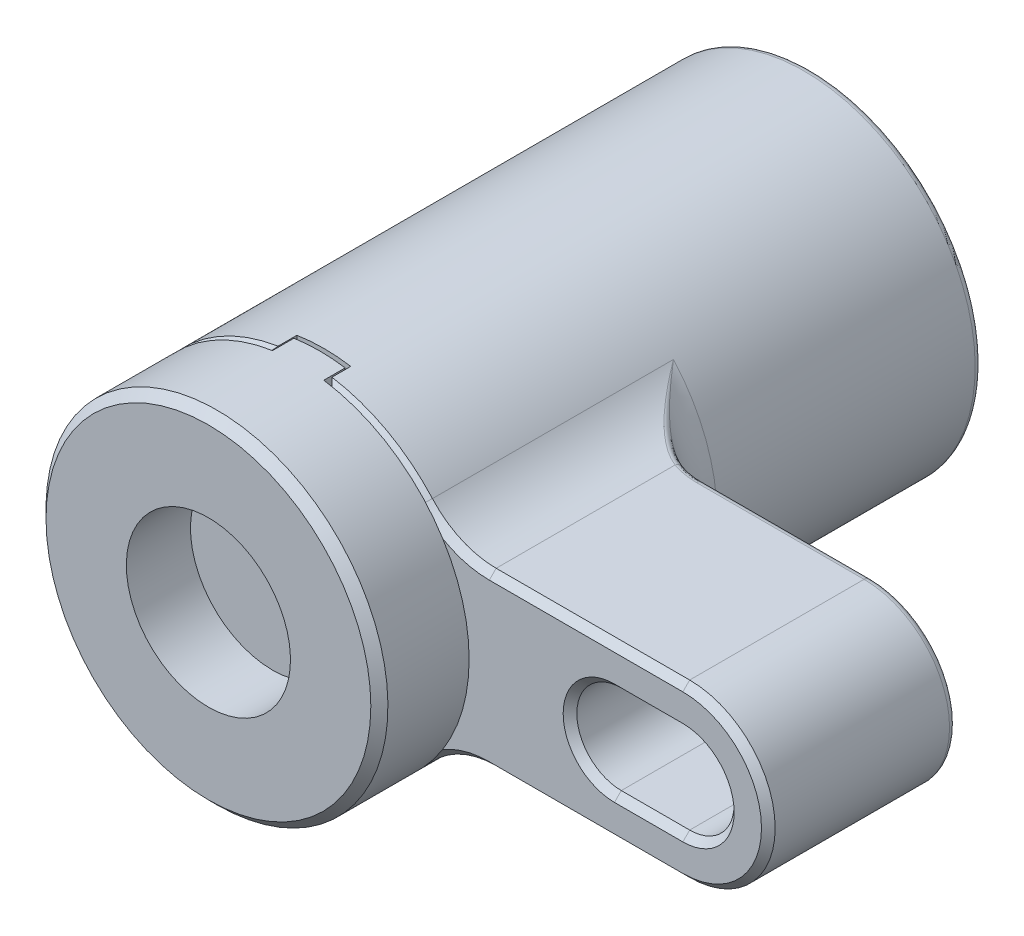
ISO-10303-21;
HEADER;
FILE_DESCRIPTION(('STEP AP214'),'2;1');
FILE_NAME('part.step','',(''),(''),'','','');
FILE_SCHEMA(('AUTOMOTIVE_DESIGN { 1 0 10303 214 1 1 1 1 }'));
ENDSEC;
DATA;
#1=APPLICATION_CONTEXT('core data for automotive mechanical design processes');
#2=APPLICATION_PROTOCOL_DEFINITION('international standard','automotive_design',2000,#1);
#3=PRODUCT_CONTEXT('',#1,'mechanical');
#4=PRODUCT('Part','Part','',(#3));
#5=PRODUCT_RELATED_PRODUCT_CATEGORY('part','',(#4));
#6=PRODUCT_DEFINITION_FORMATION('','',#4);
#7=PRODUCT_DEFINITION_CONTEXT('part definition',#1,'design');
#8=PRODUCT_DEFINITION('design','',#6,#7);
#9=PRODUCT_DEFINITION_SHAPE('','',#8);
#10=(LENGTH_UNIT() NAMED_UNIT(*) SI_UNIT(.MILLI.,.METRE.));
#11=(NAMED_UNIT(*) PLANE_ANGLE_UNIT() SI_UNIT($,.RADIAN.));
#12=(NAMED_UNIT(*) SI_UNIT($,.STERADIAN.) SOLID_ANGLE_UNIT());
#13=UNCERTAINTY_MEASURE_WITH_UNIT(LENGTH_MEASURE(1.E-05),#10,'distance_accuracy_value','');
#14=(GEOMETRIC_REPRESENTATION_CONTEXT(3) GLOBAL_UNCERTAINTY_ASSIGNED_CONTEXT((#13)) GLOBAL_UNIT_ASSIGNED_CONTEXT((#10,
#11,#12)) REPRESENTATION_CONTEXT('',''));
#15=CARTESIAN_POINT('',(0.,0.,0.));
#16=DIRECTION('',(0.,0.,1.));
#17=DIRECTION('',(1.,0.,0.));
#18=AXIS2_PLACEMENT_3D('',#15,#16,#17);
#19=CARTESIAN_POINT('',(3.14999999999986,19.7503797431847,57.));
#20=DIRECTION('',(1.,0.,0.));
#21=DIRECTION('',(0.,-1.,0.));
#22=AXIS2_PLACEMENT_3D('',#19,#20,#21);
#23=PLANE('',#22);
#24=DIRECTION('',(0.,0.,-1.));
#25=VECTOR('',#24,1.);
#26=CARTESIAN_POINT('',(3.14999999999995,6.88187363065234,20.0377427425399));
#27=LINE('',#26,#25);
#28=CARTESIAN_POINT('',(3.14999999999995,6.88187363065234,57.));
#29=VERTEX_POINT('',#28);
#30=CARTESIAN_POINT('',(3.14999999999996,6.88187363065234,59.2));
#31=VERTEX_POINT('',#30);
#32=EDGE_CURVE('E1515',#29,#31,#27,.F.);
#33=ORIENTED_EDGE('',*,*,#32,.T.);
#34=DIRECTION('',(0.,-1.,0.));
#35=VECTOR('',#34,1.);
#36=CARTESIAN_POINT('',(3.14999999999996,5.96992462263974,59.2));
#37=LINE('',#36,#35);
#38=CARTESIAN_POINT('',(3.14999999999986,19.7503797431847,59.2));
#39=VERTEX_POINT('',#38);
#40=EDGE_CURVE('E396',#39,#31,#37,.T.);
#41=ORIENTED_EDGE('',*,*,#40,.F.);
#42=DIRECTION('',(0.,0.,1.));
#43=VECTOR('',#42,1.);
#44=CARTESIAN_POINT('',(3.14999999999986,19.7503797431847,57.));
#45=LINE('',#44,#43);
#46=CARTESIAN_POINT('',(3.14999999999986,19.7503797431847,57.));
#47=VERTEX_POINT('',#46);
#48=EDGE_CURVE('E962',#47,#39,#45,.T.);
#49=ORIENTED_EDGE('',*,*,#48,.F.);
#50=DIRECTION('',(0.,-1.,0.));
#51=VECTOR('',#50,1.);
#52=CARTESIAN_POINT('',(3.14999999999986,19.7503797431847,57.));
#53=LINE('',#52,#51);
#54=EDGE_CURVE('E966',#47,#29,#53,.T.);
#55=ORIENTED_EDGE('',*,*,#54,.T.);
#56=EDGE_LOOP('',(#33,#41,#49,#55));
#57=FACE_BOUND('',#56,.T.);
#58=ADVANCED_FACE('F14',(#57),#23,.F.);
#59=CARTESIAN_POINT('',(-3.15000000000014,19.7503797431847,57.));
#60=DIRECTION('',(-1.,0.,0.));
#61=DIRECTION('',(0.,1.,0.));
#62=AXIS2_PLACEMENT_3D('',#59,#60,#61);
#63=PLANE('',#62);
#64=DIRECTION('',(0.,0.,-1.));
#65=VECTOR('',#64,1.);
#66=CARTESIAN_POINT('',(-3.15000000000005,6.8818736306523,20.0377427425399));
#67=LINE('',#66,#65);
#68=CARTESIAN_POINT('',(-3.15000000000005,6.8818736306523,59.2));
#69=VERTEX_POINT('',#68);
#70=CARTESIAN_POINT('',(-3.15000000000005,6.8818736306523,57.));
#71=VERTEX_POINT('',#70);
#72=EDGE_CURVE('E1509',#69,#71,#67,.T.);
#73=ORIENTED_EDGE('',*,*,#72,.T.);
#74=DIRECTION('',(0.,1.,0.));
#75=VECTOR('',#74,1.);
#76=CARTESIAN_POINT('',(-3.15000000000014,19.7503797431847,57.));
#77=LINE('',#76,#75);
#78=CARTESIAN_POINT('',(-3.15000000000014,19.7503797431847,57.));
#79=VERTEX_POINT('',#78);
#80=EDGE_CURVE('E973',#71,#79,#77,.T.);
#81=ORIENTED_EDGE('',*,*,#80,.T.);
#82=DIRECTION('',(0.,0.,1.));
#83=VECTOR('',#82,1.);
#84=CARTESIAN_POINT('',(-3.15000000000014,19.7503797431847,57.));
#85=LINE('',#84,#83);
#86=CARTESIAN_POINT('',(-3.15000000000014,19.7503797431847,59.2));
#87=VERTEX_POINT('',#86);
#88=EDGE_CURVE('E963',#79,#87,#85,.T.);
#89=ORIENTED_EDGE('',*,*,#88,.T.);
#90=DIRECTION('',(0.,1.,0.));
#91=VECTOR('',#90,1.);
#92=CARTESIAN_POINT('',(-3.15000000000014,19.7503797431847,59.2));
#93=LINE('',#92,#91);
#94=EDGE_CURVE('E399',#69,#87,#93,.T.);
#95=ORIENTED_EDGE('',*,*,#94,.F.);
#96=EDGE_LOOP('',(#73,#81,#89,#95));
#97=FACE_BOUND('',#96,.T.);
#98=ADVANCED_FACE('F574',(#97),#63,.F.);
#99=CARTESIAN_POINT('',(-3.15,-19.7503797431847,57.));
#100=DIRECTION('',(-1.,0.,0.));
#101=DIRECTION('',(0.,1.,0.));
#102=AXIS2_PLACEMENT_3D('',#99,#100,#101);
#103=PLANE('',#102);
#104=DIRECTION('',(0.,0.,-1.));
#105=VECTOR('',#104,1.);
#106=CARTESIAN_POINT('',(-3.15,-6.88187363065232,20.0377427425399));
#107=LINE('',#106,#105);
#108=CARTESIAN_POINT('',(-3.15,-6.88187363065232,57.));
#109=VERTEX_POINT('',#108);
#110=CARTESIAN_POINT('',(-3.15,-6.88187363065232,59.2));
#111=VERTEX_POINT('',#110);
#112=EDGE_CURVE('E1525',#109,#111,#107,.F.);
#113=ORIENTED_EDGE('',*,*,#112,.T.);
#114=DIRECTION('',(0.,1.,0.));
#115=VECTOR('',#114,1.);
#116=CARTESIAN_POINT('',(-3.15,-5.96992462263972,59.2));
#117=LINE('',#116,#115);
#118=CARTESIAN_POINT('',(-3.15,-19.7503797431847,59.2));
#119=VERTEX_POINT('',#118);
#120=EDGE_CURVE('E414',#119,#111,#117,.T.);
#121=ORIENTED_EDGE('',*,*,#120,.F.);
#122=DIRECTION('',(0.,0.,1.));
#123=VECTOR('',#122,1.);
#124=CARTESIAN_POINT('',(-3.15,-19.7503797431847,57.));
#125=LINE('',#124,#123);
#126=CARTESIAN_POINT('',(-3.15,-19.7503797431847,57.));
#127=VERTEX_POINT('',#126);
#128=EDGE_CURVE('E941',#127,#119,#125,.T.);
#129=ORIENTED_EDGE('',*,*,#128,.F.);
#130=DIRECTION('',(0.,1.,0.));
#131=VECTOR('',#130,1.);
#132=CARTESIAN_POINT('',(-3.15,-19.7503797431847,57.));
#133=LINE('',#132,#131);
#134=EDGE_CURVE('E952',#127,#109,#133,.T.);
#135=ORIENTED_EDGE('',*,*,#134,.T.);
#136=EDGE_LOOP('',(#113,#121,#129,#135));
#137=FACE_BOUND('',#136,.T.);
#138=ADVANCED_FACE('F581',(#137),#103,.F.);
#139=CARTESIAN_POINT('',(3.15,-19.7503797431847,57.));
#140=DIRECTION('',(1.,0.,0.));
#141=DIRECTION('',(0.,-1.,0.));
#142=AXIS2_PLACEMENT_3D('',#139,#140,#141);
#143=PLANE('',#142);
#144=DIRECTION('',(0.,0.,-1.));
#145=VECTOR('',#144,1.);
#146=CARTESIAN_POINT('',(3.15,-6.88187363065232,20.0377427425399));
#147=LINE('',#146,#145);
#148=CARTESIAN_POINT('',(3.15,-6.88187363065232,59.2));
#149=VERTEX_POINT('',#148);
#150=CARTESIAN_POINT('',(3.15,-6.88187363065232,57.));
#151=VERTEX_POINT('',#150);
#152=EDGE_CURVE('E386',#149,#151,#147,.T.);
#153=ORIENTED_EDGE('',*,*,#152,.T.);
#154=DIRECTION('',(0.,-1.,0.));
#155=VECTOR('',#154,1.);
#156=CARTESIAN_POINT('',(3.15,-19.7503797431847,57.));
#157=LINE('',#156,#155);
#158=CARTESIAN_POINT('',(3.15,-19.7503797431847,57.));
#159=VERTEX_POINT('',#158);
#160=EDGE_CURVE('E959',#151,#159,#157,.T.);
#161=ORIENTED_EDGE('',*,*,#160,.T.);
#162=DIRECTION('',(0.,0.,1.));
#163=VECTOR('',#162,1.);
#164=CARTESIAN_POINT('',(3.15,-19.7503797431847,57.));
#165=LINE('',#164,#163);
#166=CARTESIAN_POINT('',(3.15,-19.7503797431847,59.2));
#167=VERTEX_POINT('',#166);
#168=EDGE_CURVE('E949',#159,#167,#165,.T.);
#169=ORIENTED_EDGE('',*,*,#168,.T.);
#170=DIRECTION('',(0.,-1.,0.));
#171=VECTOR('',#170,1.);
#172=CARTESIAN_POINT('',(3.15,-19.7503797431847,59.2));
#173=LINE('',#172,#171);
#174=EDGE_CURVE('E417',#149,#167,#173,.T.);
#175=ORIENTED_EDGE('',*,*,#174,.F.);
#176=EDGE_LOOP('',(#153,#161,#169,#175));
#177=FACE_BOUND('',#176,.T.);
#178=ADVANCED_FACE('F554',(#177),#143,.F.);
#179=CARTESIAN_POINT('',(3.,-19.7737199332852,57.5));
#180=DIRECTION('',(-1.,0.,0.));
#181=DIRECTION('',(0.,1.,0.));
#182=AXIS2_PLACEMENT_3D('',#179,#180,#181);
#183=PLANE('',#182);
#184=DIRECTION('',(0.,0.,-1.));
#185=VECTOR('',#184,1.);
#186=CARTESIAN_POINT('',(3.,-6.94857429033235,20.0377427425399));
#187=LINE('',#186,#185);
#188=CARTESIAN_POINT('',(3.,-6.94857429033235,57.5));
#189=VERTEX_POINT('',#188);
#190=CARTESIAN_POINT('',(3.,-6.94857429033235,60.));
#191=VERTEX_POINT('',#190);
#192=EDGE_CURVE('E1539',#189,#191,#187,.F.);
#193=ORIENTED_EDGE('',*,*,#192,.T.);
#194=DIRECTION('',(0.,1.,0.));
#195=VECTOR('',#194,1.);
#196=CARTESIAN_POINT('',(3.,-19.7737199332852,60.));
#197=LINE('',#196,#195);
#198=CARTESIAN_POINT('',(3.,-19.7737199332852,60.));
#199=VERTEX_POINT('',#198);
#200=EDGE_CURVE('E378',#199,#191,#197,.T.);
#201=ORIENTED_EDGE('',*,*,#200,.F.);
#202=DIRECTION('',(0.,0.,1.));
#203=VECTOR('',#202,1.);
#204=CARTESIAN_POINT('',(3.,-19.7737199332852,57.5));
#205=LINE('',#204,#203);
#206=CARTESIAN_POINT('',(3.,-19.7737199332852,57.5));
#207=VERTEX_POINT('',#206);
#208=EDGE_CURVE('E1117',#207,#199,#205,.T.);
#209=ORIENTED_EDGE('',*,*,#208,.F.);
#210=DIRECTION('',(0.,1.,0.));
#211=VECTOR('',#210,1.);
#212=CARTESIAN_POINT('',(3.,-19.7737199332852,57.5));
#213=LINE('',#212,#211);
#214=EDGE_CURVE('E1064',#207,#189,#213,.T.);
#215=ORIENTED_EDGE('',*,*,#214,.T.);
#216=EDGE_LOOP('',(#193,#201,#209,#215));
#217=FACE_BOUND('',#216,.T.);
#218=ADVANCED_FACE('F551',(#217),#183,.F.);
#219=DIRECTION('',(0.,0.,-1.));
#220=VECTOR('',#219,1.);
#221=CARTESIAN_POINT('',(3.,6.94857429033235,20.0377427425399));
#222=LINE('',#221,#220);
#223=CARTESIAN_POINT('',(3.,6.94857429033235,60.));
#224=VERTEX_POINT('',#223);
#225=CARTESIAN_POINT('',(3.,6.94857429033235,57.5));
#226=VERTEX_POINT('',#225);
#227=EDGE_CURVE('E1557',#224,#226,#222,.T.);
#228=ORIENTED_EDGE('',*,*,#227,.T.);
#229=CARTESIAN_POINT('',(3.,19.7737199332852,57.5));
#230=VERTEX_POINT('',#229);
#231=EDGE_CURVE('E1062',#226,#230,#213,.T.);
#232=ORIENTED_EDGE('',*,*,#231,.T.);
#233=DIRECTION('',(0.,0.,1.));
#234=VECTOR('',#233,1.);
#235=CARTESIAN_POINT('',(3.,19.7737199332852,57.5));
#236=LINE('',#235,#234);
#237=CARTESIAN_POINT('',(3.,19.7737199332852,60.));
#238=VERTEX_POINT('',#237);
#239=EDGE_CURVE('E1104',#230,#238,#236,.T.);
#240=ORIENTED_EDGE('',*,*,#239,.T.);
#241=EDGE_CURVE('E1058',#224,#238,#197,.T.);
#242=ORIENTED_EDGE('',*,*,#241,.F.);
#243=EDGE_LOOP('',(#228,#232,#240,#242));
#244=FACE_BOUND('',#243,.T.);
#245=ADVANCED_FACE('F549',(#244),#183,.F.);
#246=CARTESIAN_POINT('',(-3.,-19.7737199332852,57.5));
#247=DIRECTION('',(1.,0.,0.));
#248=DIRECTION('',(0.,-1.,0.));
#249=AXIS2_PLACEMENT_3D('',#246,#247,#248);
#250=PLANE('',#249);
#251=DIRECTION('',(0.,0.,-1.));
#252=VECTOR('',#251,1.);
#253=CARTESIAN_POINT('',(-3.,-6.94857429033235,20.0377427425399));
#254=LINE('',#253,#252);
#255=CARTESIAN_POINT('',(-3.,-6.94857429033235,60.));
#256=VERTEX_POINT('',#255);
#257=CARTESIAN_POINT('',(-3.,-6.94857429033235,57.5));
#258=VERTEX_POINT('',#257);
#259=EDGE_CURVE('E1529',#256,#258,#254,.T.);
#260=ORIENTED_EDGE('',*,*,#259,.T.);
#261=DIRECTION('',(0.,-1.,0.));
#262=VECTOR('',#261,1.);
#263=CARTESIAN_POINT('',(-3.,-19.7737199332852,57.5));
#264=LINE('',#263,#262);
#265=CARTESIAN_POINT('',(-3.,-19.7737199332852,57.5));
#266=VERTEX_POINT('',#265);
#267=EDGE_CURVE('E1069',#258,#266,#264,.T.);
#268=ORIENTED_EDGE('',*,*,#267,.T.);
#269=DIRECTION('',(0.,0.,1.));
#270=VECTOR('',#269,1.);
#271=CARTESIAN_POINT('',(-3.,-19.7737199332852,57.5));
#272=LINE('',#271,#270);
#273=CARTESIAN_POINT('',(-3.,-19.7737199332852,60.));
#274=VERTEX_POINT('',#273);
#275=EDGE_CURVE('E1073',#266,#274,#272,.T.);
#276=ORIENTED_EDGE('',*,*,#275,.T.);
#277=DIRECTION('',(0.,-1.,0.));
#278=VECTOR('',#277,1.);
#279=CARTESIAN_POINT('',(-3.,-19.7737199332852,60.));
#280=LINE('',#279,#278);
#281=EDGE_CURVE('E1085',#256,#274,#280,.T.);
#282=ORIENTED_EDGE('',*,*,#281,.F.);
#283=EDGE_LOOP('',(#260,#268,#276,#282));
#284=FACE_BOUND('',#283,.T.);
#285=ADVANCED_FACE('F545',(#284),#250,.F.);
#286=DIRECTION('',(0.,0.,-1.));
#287=VECTOR('',#286,1.);
#288=CARTESIAN_POINT('',(-3.,6.94857429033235,20.0377427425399));
#289=LINE('',#288,#287);
#290=CARTESIAN_POINT('',(-3.,6.94857429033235,57.5));
#291=VERTEX_POINT('',#290);
#292=CARTESIAN_POINT('',(-3.,6.94857429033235,60.));
#293=VERTEX_POINT('',#292);
#294=EDGE_CURVE('E1507',#291,#293,#289,.F.);
#295=ORIENTED_EDGE('',*,*,#294,.T.);
#296=CARTESIAN_POINT('',(-3.,19.7737199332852,60.));
#297=VERTEX_POINT('',#296);
#298=EDGE_CURVE('E1063',#297,#293,#280,.T.);
#299=ORIENTED_EDGE('',*,*,#298,.F.);
#300=DIRECTION('',(0.,0.,1.));
#301=VECTOR('',#300,1.);
#302=CARTESIAN_POINT('',(-3.,19.7737199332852,57.5));
#303=LINE('',#302,#301);
#304=CARTESIAN_POINT('',(-3.,19.7737199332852,57.5));
#305=VERTEX_POINT('',#304);
#306=EDGE_CURVE('E1099',#305,#297,#303,.T.);
#307=ORIENTED_EDGE('',*,*,#306,.F.);
#308=EDGE_CURVE('E1070',#305,#291,#264,.T.);
#309=ORIENTED_EDGE('',*,*,#308,.T.);
#310=EDGE_LOOP('',(#295,#299,#307,#309));
#311=FACE_BOUND('',#310,.T.);
#312=ADVANCED_FACE('F548',(#311),#250,.F.);
#313=CARTESIAN_POINT('',(0.,0.,60.));
#314=DIRECTION('',(0.,0.,-1.));
#315=DIRECTION('',(0.,1.,0.));
#316=AXIS2_PLACEMENT_3D('',#313,#314,#315);
#317=CYLINDRICAL_SURFACE('',#316,20.);
#318=CARTESIAN_POINT('',(0.,0.,47.25));
#319=DIRECTION('',(0.,0.,1.));
#320=DIRECTION('',(0.,1.,0.));
#321=AXIS2_PLACEMENT_3D('',#318,#319,#320);
#322=CIRCLE('',#321,20.);
#323=CARTESIAN_POINT('',(-19.9436706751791,1.5,47.25));
#324=VERTEX_POINT('',#323);
#325=CARTESIAN_POINT('',(-19.0787840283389,-6.,47.25));
#326=VERTEX_POINT('',#325);
#327=EDGE_CURVE('E1113',#324,#326,#322,.T.);
#328=ORIENTED_EDGE('',*,*,#327,.T.);
#329=DIRECTION('',(0.,0.,-1.));
#330=VECTOR('',#329,1.);
#331=CARTESIAN_POINT('',(-19.0787840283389,-6.,60.));
#332=LINE('',#331,#330);
#333=CARTESIAN_POINT('',(-19.0787840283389,-6.,50.75));
#334=VERTEX_POINT('',#333);
#335=EDGE_CURVE('E1198',#334,#326,#332,.T.);
#336=ORIENTED_EDGE('',*,*,#335,.F.);
#337=CARTESIAN_POINT('',(0.,0.,50.75));
#338=DIRECTION('',(0.,0.,-1.));
#339=DIRECTION('',(0.,-1.,0.));
#340=AXIS2_PLACEMENT_3D('',#337,#338,#339);
#341=CIRCLE('',#340,20.);
#342=CARTESIAN_POINT('',(-19.9436706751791,1.5,50.75));
#343=VERTEX_POINT('',#342);
#344=EDGE_CURVE('E1188',#334,#343,#341,.T.);
#345=ORIENTED_EDGE('',*,*,#344,.T.);
#346=DIRECTION('',(0.,0.,-1.));
#347=VECTOR('',#346,1.);
#348=CARTESIAN_POINT('',(-19.9436706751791,1.5,60.));
#349=LINE('',#348,#347);
#350=CARTESIAN_POINT('',(-19.9436706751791,1.5,51.75));
#351=VERTEX_POINT('',#350);
#352=EDGE_CURVE('E1183',#351,#343,#349,.T.);
#353=ORIENTED_EDGE('',*,*,#352,.F.);
#354=CARTESIAN_POINT('',(-19.9436706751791,1.50000000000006,51.75));
#355=CARTESIAN_POINT('',(-19.9355258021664,1.60829263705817,51.6874777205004));
#356=CARTESIAN_POINT('',(-19.9264975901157,1.71653594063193,51.6249851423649));
#357=CARTESIAN_POINT('',(-19.9071206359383,1.92803302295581,51.5028802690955));
#358=CARTESIAN_POINT('',(-19.8968495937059,2.0312921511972,51.4432649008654));
#359=CARTESIAN_POINT('',(-19.8752184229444,2.2328173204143,51.3269141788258));
#360=CARTESIAN_POINT('',(-19.8639324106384,2.33108938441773,51.2701754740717));
#361=CARTESIAN_POINT('',(-19.840491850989,2.52264299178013,51.1595788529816));
#362=CARTESIAN_POINT('',(-19.8284078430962,2.61593102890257,51.1057172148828));
#363=CARTESIAN_POINT('',(-19.8012909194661,2.81427340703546,50.9912035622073));
#364=CARTESIAN_POINT('',(-19.7860784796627,2.91930955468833,50.9305624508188));
#365=CARTESIAN_POINT('',(-19.7544460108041,3.12609637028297,50.811176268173));
#366=CARTESIAN_POINT('',(-19.738074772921,3.22785265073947,50.752427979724));
#367=CARTESIAN_POINT('',(-19.7042704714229,3.42807789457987,50.6368277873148));
#368=CARTESIAN_POINT('',(-19.6868847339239,3.52655287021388,50.5799724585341));
#369=CARTESIAN_POINT('',(-19.6511927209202,3.72021689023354,50.4681585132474));
#370=CARTESIAN_POINT('',(-19.6329323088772,3.81541228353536,50.4131962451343));
#371=CARTESIAN_POINT('',(-19.5934774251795,4.01330671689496,50.2989415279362));
#372=CARTESIAN_POINT('',(-19.5721651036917,4.11598822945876,50.2396593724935));
#373=CARTESIAN_POINT('',(-19.5283957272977,4.31882937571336,50.1225505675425));
#374=CARTESIAN_POINT('',(-19.5059741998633,4.41899476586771,50.0647206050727));
#375=CARTESIAN_POINT('',(-19.4600928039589,4.61680224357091,49.9505163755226));
#376=CARTESIAN_POINT('',(-19.4366676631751,4.71445038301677,49.894138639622));
#377=CARTESIAN_POINT('',(-19.3888829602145,4.90722432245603,49.7828391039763));
#378=CARTESIAN_POINT('',(-19.3645573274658,5.00235643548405,49.7279136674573));
#379=CARTESIAN_POINT('',(-19.3130437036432,5.19780093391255,49.615073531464));
#380=CARTESIAN_POINT('',(-19.2857715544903,5.29809673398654,49.5571685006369));
#381=CARTESIAN_POINT('',(-19.2301316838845,5.49658719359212,49.44257120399));
#382=CARTESIAN_POINT('',(-19.2017917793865,5.59478770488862,49.3858755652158));
#383=CARTESIAN_POINT('',(-19.1440999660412,5.78908639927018,49.2736971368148));
#384=CARTESIAN_POINT('',(-19.1147753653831,5.8851906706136,49.2182108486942));
#385=CARTESIAN_POINT('',(-19.055196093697,6.07529770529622,49.1084514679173));
#386=CARTESIAN_POINT('',(-19.0249682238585,6.16930676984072,49.0541747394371));
#387=CARTESIAN_POINT('',(-18.9940275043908,6.26313972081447,49.));
#388=B_SPLINE_CURVE_WITH_KNOTS('',3,(#354,#355,#356,#357,#358,#359,#360,#361,#362,#363,#364,
#365,#366,#367,#368,#369,#370,#371,#372,#373,#374,#375,#376,#377,#378,#379,#380,#381,#382,#383,
#384,#385,#386,#387),.UNSPECIFIED.,.F.,.F.,(4,2,2,2,2,2,2,2,2,2,2,2,2,2,2,2,4),(0.,
0.375927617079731,0.734939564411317,1.07703596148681,1.40221695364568,1.76890940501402,
2.12479685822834,2.46987970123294,2.80415836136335,3.16554504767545,3.51897633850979,
3.86445298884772,4.20197580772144,4.55890152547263,4.90953024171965,5.25386318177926,
5.59190163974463),.UNSPECIFIED.);
#389=CARTESIAN_POINT('',(-18.9940275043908,6.2631397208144,49.));
#390=VERTEX_POINT('',#389);
#391=EDGE_CURVE('E1471',#351,#390,#388,.T.);
#392=ORIENTED_EDGE('',*,*,#391,.T.);
#393=CARTESIAN_POINT('',(-18.9940275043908,6.26313972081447,49.));
#394=CARTESIAN_POINT('',(-19.0249666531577,6.16931153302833,48.9458280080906));
#395=CARTESIAN_POINT('',(-19.0551930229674,6.07530725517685,48.8915540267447));
#396=CARTESIAN_POINT('',(-19.1147704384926,5.88520664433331,48.781798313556));
#397=CARTESIAN_POINT('',(-19.144094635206,5.78910399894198,48.7263129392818));
#398=CARTESIAN_POINT('',(-19.2017866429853,5.59480536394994,48.6141345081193));
#399=CARTESIAN_POINT('',(-19.2301270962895,5.49660327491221,48.5574379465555));
#400=CARTESIAN_POINT('',(-19.2857689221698,5.29810641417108,48.4428369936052));
#401=CARTESIAN_POINT('',(-19.3130424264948,5.19780577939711,48.3849292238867));
#402=CARTESIAN_POINT('',(-19.3645545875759,5.00236683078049,48.2720923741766));
#403=CARTESIAN_POINT('',(-19.388877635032,4.90724514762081,48.2171729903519));
#404=CARTESIAN_POINT('',(-19.4366592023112,4.71448518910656,48.1058815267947));
#405=CARTESIAN_POINT('',(-19.4600836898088,4.61684058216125,48.0495057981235));
#406=CARTESIAN_POINT('',(-19.5059655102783,4.41903320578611,47.9353015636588));
#407=CARTESIAN_POINT('',(-19.5283880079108,4.31886436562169,47.8774695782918));
#408=CARTESIAN_POINT('',(-19.5721607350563,4.11600927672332,47.7603527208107));
#409=CARTESIAN_POINT('',(-19.5934753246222,4.01331725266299,47.7010645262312));
#410=CARTESIAN_POINT('',(-19.6329302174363,3.81542277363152,47.5868098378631));
#411=CARTESIAN_POINT('',(-19.6511886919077,3.72023789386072,47.5318536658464));
#412=CARTESIAN_POINT('',(-19.6868784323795,3.52658794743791,47.4200478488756));
#413=CARTESIAN_POINT('',(-19.704263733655,3.42811651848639,47.3631945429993));
#414=CARTESIAN_POINT('',(-19.7380684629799,3.22789134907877,47.2475943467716));
#415=CARTESIAN_POINT('',(-19.7544404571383,3.12613158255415,47.1888440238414));
#416=CARTESIAN_POINT('',(-19.7860754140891,2.91933072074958,47.0694497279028));
#417=CARTESIAN_POINT('',(-19.8012894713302,2.81428399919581,47.0088025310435));
#418=CARTESIAN_POINT('',(-19.8284069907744,2.61593726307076,46.8942864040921));
#419=CARTESIAN_POINT('',(-19.8404902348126,2.52265546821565,46.8404283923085));
#420=CARTESIAN_POINT('',(-19.8639299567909,2.33111020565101,46.7298366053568));
#421=CARTESIAN_POINT('',(-19.8752158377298,2.23284023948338,46.6730991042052));
#422=CARTESIAN_POINT('',(-19.8968472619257,2.03131509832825,46.5567483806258));
#423=CARTESIAN_POINT('',(-19.9071186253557,1.92805389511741,46.4971318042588));
#424=CARTESIAN_POINT('',(-19.926496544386,1.71654847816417,46.3750221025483));
#425=CARTESIAN_POINT('',(-19.9355253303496,1.60829890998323,46.3125259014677));
#426=CARTESIAN_POINT('',(-19.9436706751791,1.50000000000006,46.25));
#427=B_SPLINE_CURVE_WITH_KNOTS('',3,(#393,#394,#395,#396,#397,#398,#399,#400,#401,#402,#403,
#404,#405,#406,#407,#408,#409,#410,#411,#412,#413,#414,#415,#416,#417,#418,#419,#420,#421,#422,
#423,#424,#425,#426),.UNSPECIFIED.,.F.,.F.,(4,2,2,2,2,2,2,2,2,2,2,2,2,2,2,2,4),(0.,
0.338021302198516,0.682348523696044,1.03298295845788,1.38992583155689,1.72741165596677,
2.07287597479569,2.42631959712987,2.78774327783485,3.12198502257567,3.46705556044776,
3.82295531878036,4.18968468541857,4.51484390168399,4.85693304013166,5.21595224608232,
5.59190163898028),.UNSPECIFIED.);
#428=CARTESIAN_POINT('',(-19.9436706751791,1.5,46.25));
#429=VERTEX_POINT('',#428);
#430=EDGE_CURVE('E1441',#390,#429,#427,.T.);
#431=ORIENTED_EDGE('',*,*,#430,.T.);
#432=DIRECTION('',(0.,0.,-1.));
#433=VECTOR('',#432,1.);
#434=CARTESIAN_POINT('',(-19.9436706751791,1.5,60.));
#435=LINE('',#434,#433);
#436=EDGE_CURVE('E1421',#324,#429,#435,.T.);
#437=ORIENTED_EDGE('',*,*,#436,.F.);
#438=EDGE_LOOP('',(#328,#336,#345,#353,#392,#431,#437));
#439=FACE_BOUND('',#438,.T.);
#440=ADVANCED_FACE('F1157',(#439),#317,.T.);
#441=CARTESIAN_POINT('',(-19.6436706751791,1.5,60.));
#442=DIRECTION('',(0.,-1.,0.));
#443=DIRECTION('',(-1.,0.,0.));
#444=AXIS2_PLACEMENT_3D('',#441,#442,#443);
#445=PLANE('',#444);
#446=ORIENTED_EDGE('',*,*,#352,.T.);
#447=DIRECTION('',(-1.,0.,0.));
#448=VECTOR('',#447,1.);
#449=CARTESIAN_POINT('',(-19.6436706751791,1.5,50.75));
#450=LINE('',#449,#448);
#451=CARTESIAN_POINT('',(-19.6436706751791,1.5,50.75));
#452=VERTEX_POINT('',#451);
#453=EDGE_CURVE('E1176',#452,#343,#450,.T.);
#454=ORIENTED_EDGE('',*,*,#453,.F.);
#455=DIRECTION('',(0.,0.,-1.));
#456=VECTOR('',#455,1.);
#457=CARTESIAN_POINT('',(-19.6436706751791,1.5,60.));
#458=LINE('',#457,#456);
#459=CARTESIAN_POINT('',(-19.6436706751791,1.5,51.75));
#460=VERTEX_POINT('',#459);
#461=EDGE_CURVE('E1476',#460,#452,#458,.T.);
#462=ORIENTED_EDGE('',*,*,#461,.F.);
#463=DIRECTION('',(-1.,0.,0.));
#464=VECTOR('',#463,1.);
#465=CARTESIAN_POINT('',(-19.6436706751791,1.5,51.75));
#466=LINE('',#465,#464);
#467=EDGE_CURVE('E1473',#460,#351,#466,.T.);
#468=ORIENTED_EDGE('',*,*,#467,.T.);
#469=EDGE_LOOP('',(#446,#454,#462,#468));
#470=FACE_BOUND('',#469,.T.);
#471=ADVANCED_FACE('F1154',(#470),#445,.T.);
#472=CARTESIAN_POINT('',(-19.6436706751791,1.5,50.75));
#473=DIRECTION('',(0.,0.,-1.));
#474=DIRECTION('',(0.,1.,0.));
#475=AXIS2_PLACEMENT_3D('',#472,#473,#474);
#476=PLANE('',#475);
#477=ORIENTED_EDGE('',*,*,#344,.F.);
#478=DIRECTION('',(-1.,0.,0.));
#479=VECTOR('',#478,1.);
#480=CARTESIAN_POINT('',(-18.7787840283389,-6.,50.75));
#481=LINE('',#480,#479);
#482=CARTESIAN_POINT('',(-18.7787840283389,-6.,50.75));
#483=VERTEX_POINT('',#482);
#484=EDGE_CURVE('E1196',#483,#334,#481,.T.);
#485=ORIENTED_EDGE('',*,*,#484,.F.);
#486=CARTESIAN_POINT('',(0.3,0.,50.75));
#487=DIRECTION('',(0.,0.,-1.));
#488=DIRECTION('',(0.,-1.,0.));
#489=AXIS2_PLACEMENT_3D('',#486,#487,#488);
#490=CIRCLE('',#489,20.);
#491=EDGE_CURVE('E1184',#483,#452,#490,.T.);
#492=ORIENTED_EDGE('',*,*,#491,.T.);
#493=ORIENTED_EDGE('',*,*,#453,.T.);
#494=EDGE_LOOP('',(#477,#485,#492,#493));
#495=FACE_BOUND('',#494,.T.);
#496=ADVANCED_FACE('F1150',(#495),#476,.F.);
#497=CARTESIAN_POINT('',(-18.7787840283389,-6.,60.));
#498=DIRECTION('',(0.,-1.,0.));
#499=DIRECTION('',(-1.,0.,0.));
#500=AXIS2_PLACEMENT_3D('',#497,#498,#499);
#501=PLANE('',#500);
#502=ORIENTED_EDGE('',*,*,#335,.T.);
#503=DIRECTION('',(-1.,0.,0.));
#504=VECTOR('',#503,1.);
#505=CARTESIAN_POINT('',(-18.7787840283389,-6.,47.25));
#506=LINE('',#505,#504);
#507=CARTESIAN_POINT('',(-18.7787840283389,-6.,47.25));
#508=VERTEX_POINT('',#507);
#509=EDGE_CURVE('E1207',#508,#326,#506,.T.);
#510=ORIENTED_EDGE('',*,*,#509,.F.);
#511=DIRECTION('',(0.,0.,-1.));
#512=VECTOR('',#511,1.);
#513=CARTESIAN_POINT('',(-18.7787840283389,-6.,60.));
#514=LINE('',#513,#512);
#515=EDGE_CURVE('E1193',#483,#508,#514,.T.);
#516=ORIENTED_EDGE('',*,*,#515,.F.);
#517=ORIENTED_EDGE('',*,*,#484,.T.);
#518=EDGE_LOOP('',(#502,#510,#516,#517));
#519=FACE_BOUND('',#518,.T.);
#520=ADVANCED_FACE('F1146',(#519),#501,.T.);
#521=CARTESIAN_POINT('',(-18.7787840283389,-6.,47.25));
#522=DIRECTION('',(0.,0.,1.));
#523=DIRECTION('',(0.,-1.,0.));
#524=AXIS2_PLACEMENT_3D('',#521,#522,#523);
#525=PLANE('',#524);
#526=ORIENTED_EDGE('',*,*,#327,.F.);
#527=DIRECTION('',(-1.,0.,0.));
#528=VECTOR('',#527,1.);
#529=CARTESIAN_POINT('',(-19.6436706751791,1.5,47.25));
#530=LINE('',#529,#528);
#531=CARTESIAN_POINT('',(-19.6436706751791,1.5,47.25));
#532=VERTEX_POINT('',#531);
#533=EDGE_CURVE('E1215',#532,#324,#530,.T.);
#534=ORIENTED_EDGE('',*,*,#533,.F.);
#535=CARTESIAN_POINT('',(0.3,0.,47.25));
#536=DIRECTION('',(0.,0.,1.));
#537=DIRECTION('',(0.,1.,0.));
#538=AXIS2_PLACEMENT_3D('',#535,#536,#537);
#539=CIRCLE('',#538,20.);
#540=EDGE_CURVE('E1211',#532,#508,#539,.T.);
#541=ORIENTED_EDGE('',*,*,#540,.T.);
#542=ORIENTED_EDGE('',*,*,#509,.T.);
#543=EDGE_LOOP('',(#526,#534,#541,#542));
#544=FACE_BOUND('',#543,.T.);
#545=ADVANCED_FACE('F1142',(#544),#525,.F.);
#546=CARTESIAN_POINT('',(-19.6436706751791,1.5,60.));
#547=DIRECTION('',(0.,-1.,0.));
#548=DIRECTION('',(-1.,0.,0.));
#549=AXIS2_PLACEMENT_3D('',#546,#547,#548);
#550=PLANE('',#549);
#551=ORIENTED_EDGE('',*,*,#436,.T.);
#552=DIRECTION('',(-1.,0.,0.));
#553=VECTOR('',#552,1.);
#554=CARTESIAN_POINT('',(-19.6436706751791,1.5,46.25));
#555=LINE('',#554,#553);
#556=CARTESIAN_POINT('',(-19.6436706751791,1.5,46.25));
#557=VERTEX_POINT('',#556);
#558=EDGE_CURVE('E1426',#557,#429,#555,.T.);
#559=ORIENTED_EDGE('',*,*,#558,.F.);
#560=DIRECTION('',(0.,0.,-1.));
#561=VECTOR('',#560,1.);
#562=CARTESIAN_POINT('',(-19.6436706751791,1.5,60.));
#563=LINE('',#562,#561);
#564=EDGE_CURVE('E1418',#532,#557,#563,.T.);
#565=ORIENTED_EDGE('',*,*,#564,.F.);
#566=ORIENTED_EDGE('',*,*,#533,.T.);
#567=EDGE_LOOP('',(#551,#559,#565,#566));
#568=FACE_BOUND('',#567,.T.);
#569=ADVANCED_FACE('F1145',(#568),#550,.T.);
#570=CARTESIAN_POINT('',(-19.6436706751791,1.5,46.25));
#571=DIRECTION('',(0.,-0.5,0.866025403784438));
#572=DIRECTION('',(0.,-0.866025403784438,-0.5));
#573=AXIS2_PLACEMENT_3D('',#570,#571,#572);
#574=PLANE('',#573);
#575=ORIENTED_EDGE('',*,*,#430,.F.);
#576=DIRECTION('',(-1.,0.,0.));
#577=VECTOR('',#576,1.);
#578=CARTESIAN_POINT('',(-18.6940275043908,6.26313972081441,49.));
#579=LINE('',#578,#577);
#580=CARTESIAN_POINT('',(-18.6940275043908,6.2631397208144,49.));
#581=VERTEX_POINT('',#580);
#582=EDGE_CURVE('E1439',#581,#390,#579,.T.);
#583=ORIENTED_EDGE('',*,*,#582,.F.);
#584=CARTESIAN_POINT('',(-18.6940275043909,6.26313972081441,49.));
#585=CARTESIAN_POINT('',(-19.0756995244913,5.10547032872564,48.331619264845));
#586=CARTESIAN_POINT('',(-19.3139735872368,3.91050381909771,47.6417050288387));
#587=CARTESIAN_POINT('',(-19.5521549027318,2.71600244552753,46.9520593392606));
#588=CARTESIAN_POINT('',(-19.6436706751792,1.5,46.25));
#589=B_SPLINE_CURVE_WITH_KNOTS('',2,(#584,#585,#586,#587,#588),.UNSPECIFIED.,.F.,.F.,(3,2,3),
(0.,0.5,1.),.UNSPECIFIED.);
#590=EDGE_CURVE('E1436',#581,#557,#589,.T.);
#591=ORIENTED_EDGE('',*,*,#590,.T.);
#592=ORIENTED_EDGE('',*,*,#558,.T.);
#593=EDGE_LOOP('',(#575,#583,#591,#592));
#594=FACE_BOUND('',#593,.T.);
#595=ADVANCED_FACE('F785',(#594),#574,.F.);
#596=CARTESIAN_POINT('',(-18.6940275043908,6.26313972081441,49.));
#597=DIRECTION('',(0.,-0.5,-0.866025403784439));
#598=DIRECTION('',(0.,0.866025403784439,-0.5));
#599=AXIS2_PLACEMENT_3D('',#596,#597,#598);
#600=PLANE('',#599);
#601=ORIENTED_EDGE('',*,*,#391,.F.);
#602=ORIENTED_EDGE('',*,*,#467,.F.);
#603=CARTESIAN_POINT('',(-19.6436706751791,1.5,51.75));
#604=CARTESIAN_POINT('',(-19.5521907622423,2.71552596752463,51.0482157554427));
#605=CARTESIAN_POINT('',(-19.3139735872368,3.91050381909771,50.3582949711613));
#606=CARTESIAN_POINT('',(-19.0758491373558,5.10501653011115,49.6686427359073));
#607=CARTESIAN_POINT('',(-18.6940275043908,6.26313972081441,49.));
#608=B_SPLINE_CURVE_WITH_KNOTS('',2,(#603,#604,#605,#606,#607),.UNSPECIFIED.,.F.,.F.,(3,2,3),
(0.,0.5,1.),.UNSPECIFIED.);
#609=EDGE_CURVE('E1042',#460,#581,#608,.T.);
#610=ORIENTED_EDGE('',*,*,#609,.T.);
#611=ORIENTED_EDGE('',*,*,#582,.T.);
#612=EDGE_LOOP('',(#601,#602,#610,#611));
#613=FACE_BOUND('',#612,.T.);
#614=ADVANCED_FACE('F775',(#613),#600,.F.);
#615=CARTESIAN_POINT('',(45.,0.,38.8));
#616=DIRECTION('',(0.,0.,1.));
#617=DIRECTION('',(0.,-1.,0.));
#618=AXIS2_PLACEMENT_3D('',#615,#616,#617);
#619=TOROIDAL_SURFACE('',#618,9.2,0.8);
#620=CARTESIAN_POINT('',(45.,-9.2,38.8));
#621=DIRECTION('',(-1.,0.,0.));
#622=DIRECTION('',(0.,-1.,0.));
#623=AXIS2_PLACEMENT_3D('',#620,#621,#622);
#624=CIRCLE('',#623,0.8);
#625=CARTESIAN_POINT('',(45.,-9.2,38.));
#626=VERTEX_POINT('',#625);
#627=CARTESIAN_POINT('',(45.,-10.,38.8));
#628=VERTEX_POINT('',#627);
#629=EDGE_CURVE('E792',#626,#628,#624,.T.);
#630=ORIENTED_EDGE('',*,*,#629,.F.);
#631=CARTESIAN_POINT('',(45.,0.,38.));
#632=DIRECTION('',(0.,0.,-1.));
#633=DIRECTION('',(0.,-1.,0.));
#634=AXIS2_PLACEMENT_3D('',#631,#632,#633);
#635=CIRCLE('',#634,9.2);
#636=CARTESIAN_POINT('',(45.,9.2,38.));
#637=VERTEX_POINT('',#636);
#638=EDGE_CURVE('E795',#626,#637,#635,.F.);
#639=ORIENTED_EDGE('',*,*,#638,.T.);
#640=CARTESIAN_POINT('',(45.,9.2,38.8));
#641=DIRECTION('',(1.,0.,0.));
#642=DIRECTION('',(0.,1.,0.));
#643=AXIS2_PLACEMENT_3D('',#640,#641,#642);
#644=CIRCLE('',#643,0.8);
#645=CARTESIAN_POINT('',(45.,10.,38.8));
#646=VERTEX_POINT('',#645);
#647=EDGE_CURVE('E766',#637,#646,#644,.T.);
#648=ORIENTED_EDGE('',*,*,#647,.T.);
#649=CARTESIAN_POINT('',(45.,0.,38.8));
#650=DIRECTION('',(0.,0.,-1.));
#651=DIRECTION('',(0.,-1.,0.));
#652=AXIS2_PLACEMENT_3D('',#649,#650,#651);
#653=CIRCLE('',#652,10.);
#654=EDGE_CURVE('E797',#646,#628,#653,.T.);
#655=ORIENTED_EDGE('',*,*,#654,.T.);
#656=EDGE_LOOP('',(#630,#639,#648,#655));
#657=FACE_BOUND('',#656,.T.);
#658=ADVANCED_FACE('F772',(#657),#619,.T.);
#659=CARTESIAN_POINT('',(0.,6.,38.8));
#660=DIRECTION('',(1.,0.,0.));
#661=DIRECTION('',(0.,-1.,0.));
#662=AXIS2_PLACEMENT_3D('',#659,#660,#661);
#663=CYLINDRICAL_SURFACE('',#662,0.8);
#664=CARTESIAN_POINT('',(37.,6.,38.8));
#665=DIRECTION('',(-1.,0.,0.));
#666=DIRECTION('',(0.,-1.,0.));
#667=AXIS2_PLACEMENT_3D('',#664,#665,#666);
#668=CIRCLE('',#667,0.8);
#669=CARTESIAN_POINT('',(37.,6.,38.));
#670=VERTEX_POINT('',#669);
#671=CARTESIAN_POINT('',(37.,5.2,38.8));
#672=VERTEX_POINT('',#671);
#673=EDGE_CURVE('E818',#670,#672,#668,.T.);
#674=ORIENTED_EDGE('',*,*,#673,.F.);
#675=DIRECTION('',(1.,0.,0.));
#676=VECTOR('',#675,1.);
#677=CARTESIAN_POINT('',(0.,6.,38.));
#678=LINE('',#677,#676);
#679=CARTESIAN_POINT('',(45.,6.,38.));
#680=VERTEX_POINT('',#679);
#681=EDGE_CURVE('E837',#670,#680,#678,.T.);
#682=ORIENTED_EDGE('',*,*,#681,.T.);
#683=CARTESIAN_POINT('',(45.,6.,38.8));
#684=DIRECTION('',(1.,0.,0.));
#685=DIRECTION('',(0.,1.,0.));
#686=AXIS2_PLACEMENT_3D('',#683,#684,#685);
#687=CIRCLE('',#686,0.8);
#688=CARTESIAN_POINT('',(45.,5.2,38.8));
#689=VERTEX_POINT('',#688);
#690=EDGE_CURVE('E823',#689,#680,#687,.T.);
#691=ORIENTED_EDGE('',*,*,#690,.F.);
#692=DIRECTION('',(1.,0.,0.));
#693=VECTOR('',#692,1.);
#694=CARTESIAN_POINT('',(37.,5.2,38.8));
#695=LINE('',#694,#693);
#696=EDGE_CURVE('E834',#689,#672,#695,.F.);
#697=ORIENTED_EDGE('',*,*,#696,.T.);
#698=EDGE_LOOP('',(#674,#682,#691,#697));
#699=FACE_BOUND('',#698,.T.);
#700=ADVANCED_FACE('F774',(#699),#663,.T.);
#701=CARTESIAN_POINT('',(45.,0.,38.8));
#702=DIRECTION('',(0.,0.,1.));
#703=DIRECTION('',(0.,-1.,0.));
#704=AXIS2_PLACEMENT_3D('',#701,#702,#703);
#705=TOROIDAL_SURFACE('',#704,6.,0.8);
#706=CARTESIAN_POINT('',(45.,-6.,38.8));
#707=DIRECTION('',(-1.,0.,0.));
#708=DIRECTION('',(0.,-1.,0.));
#709=AXIS2_PLACEMENT_3D('',#706,#707,#708);
#710=CIRCLE('',#709,0.8);
#711=CARTESIAN_POINT('',(45.,-5.2,38.8));
#712=VERTEX_POINT('',#711);
#713=CARTESIAN_POINT('',(45.,-6.,38.));
#714=VERTEX_POINT('',#713);
#715=EDGE_CURVE('E812',#712,#714,#710,.T.);
#716=ORIENTED_EDGE('',*,*,#715,.F.);
#717=CARTESIAN_POINT('',(45.,0.,38.8));
#718=DIRECTION('',(0.,0.,-1.));
#719=DIRECTION('',(0.,-1.,0.));
#720=AXIS2_PLACEMENT_3D('',#717,#718,#719);
#721=CIRCLE('',#720,5.2);
#722=EDGE_CURVE('E402',#712,#689,#721,.F.);
#723=ORIENTED_EDGE('',*,*,#722,.T.);
#724=ORIENTED_EDGE('',*,*,#690,.T.);
#725=CARTESIAN_POINT('',(45.,0.,38.));
#726=DIRECTION('',(0.,0.,-1.));
#727=DIRECTION('',(0.,-1.,0.));
#728=AXIS2_PLACEMENT_3D('',#725,#726,#727);
#729=CIRCLE('',#728,6.);
#730=EDGE_CURVE('E843',#680,#714,#729,.T.);
#731=ORIENTED_EDGE('',*,*,#730,.T.);
#732=EDGE_LOOP('',(#716,#723,#724,#731));
#733=FACE_BOUND('',#732,.T.);
#734=ADVANCED_FACE('F782',(#733),#705,.T.);
#735=CARTESIAN_POINT('',(0.,-6.,38.8));
#736=DIRECTION('',(-1.,0.,0.));
#737=DIRECTION('',(0.,1.,0.));
#738=AXIS2_PLACEMENT_3D('',#735,#736,#737);
#739=CYLINDRICAL_SURFACE('',#738,0.8);
#740=ORIENTED_EDGE('',*,*,#715,.T.);
#741=DIRECTION('',(-1.,0.,0.));
#742=VECTOR('',#741,1.);
#743=CARTESIAN_POINT('',(0.,-6.,38.));
#744=LINE('',#743,#742);
#745=CARTESIAN_POINT('',(37.,-6.,38.));
#746=VERTEX_POINT('',#745);
#747=EDGE_CURVE('E842',#714,#746,#744,.T.);
#748=ORIENTED_EDGE('',*,*,#747,.T.);
#749=CARTESIAN_POINT('',(37.,-6.,38.8));
#750=DIRECTION('',(1.,0.,0.));
#751=DIRECTION('',(0.,1.,0.));
#752=AXIS2_PLACEMENT_3D('',#749,#750,#751);
#753=CIRCLE('',#752,0.8);
#754=CARTESIAN_POINT('',(37.,-5.2,38.8));
#755=VERTEX_POINT('',#754);
#756=EDGE_CURVE('E808',#746,#755,#753,.T.);
#757=ORIENTED_EDGE('',*,*,#756,.T.);
#758=DIRECTION('',(-1.,0.,0.));
#759=VECTOR('',#758,1.);
#760=CARTESIAN_POINT('',(37.,-5.2,38.8));
#761=LINE('',#760,#759);
#762=EDGE_CURVE('E829',#755,#712,#761,.F.);
#763=ORIENTED_EDGE('',*,*,#762,.T.);
#764=EDGE_LOOP('',(#740,#748,#757,#763));
#765=FACE_BOUND('',#764,.T.);
#766=ADVANCED_FACE('F470',(#765),#739,.T.);
#767=CARTESIAN_POINT('',(37.,0.,38.8));
#768=DIRECTION('',(0.,0.,1.));
#769=DIRECTION('',(0.,-1.,0.));
#770=AXIS2_PLACEMENT_3D('',#767,#768,#769);
#771=TOROIDAL_SURFACE('',#770,6.,0.8);
#772=ORIENTED_EDGE('',*,*,#756,.F.);
#773=CARTESIAN_POINT('',(37.,0.,38.));
#774=DIRECTION('',(0.,0.,-1.));
#775=DIRECTION('',(0.,-1.,0.));
#776=AXIS2_PLACEMENT_3D('',#773,#774,#775);
#777=CIRCLE('',#776,6.);
#778=EDGE_CURVE('E840',#746,#670,#777,.T.);
#779=ORIENTED_EDGE('',*,*,#778,.T.);
#780=ORIENTED_EDGE('',*,*,#673,.T.);
#781=CARTESIAN_POINT('',(37.,0.,38.8));
#782=DIRECTION('',(0.,0.,-1.));
#783=DIRECTION('',(0.,-1.,0.));
#784=AXIS2_PLACEMENT_3D('',#781,#782,#783);
#785=CIRCLE('',#784,5.2);
#786=EDGE_CURVE('E831',#672,#755,#785,.F.);
#787=ORIENTED_EDGE('',*,*,#786,.T.);
#788=EDGE_LOOP('',(#772,#779,#780,#787));
#789=FACE_BOUND('',#788,.T.);
#790=ADVANCED_FACE('F526',(#789),#771,.T.);
#791=CARTESIAN_POINT('',(0.,0.,2.));
#792=DIRECTION('',(0.,0.,1.));
#793=DIRECTION('',(0.,-1.,0.));
#794=AXIS2_PLACEMENT_3D('',#791,#792,#793);
#795=TOROIDAL_SURFACE('',#794,16.,2.);
#796=CARTESIAN_POINT('',(0.,0.,2.));
#797=DIRECTION('',(0.,0.,-1.));
#798=DIRECTION('',(0.,-1.,0.));
#799=AXIS2_PLACEMENT_3D('',#796,#797,#798);
#800=CIRCLE('',#799,14.);
#801=CARTESIAN_POINT('',(0.,-14.,2.));
#802=VERTEX_POINT('',#801);
#803=EDGE_CURVE('E1054',#802,#802,#800,.F.);
#804=ORIENTED_EDGE('',*,*,#803,.T.);
#805=EDGE_LOOP('',(#804));
#806=FACE_BOUND('',#805,.T.);
#807=CARTESIAN_POINT('',(0.,0.,0.));
#808=DIRECTION('',(0.,0.,-1.));
#809=DIRECTION('',(0.,-1.,0.));
#810=AXIS2_PLACEMENT_3D('',#807,#808,#809);
#811=CIRCLE('',#810,16.);
#812=CARTESIAN_POINT('',(0.,-16.,0.));
#813=VERTEX_POINT('',#812);
#814=EDGE_CURVE('E2061',#813,#813,#811,.T.);
#815=ORIENTED_EDGE('',*,*,#814,.T.);
#816=EDGE_LOOP('',(#815));
#817=FACE_BOUND('',#816,.T.);
#818=ADVANCED_FACE('F522',(#806,#817),#795,.T.);
#819=CARTESIAN_POINT('',(17.3205080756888,-9.2,38.8));
#820=DIRECTION('',(-1.,0.,0.));
#821=DIRECTION('',(0.,1.,0.));
#822=AXIS2_PLACEMENT_3D('',#819,#820,#821);
#823=CYLINDRICAL_SURFACE('',#822,0.8);
#824=CARTESIAN_POINT('',(25.3842470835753,-9.2,38.8));
#825=DIRECTION('',(-1.,0.,0.));
#826=DIRECTION('',(0.,-1.,0.));
#827=AXIS2_PLACEMENT_3D('',#824,#825,#826);
#828=CIRCLE('',#827,0.8);
#829=CARTESIAN_POINT('',(25.3842470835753,-9.2,38.));
#830=VERTEX_POINT('',#829);
#831=CARTESIAN_POINT('',(25.3842470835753,-10.,38.8));
#832=VERTEX_POINT('',#831);
#833=EDGE_CURVE('E800',#830,#832,#828,.T.);
#834=ORIENTED_EDGE('',*,*,#833,.F.);
#835=DIRECTION('',(-1.,0.,0.));
#836=VECTOR('',#835,1.);
#837=CARTESIAN_POINT('',(0.,-9.2,38.));
#838=LINE('',#837,#836);
#839=EDGE_CURVE('E869',#830,#626,#838,.F.);
#840=ORIENTED_EDGE('',*,*,#839,.T.);
#841=ORIENTED_EDGE('',*,*,#629,.T.);
#842=DIRECTION('',(-1.,0.,0.));
#843=VECTOR('',#842,1.);
#844=CARTESIAN_POINT('',(17.3205080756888,-10.,38.8));
#845=LINE('',#844,#843);
#846=EDGE_CURVE('E721',#628,#832,#845,.T.);
#847=ORIENTED_EDGE('',*,*,#846,.T.);
#848=EDGE_LOOP('',(#834,#840,#841,#847));
#849=FACE_BOUND('',#848,.T.);
#850=ADVANCED_FACE('F525',(#849),#823,.T.);
#851=CARTESIAN_POINT('',(17.3205080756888,9.2,38.8));
#852=DIRECTION('',(1.,0.,0.));
#853=DIRECTION('',(0.,-1.,0.));
#854=AXIS2_PLACEMENT_3D('',#851,#852,#853);
#855=CYLINDRICAL_SURFACE('',#854,0.8);
#856=ORIENTED_EDGE('',*,*,#647,.F.);
#857=DIRECTION('',(1.,0.,0.));
#858=VECTOR('',#857,1.);
#859=CARTESIAN_POINT('',(0.,9.2,38.));
#860=LINE('',#859,#858);
#861=CARTESIAN_POINT('',(25.3842470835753,9.2,38.));
#862=VERTEX_POINT('',#861);
#863=EDGE_CURVE('E722',#637,#862,#860,.F.);
#864=ORIENTED_EDGE('',*,*,#863,.T.);
#865=CARTESIAN_POINT('',(25.3842470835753,9.2,38.8));
#866=DIRECTION('',(1.,0.,0.));
#867=DIRECTION('',(0.,1.,0.));
#868=AXIS2_PLACEMENT_3D('',#865,#866,#867);
#869=CIRCLE('',#868,0.8);
#870=CARTESIAN_POINT('',(25.3842470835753,10.,38.8));
#871=VERTEX_POINT('',#870);
#872=EDGE_CURVE('E748',#862,#871,#869,.T.);
#873=ORIENTED_EDGE('',*,*,#872,.T.);
#874=DIRECTION('',(1.,0.,0.));
#875=VECTOR('',#874,1.);
#876=CARTESIAN_POINT('',(17.3205080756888,10.,38.8));
#877=LINE('',#876,#875);
#878=EDGE_CURVE('E878',#871,#646,#877,.T.);
#879=ORIENTED_EDGE('',*,*,#878,.T.);
#880=EDGE_LOOP('',(#856,#864,#873,#879));
#881=FACE_BOUND('',#880,.T.);
#882=ADVANCED_FACE('F640',(#881),#855,.T.);
#883=CARTESIAN_POINT('',(0.,0.,38.));
#884=DIRECTION('',(0.,0.,1.));
#885=DIRECTION('',(0.,-1.,0.));
#886=AXIS2_PLACEMENT_3D('',#883,#884,#885);
#887=PLANE('',#886);
#888=ORIENTED_EDGE('',*,*,#778,.F.);
#889=ORIENTED_EDGE('',*,*,#747,.F.);
#890=ORIENTED_EDGE('',*,*,#730,.F.);
#891=ORIENTED_EDGE('',*,*,#681,.F.);
#892=EDGE_LOOP('',(#888,#889,#890,#891));
#893=FACE_BOUND('',#892,.T.);
#894=ORIENTED_EDGE('',*,*,#638,.F.);
#895=ORIENTED_EDGE('',*,*,#839,.F.);
#896=CARTESIAN_POINT('',(0.,0.,38.));
#897=DIRECTION('',(0.,0.,-1.));
#898=DIRECTION('',(0.,-1.,0.));
#899=AXIS2_PLACEMENT_3D('',#896,#897,#898);
#900=CIRCLE('',#899,27.);
#901=EDGE_CURVE('E862',#862,#830,#900,.T.);
#902=ORIENTED_EDGE('',*,*,#901,.F.);
#903=ORIENTED_EDGE('',*,*,#863,.F.);
#904=EDGE_LOOP('',(#894,#895,#902,#903));
#905=FACE_BOUND('',#904,.T.);
#906=ADVANCED_FACE('F636',(#893,#905),#887,.F.);
#907=CARTESIAN_POINT('',(28.2114041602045,-10.,38.3274683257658));
#908=CARTESIAN_POINT('',(27.9196996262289,-10.,37.4865684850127));
#909=CARTESIAN_POINT('',(27.9506998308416,-9.11498190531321,37.5759331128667));
#910=CARTESIAN_POINT('',(27.9844041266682,-10.,38.4062349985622));
#911=CARTESIAN_POINT('',(27.7199160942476,-10.,37.5632843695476));
#912=CARTESIAN_POINT('',(27.7449456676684,-9.1212255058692,37.6466211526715));
#913=CARTESIAN_POINT('',(27.7540504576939,-10.,38.475227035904));
#914=CARTESIAN_POINT('',(27.5156145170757,-10.,37.6320831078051));
#915=CARTESIAN_POINT('',(27.5360848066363,-9.12769179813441,37.7085370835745));
#916=CARTESIAN_POINT('',(27.2884157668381,-10.,38.5935096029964));
#917=CARTESIAN_POINT('',(27.1010087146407,-10.,37.7524794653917));
#918=CARTESIAN_POINT('',(27.1137409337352,-9.14105345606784,37.8146881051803));
#919=CARTESIAN_POINT('',(27.0531363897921,-10.,38.6428066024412));
#920=CARTESIAN_POINT('',(26.8908568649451,-10.,37.8042097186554));
#921=CARTESIAN_POINT('',(26.9002594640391,-9.14794867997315,37.858929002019));
#922=CARTESIAN_POINT('',(26.5797228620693,-10.,38.7215249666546));
#923=CARTESIAN_POINT('',(26.4663261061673,-10.,37.8900669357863));
#924=CARTESIAN_POINT('',(26.4705315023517,-9.1621426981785,37.9295736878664));
#925=CARTESIAN_POINT('',(26.3415948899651,-10.,38.7509834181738));
#926=CARTESIAN_POINT('',(26.2520902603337,-10.,37.9243707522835));
#927=CARTESIAN_POINT('',(26.2542909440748,-9.16944071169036,37.9560107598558));
#928=CARTESIAN_POINT('',(25.8637676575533,-10.,38.7902283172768));
#929=CARTESIAN_POINT('',(25.8205852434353,-10.,37.9753042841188));
#930=CARTESIAN_POINT('',(25.820188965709,-9.18442915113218,37.9912305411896));
#931=CARTESIAN_POINT('',(25.6240682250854,-10.,38.8000125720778));
#932=CARTESIAN_POINT('',(25.6034221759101,-10.,37.9920917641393));
#933=CARTESIAN_POINT('',(25.602327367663,-9.19211962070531,38.0000112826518));
#934=CARTESIAN_POINT('',(24.8706511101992,-10.,38.7999730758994));
#935=CARTESIAN_POINT('',(24.922053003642,-10.,38.0166768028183));
#936=CARTESIAN_POINT('',(24.9172108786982,-9.21687645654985,37.9999758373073));
#937=CARTESIAN_POINT('',(24.3564969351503,-10.,38.7550143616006));
#938=CARTESIAN_POINT('',(24.4512669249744,-10.,37.9938628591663));
#939=CARTESIAN_POINT('',(24.4491717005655,-9.23462390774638,37.9596282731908));
#940=CARTESIAN_POINT('',(23.3435011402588,-10.,38.5779276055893));
#941=CARTESIAN_POINT('',(23.5167537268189,-10.,37.8656464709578));
#942=CARTESIAN_POINT('',(23.5258606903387,-9.27146899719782,37.8007042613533));
#943=CARTESIAN_POINT('',(22.8446685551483,-10.,38.4457491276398));
#944=CARTESIAN_POINT('',(23.0532664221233,-10.,37.7619966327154));
#945=CARTESIAN_POINT('',(23.0705964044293,-9.29056741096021,37.6820825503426));
#946=CARTESIAN_POINT('',(21.8961250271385,-10.,38.1054750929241));
#947=CARTESIAN_POINT('',(22.165947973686,-10.,37.479711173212));
#948=CARTESIAN_POINT('',(22.2036058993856,-9.32880054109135,37.376708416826));
#949=CARTESIAN_POINT('',(21.4452459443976,-10.,37.9006410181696));
#950=CARTESIAN_POINT('',(21.74130344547,-10.,37.3059244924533));
#951=CARTESIAN_POINT('',(21.7908654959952,-9.34790300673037,37.1928829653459));
#952=CARTESIAN_POINT('',(20.5833976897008,-10.,37.4194291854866));
#953=CARTESIAN_POINT('',(20.9265505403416,-10.,36.8880490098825));
#954=CARTESIAN_POINT('',(21.0006973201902,-9.38610046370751,36.7610261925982));
#955=CARTESIAN_POINT('',(20.1724353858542,-10.,37.1430391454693));
#956=CARTESIAN_POINT('',(20.5355406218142,-10.,36.6451885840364));
#957=CARTESIAN_POINT('',(20.6232756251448,-9.40519545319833,36.5129838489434));
#958=CARTESIAN_POINT('',(19.7877914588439,-10.,36.833318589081));
#959=CARTESIAN_POINT('',(20.1640609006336,-10.,36.3658604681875));
#960=CARTESIAN_POINT('',(20.2693702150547,-9.4239019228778,36.2350295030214));
#961=(BOUNDED_SURFACE() B_SPLINE_SURFACE(3,2,((#907,#908,#909),(#910,#911,#912),(#913,#914,
#915),(#916,#917,#918),(#919,#920,#921),(#922,#923,#924),(#925,#926,#927),(#928,#929,#930),
(#931,#932,#933),(#934,#935,#936),(#937,#938,#939),(#940,#941,#942),(#943,#944,#945),(#946,#947,
#948),(#949,#950,#951),(#952,#953,#954),(#955,#956,#957),(#958,#959,#960)),.UNSPECIFIED.,.F.,
.F.,.F.) B_SPLINE_SURFACE_WITH_KNOTS((4,2,2,2,2,2,2,2,4),(3,3),(0.,0.720555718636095,
1.44087454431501,2.15984301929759,2.8788916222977,4.41879116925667,5.95958196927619,
7.43850402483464,8.91768009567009),(0.,1.),
.UNSPECIFIED.) GEOMETRIC_REPRESENTATION_ITEM() RATIONAL_B_SPLINE_SURFACE(((1.,0.668478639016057,
1.),(1.,0.671397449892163,1.),(1.,0.674401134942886,1.),(1.,0.680564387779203,1.),(1.,
0.683723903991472,1.),(1.,0.690180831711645,1.),(1.,0.693477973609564,1.),(1.,0.700199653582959,
1.),(1.,0.703624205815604,1.),(1.,0.714564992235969,1.),(1.,0.72228931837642,1.),(1.,
0.738058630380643,1.),(1.,0.746103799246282,1.),(1.,0.761944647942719,1.),(1.,0.769737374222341,
1.),(1.,0.785095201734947,1.),(1.,0.792660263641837,1.),(1.,0.799961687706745,1.))) REPRESENTATION_ITEM('') SURFACE());
#962=CARTESIAN_POINT('',(22.3606797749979,-9.2,38.2721262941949));
#963=DIRECTION('',(-0.941276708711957,0.,-0.33763613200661));
#964=DIRECTION('',(0.33763613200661,0.,-0.941276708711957));
#965=AXIS2_PLACEMENT_3D('',#962,#963,#964);
#966=CIRCLE('',#965,0.8);
#967=CARTESIAN_POINT('',(22.6282195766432,-9.31007564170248,37.526267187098));
#968=VERTEX_POINT('',#967);
#969=CARTESIAN_POINT('',(22.3606797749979,-10.,38.2721262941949));
#970=VERTEX_POINT('',#969);
#971=EDGE_CURVE('E683',#968,#970,#966,.T.);
#972=ORIENTED_EDGE('',*,*,#971,.F.);
#973=CARTESIAN_POINT('',(20.2693702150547,-9.4239019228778,36.2350295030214));
#974=CARTESIAN_POINT('',(20.6232756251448,-9.40519545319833,36.5129838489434));
#975=CARTESIAN_POINT('',(21.0006973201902,-9.38610046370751,36.7610261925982));
#976=CARTESIAN_POINT('',(21.7908654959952,-9.34790300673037,37.1928829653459));
#977=CARTESIAN_POINT('',(22.2036058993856,-9.32880054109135,37.376708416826));
#978=CARTESIAN_POINT('',(23.0705964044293,-9.29056741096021,37.6820825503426));
#979=CARTESIAN_POINT('',(23.5258606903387,-9.27146899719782,37.8007042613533));
#980=CARTESIAN_POINT('',(24.4491717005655,-9.23462390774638,37.9596282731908));
#981=CARTESIAN_POINT('',(24.9172108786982,-9.21687645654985,37.9999758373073));
#982=CARTESIAN_POINT('',(25.602327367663,-9.19211962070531,38.0000112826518));
#983=CARTESIAN_POINT('',(25.820188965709,-9.18442915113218,37.9912305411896));
#984=CARTESIAN_POINT('',(26.2542909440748,-9.16944071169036,37.9560107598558));
#985=CARTESIAN_POINT('',(26.4705315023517,-9.1621426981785,37.9295736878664));
#986=CARTESIAN_POINT('',(26.9002594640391,-9.14794867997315,37.858929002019));
#987=CARTESIAN_POINT('',(27.1137409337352,-9.14105345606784,37.8146881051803));
#988=CARTESIAN_POINT('',(27.5360848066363,-9.12769179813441,37.7085370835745));
#989=CARTESIAN_POINT('',(27.7449456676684,-9.1212255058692,37.6466211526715));
#990=CARTESIAN_POINT('',(27.9506998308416,-9.11498190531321,37.5759331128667));
#991=B_SPLINE_CURVE_WITH_KNOTS('',3,(#973,#974,#975,#976,#977,#978,#979,#980,#981,#982,#983,
#984,#985,#986,#987,#988,#989,#990),.UNSPECIFIED.,.F.,.F.,(4,2,2,2,2,2,2,2,4),(0.,
1.47917607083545,2.9580981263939,4.49888892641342,6.03878847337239,6.7578370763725,
7.47680555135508,8.19712437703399,8.91768009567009),.UNSPECIFIED.);
#992=EDGE_CURVE('E854',#968,#830,#991,.T.);
#993=ORIENTED_EDGE('',*,*,#992,.T.);
#994=ORIENTED_EDGE('',*,*,#833,.T.);
#995=CARTESIAN_POINT('',(28.2114041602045,-10.,38.3274683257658));
#996=CARTESIAN_POINT('',(27.9844041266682,-10.,38.4062349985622));
#997=CARTESIAN_POINT('',(27.7540504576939,-10.,38.475227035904));
#998=CARTESIAN_POINT('',(27.2884157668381,-10.,38.5935096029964));
#999=CARTESIAN_POINT('',(27.0531363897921,-10.,38.6428066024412));
#1000=CARTESIAN_POINT('',(26.5797228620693,-10.,38.7215249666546));
#1001=CARTESIAN_POINT('',(26.3415948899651,-10.,38.7509834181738));
#1002=CARTESIAN_POINT('',(25.8637676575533,-10.,38.7902283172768));
#1003=CARTESIAN_POINT('',(25.6240682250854,-10.,38.8000125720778));
#1004=CARTESIAN_POINT('',(24.8706511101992,-10.,38.7999730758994));
#1005=CARTESIAN_POINT('',(24.3564969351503,-10.,38.7550143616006));
#1006=CARTESIAN_POINT('',(23.3435011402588,-10.,38.5779276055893));
#1007=CARTESIAN_POINT('',(22.8446685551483,-10.,38.4457491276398));
#1008=CARTESIAN_POINT('',(21.8961250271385,-10.,38.1054750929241));
#1009=CARTESIAN_POINT('',(21.4452459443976,-10.,37.9006410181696));
#1010=CARTESIAN_POINT('',(20.5833976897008,-10.,37.4194291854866));
#1011=CARTESIAN_POINT('',(20.1724353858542,-10.,37.1430391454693));
#1012=CARTESIAN_POINT('',(19.7877914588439,-10.,36.833318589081));
#1013=B_SPLINE_CURVE_WITH_KNOTS('',3,(#995,#996,#997,#998,#999,#1000,#1001,#1002,#1003,#1004,
#1005,#1006,#1007,#1008,#1009,#1010,#1011,#1012),.UNSPECIFIED.,.F.,.F.,(4,2,2,2,2,2,2,2,4),(0.,
0.720555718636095,1.44087454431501,2.15984301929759,2.8788916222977,4.41879116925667,
5.95958196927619,7.43850402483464,8.91768009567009),.UNSPECIFIED.);
#1014=EDGE_CURVE('E651',#832,#970,#1013,.T.);
#1015=ORIENTED_EDGE('',*,*,#1014,.T.);
#1016=EDGE_LOOP('',(#972,#993,#994,#1015));
#1017=FACE_BOUND('',#1016,.T.);
#1018=ADVANCED_FACE('F639',(#1017),#961,.T.);
#1019=CARTESIAN_POINT('',(19.7877914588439,10.,36.833318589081));
#1020=CARTESIAN_POINT('',(20.1640609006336,10.,36.3658604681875));
#1021=CARTESIAN_POINT('',(20.2693702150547,9.4239019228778,36.2350295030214));
#1022=CARTESIAN_POINT('',(20.1724353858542,10.,37.1430391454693));
#1023=CARTESIAN_POINT('',(20.5355406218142,10.,36.6451885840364));
#1024=CARTESIAN_POINT('',(20.6232756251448,9.40519545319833,36.5129838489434));
#1025=CARTESIAN_POINT('',(20.5833976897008,10.,37.4194291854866));
#1026=CARTESIAN_POINT('',(20.9265505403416,10.,36.8880490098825));
#1027=CARTESIAN_POINT('',(21.0006973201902,9.38610046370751,36.7610261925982));
#1028=CARTESIAN_POINT('',(21.4452459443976,10.,37.9006410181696));
#1029=CARTESIAN_POINT('',(21.74130344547,10.,37.3059244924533));
#1030=CARTESIAN_POINT('',(21.7908654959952,9.34790300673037,37.1928829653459));
#1031=CARTESIAN_POINT('',(21.8961250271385,10.,38.1054750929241));
#1032=CARTESIAN_POINT('',(22.165947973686,10.,37.479711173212));
#1033=CARTESIAN_POINT('',(22.2036058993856,9.32880054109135,37.376708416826));
#1034=CARTESIAN_POINT('',(22.8446685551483,10.,38.4457491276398));
#1035=CARTESIAN_POINT('',(23.0532664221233,10.,37.7619966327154));
#1036=CARTESIAN_POINT('',(23.0705964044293,9.29056741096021,37.6820825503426));
#1037=CARTESIAN_POINT('',(23.3435011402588,10.,38.5779276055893));
#1038=CARTESIAN_POINT('',(23.5167537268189,10.,37.8656464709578));
#1039=CARTESIAN_POINT('',(23.5258606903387,9.27146899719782,37.8007042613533));
#1040=CARTESIAN_POINT('',(24.3564969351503,10.,38.7550143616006));
#1041=CARTESIAN_POINT('',(24.4512669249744,10.,37.9938628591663));
#1042=CARTESIAN_POINT('',(24.4491717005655,9.23462390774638,37.9596282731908));
#1043=CARTESIAN_POINT('',(24.8706511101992,10.,38.7999730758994));
#1044=CARTESIAN_POINT('',(24.922053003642,10.,38.0166768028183));
#1045=CARTESIAN_POINT('',(24.9172108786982,9.21687645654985,37.9999758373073));
#1046=CARTESIAN_POINT('',(25.6240682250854,10.,38.8000125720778));
#1047=CARTESIAN_POINT('',(25.6034221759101,10.,37.9920917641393));
#1048=CARTESIAN_POINT('',(25.602327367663,9.19211962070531,38.0000112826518));
#1049=CARTESIAN_POINT('',(25.8637676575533,10.,38.7902283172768));
#1050=CARTESIAN_POINT('',(25.8205852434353,10.,37.9753042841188));
#1051=CARTESIAN_POINT('',(25.820188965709,9.18442915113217,37.9912305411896));
#1052=CARTESIAN_POINT('',(26.3415948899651,10.,38.7509834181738));
#1053=CARTESIAN_POINT('',(26.2520902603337,10.,37.9243707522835));
#1054=CARTESIAN_POINT('',(26.2542909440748,9.16944071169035,37.9560107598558));
#1055=CARTESIAN_POINT('',(26.5797228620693,10.,38.7215249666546));
#1056=CARTESIAN_POINT('',(26.4663261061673,10.,37.8900669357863));
#1057=CARTESIAN_POINT('',(26.4705315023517,9.1621426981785,37.9295736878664));
#1058=CARTESIAN_POINT('',(27.0531363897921,10.,38.6428066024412));
#1059=CARTESIAN_POINT('',(26.8908568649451,10.,37.8042097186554));
#1060=CARTESIAN_POINT('',(26.9002594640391,9.14794867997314,37.858929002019));
#1061=CARTESIAN_POINT('',(27.2884157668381,10.,38.5935096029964));
#1062=CARTESIAN_POINT('',(27.1010087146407,10.,37.7524794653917));
#1063=CARTESIAN_POINT('',(27.1137409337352,9.14105345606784,37.8146881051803));
#1064=CARTESIAN_POINT('',(27.7540504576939,10.,38.475227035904));
#1065=CARTESIAN_POINT('',(27.5156145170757,10.,37.6320831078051));
#1066=CARTESIAN_POINT('',(27.5360848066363,9.12769179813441,37.7085370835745));
#1067=CARTESIAN_POINT('',(27.9844041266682,10.,38.4062349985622));
#1068=CARTESIAN_POINT('',(27.7199160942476,10.,37.5632843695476));
#1069=CARTESIAN_POINT('',(27.7449456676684,9.1212255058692,37.6466211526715));
#1070=CARTESIAN_POINT('',(28.2114041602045,10.,38.3274683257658));
#1071=CARTESIAN_POINT('',(27.9196996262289,10.,37.4865684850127));
#1072=CARTESIAN_POINT('',(27.9506998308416,9.11498190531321,37.5759331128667));
#1073=(BOUNDED_SURFACE() B_SPLINE_SURFACE(3,2,((#1019,#1020,#1021),(#1022,#1023,#1024),(#1025,
#1026,#1027),(#1028,#1029,#1030),(#1031,#1032,#1033),(#1034,#1035,#1036),(#1037,#1038,#1039),
(#1040,#1041,#1042),(#1043,#1044,#1045),(#1046,#1047,#1048),(#1049,#1050,#1051),(#1052,#1053,
#1054),(#1055,#1056,#1057),(#1058,#1059,#1060),(#1061,#1062,#1063),(#1064,#1065,#1066),(#1067,
#1068,#1069),(#1070,#1071,#1072)),.UNSPECIFIED.,.F.,.F.,.F.) B_SPLINE_SURFACE_WITH_KNOTS((4,2,2,
2,2,2,2,2,4),(3,3),(0.,1.47917607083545,2.9580981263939,4.49888892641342,6.03878847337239,
6.7578370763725,7.47680555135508,8.197124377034,8.91768009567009),(0.,1.),
.UNSPECIFIED.) GEOMETRIC_REPRESENTATION_ITEM() RATIONAL_B_SPLINE_SURFACE(((1.,0.799961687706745,
1.),(1.,0.792660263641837,1.),(1.,0.785095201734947,1.),(1.,0.769737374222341,1.),(1.,
0.761944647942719,1.),(1.,0.746103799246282,1.),(1.,0.738058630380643,1.),(1.,0.72228931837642,
1.),(1.,0.714564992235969,1.),(1.,0.703624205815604,1.),(1.,0.700199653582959,1.),(1.,
0.693477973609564,1.),(1.,0.690180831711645,1.),(1.,0.683723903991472,1.),(1.,0.680564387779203,
1.),(1.,0.674401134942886,1.),(1.,0.671397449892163,1.),(1.,0.668478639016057,1.))) REPRESENTATION_ITEM('') SURFACE());
#1074=ORIENTED_EDGE('',*,*,#872,.F.);
#1075=CARTESIAN_POINT('',(27.9506998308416,9.11498190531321,37.5759331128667));
#1076=CARTESIAN_POINT('',(27.7449456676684,9.1212255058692,37.6466211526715));
#1077=CARTESIAN_POINT('',(27.5360848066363,9.12769179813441,37.7085370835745));
#1078=CARTESIAN_POINT('',(27.1137409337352,9.14105345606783,37.8146881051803));
#1079=CARTESIAN_POINT('',(26.9002594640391,9.14794867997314,37.858929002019));
#1080=CARTESIAN_POINT('',(26.4705315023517,9.1621426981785,37.9295736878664));
#1081=CARTESIAN_POINT('',(26.2542909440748,9.16944071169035,37.9560107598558));
#1082=CARTESIAN_POINT('',(25.820188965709,9.18442915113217,37.9912305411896));
#1083=CARTESIAN_POINT('',(25.602327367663,9.19211962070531,38.0000112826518));
#1084=CARTESIAN_POINT('',(24.9172108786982,9.21687645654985,37.9999758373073));
#1085=CARTESIAN_POINT('',(24.4491717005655,9.23462390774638,37.9596282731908));
#1086=CARTESIAN_POINT('',(23.5258606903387,9.27146899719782,37.8007042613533));
#1087=CARTESIAN_POINT('',(23.0705964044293,9.29056741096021,37.6820825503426));
#1088=CARTESIAN_POINT('',(22.2036058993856,9.32880054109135,37.376708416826));
#1089=CARTESIAN_POINT('',(21.7908654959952,9.34790300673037,37.1928829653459));
#1090=CARTESIAN_POINT('',(21.0006973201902,9.38610046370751,36.7610261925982));
#1091=CARTESIAN_POINT('',(20.6232756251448,9.40519545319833,36.5129838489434));
#1092=CARTESIAN_POINT('',(20.2693702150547,9.4239019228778,36.2350295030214));
#1093=B_SPLINE_CURVE_WITH_KNOTS('',3,(#1075,#1076,#1077,#1078,#1079,#1080,#1081,#1082,#1083,
#1084,#1085,#1086,#1087,#1088,#1089,#1090,#1091,#1092),.UNSPECIFIED.,.F.,.F.,(4,2,2,2,2,2,2,2,
4),(0.,0.720555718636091,1.44087454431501,2.15984301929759,2.8788916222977,4.41879116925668,
5.95958196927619,7.43850402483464,8.91768009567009),.UNSPECIFIED.);
#1094=CARTESIAN_POINT('',(22.6282195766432,9.31007564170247,37.526267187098));
#1095=VERTEX_POINT('',#1094);
#1096=EDGE_CURVE('E864',#862,#1095,#1093,.T.);
#1097=ORIENTED_EDGE('',*,*,#1096,.T.);
#1098=CARTESIAN_POINT('',(22.3606797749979,9.2,38.2721262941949));
#1099=DIRECTION('',(0.941276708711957,0.,0.33763613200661));
#1100=DIRECTION('',(-0.33763613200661,0.,0.941276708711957));
#1101=AXIS2_PLACEMENT_3D('',#1098,#1099,#1100);
#1102=CIRCLE('',#1101,0.8);
#1103=CARTESIAN_POINT('',(22.3606797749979,10.,38.2721262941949));
#1104=VERTEX_POINT('',#1103);
#1105=EDGE_CURVE('E747',#1095,#1104,#1102,.T.);
#1106=ORIENTED_EDGE('',*,*,#1105,.T.);
#1107=CARTESIAN_POINT('',(19.7877914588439,10.,36.833318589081));
#1108=CARTESIAN_POINT('',(20.1724353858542,10.,37.1430391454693));
#1109=CARTESIAN_POINT('',(20.5833976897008,10.,37.4194291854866));
#1110=CARTESIAN_POINT('',(21.4452459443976,10.,37.9006410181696));
#1111=CARTESIAN_POINT('',(21.8961250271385,10.,38.1054750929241));
#1112=CARTESIAN_POINT('',(22.8446685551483,10.,38.4457491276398));
#1113=CARTESIAN_POINT('',(23.3435011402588,10.,38.5779276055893));
#1114=CARTESIAN_POINT('',(24.3564969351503,10.,38.7550143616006));
#1115=CARTESIAN_POINT('',(24.8706511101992,10.,38.7999730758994));
#1116=CARTESIAN_POINT('',(25.6240682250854,10.,38.8000125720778));
#1117=CARTESIAN_POINT('',(25.8637676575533,10.,38.7902283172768));
#1118=CARTESIAN_POINT('',(26.3415948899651,10.,38.7509834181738));
#1119=CARTESIAN_POINT('',(26.5797228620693,10.,38.7215249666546));
#1120=CARTESIAN_POINT('',(27.0531363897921,10.,38.6428066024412));
#1121=CARTESIAN_POINT('',(27.2884157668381,10.,38.5935096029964));
#1122=CARTESIAN_POINT('',(27.7540504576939,10.,38.475227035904));
#1123=CARTESIAN_POINT('',(27.9844041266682,10.,38.4062349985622));
#1124=CARTESIAN_POINT('',(28.2114041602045,10.,38.3274683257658));
#1125=B_SPLINE_CURVE_WITH_KNOTS('',3,(#1107,#1108,#1109,#1110,#1111,#1112,#1113,#1114,#1115,
#1116,#1117,#1118,#1119,#1120,#1121,#1122,#1123,#1124),.UNSPECIFIED.,.F.,.F.,(4,2,2,2,2,2,2,2,
4),(0.,1.47917607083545,2.9580981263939,4.49888892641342,6.03878847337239,6.7578370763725,
7.47680555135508,8.197124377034,8.91768009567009),.UNSPECIFIED.);
#1126=EDGE_CURVE('E870',#1104,#871,#1125,.T.);
#1127=ORIENTED_EDGE('',*,*,#1126,.T.);
#1128=EDGE_LOOP('',(#1074,#1097,#1106,#1127));
#1129=FACE_BOUND('',#1128,.T.);
#1130=ADVANCED_FACE('F628',(#1129),#1073,.T.);
#1131=CARTESIAN_POINT('',(0.,0.,0.));
#1132=DIRECTION('',(0.,0.,1.));
#1133=DIRECTION('',(0.,-1.,0.));
#1134=AXIS2_PLACEMENT_3D('',#1131,#1132,#1133);
#1135=PLANE('',#1134);
#1136=ORIENTED_EDGE('',*,*,#814,.F.);
#1137=EDGE_LOOP('',(#1136));
#1138=FACE_BOUND('',#1137,.T.);
#1139=CARTESIAN_POINT('',(0.,0.,0.));
#1140=DIRECTION('',(0.,0.,-1.));
#1141=DIRECTION('',(0.,-1.,0.));
#1142=AXIS2_PLACEMENT_3D('',#1139,#1140,#1141);
#1143=CIRCLE('',#1142,19.2);
#1144=CARTESIAN_POINT('',(0.,-19.2,0.));
#1145=VERTEX_POINT('',#1144);
#1146=EDGE_CURVE('E867',#1145,#1145,#1143,.F.);
#1147=ORIENTED_EDGE('',*,*,#1146,.F.);
#1148=EDGE_LOOP('',(#1147));
#1149=FACE_BOUND('',#1148,.T.);
#1150=ADVANCED_FACE('F624',(#1138,#1149),#1135,.F.);
#1151=CARTESIAN_POINT('',(0.3,0.,60.));
#1152=DIRECTION('',(0.,0.,-1.));
#1153=DIRECTION('',(0.,1.,0.));
#1154=AXIS2_PLACEMENT_3D('',#1151,#1152,#1153);
#1155=CYLINDRICAL_SURFACE('',#1154,20.);
#1156=DIRECTION('',(0.,0.,-1.));
#1157=VECTOR('',#1156,1.);
#1158=CARTESIAN_POINT('',(-18.2404962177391,7.5,60.));
#1159=LINE('',#1158,#1157);
#1160=CARTESIAN_POINT('',(-18.2404962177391,7.5,51.5));
#1161=VERTEX_POINT('',#1160);
#1162=CARTESIAN_POINT('',(-18.2404962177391,7.5,46.5));
#1163=VERTEX_POINT('',#1162);
#1164=EDGE_CURVE('E1256',#1161,#1163,#1159,.T.);
#1165=ORIENTED_EDGE('',*,*,#1164,.T.);
#1166=CARTESIAN_POINT('',(-18.6142803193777,6.5,45.5));
#1167=CARTESIAN_POINT('',(-18.5817392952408,6.59469077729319,45.5));
#1168=CARTESIAN_POINT('',(-18.5481741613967,6.68996637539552,45.5136598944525));
#1169=CARTESIAN_POINT('',(-18.5154444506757,6.78078536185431,45.5402294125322));
#1170=CARTESIAN_POINT('',(-18.4771957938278,6.88691841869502,45.5712791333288));
#1171=CARTESIAN_POINT('',(-18.4392034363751,6.98940148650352,45.62080179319));
#1172=CARTESIAN_POINT('',(-18.404736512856,7.0804542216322,45.6857071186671));
#1173=CARTESIAN_POINT('',(-18.3724701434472,7.16569365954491,45.7464685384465));
#1174=CARTESIAN_POINT('',(-18.342538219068,7.24295311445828,45.8222054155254));
#1175=CARTESIAN_POINT('',(-18.3177591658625,7.30609633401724,45.9082156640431));
#1176=CARTESIAN_POINT('',(-18.293779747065,7.36720188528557,45.9914503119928));
#1177=CARTESIAN_POINT('',(-18.2740802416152,7.41652258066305,46.0864206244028));
#1178=CARTESIAN_POINT('',(-18.2608376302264,7.44951719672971,46.1862850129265));
#1179=CARTESIAN_POINT('',(-18.2475788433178,7.48255211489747,46.2862713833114));
#1180=CARTESIAN_POINT('',(-18.2404962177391,7.5,46.3938662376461));
#1181=CARTESIAN_POINT('',(-18.2404962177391,7.5,46.5));
#1182=B_SPLINE_CURVE_WITH_KNOTS('',3,(#1166,#1167,#1168,#1169,#1170,#1171,#1172,#1173,#1174,
#1175,#1176,#1177,#1178,#1179,#1180,#1181),.UNSPECIFIED.,.F.,.F.,(4,3,3,3,3,4),(0.,
0.185310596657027,0.40265316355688,0.605958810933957,0.802765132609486,1.),.UNSPECIFIED.);
#1183=CARTESIAN_POINT('',(-18.6142803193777,6.5,45.5));
#1184=VERTEX_POINT('',#1183);
#1185=EDGE_CURVE('E1272',#1163,#1184,#1182,.F.);
#1186=ORIENTED_EDGE('',*,*,#1185,.T.);
#1187=CARTESIAN_POINT('',(0.3,0.,45.5));
#1188=DIRECTION('',(0.,0.,1.));
#1189=DIRECTION('',(0.,1.,0.));
#1190=AXIS2_PLACEMENT_3D('',#1187,#1188,#1189);
#1191=CIRCLE('',#1190,20.);
#1192=CARTESIAN_POINT('',(-18.6142803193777,-6.5,45.5));
#1193=VERTEX_POINT('',#1192);
#1194=EDGE_CURVE('E1282',#1184,#1193,#1191,.T.);
#1195=ORIENTED_EDGE('',*,*,#1194,.T.);
#1196=CARTESIAN_POINT('',(-18.2404962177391,-7.5,46.5));
#1197=CARTESIAN_POINT('',(-18.2404962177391,-7.5,46.4484719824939));
#1198=CARTESIAN_POINT('',(-18.2421214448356,-7.49598594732,46.39676775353));
#1199=CARTESIAN_POINT('',(-18.2453202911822,-7.48806352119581,46.3459530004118));
#1200=CARTESIAN_POINT('',(-18.2524401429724,-7.47043013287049,46.2328517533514));
#1201=CARTESIAN_POINT('',(-18.2677437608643,-7.43251239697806,46.1216901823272));
#1202=CARTESIAN_POINT('',(-18.2890939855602,-7.37872514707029,46.0226718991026));
#1203=CARTESIAN_POINT('',(-18.3118719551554,-7.32134100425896,45.9170320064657));
#1204=CARTESIAN_POINT('',(-18.3421920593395,-7.24415027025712,45.8217263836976));
#1205=CARTESIAN_POINT('',(-18.3762044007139,-7.15537484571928,45.7446962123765));
#1206=CARTESIAN_POINT('',(-18.4109485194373,-7.06468941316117,45.666008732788));
#1207=CARTESIAN_POINT('',(-18.450562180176,-6.95919128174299,45.6038229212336));
#1208=CARTESIAN_POINT('',(-18.4909692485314,-6.84831911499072,45.5626239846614));
#1209=CARTESIAN_POINT('',(-18.5313546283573,-6.73750645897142,45.5214471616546));
#1210=CARTESIAN_POINT('',(-18.5736800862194,-6.61814218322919,45.5));
#1211=CARTESIAN_POINT('',(-18.6142803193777,-6.5,45.5));
#1212=B_SPLINE_CURVE_WITH_KNOTS('',3,(#1196,#1197,#1198,#1199,#1200,#1201,#1202,#1203,#1204,
#1205,#1206,#1207,#1208,#1209,#1210,#1211),.UNSPECIFIED.,.F.,.F.,(4,3,3,3,3,4),(0.,
0.094546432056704,0.307808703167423,0.535468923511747,0.767857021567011,1.),.UNSPECIFIED.);
#1213=CARTESIAN_POINT('',(-18.2404962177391,-7.5,46.5));
#1214=VERTEX_POINT('',#1213);
#1215=EDGE_CURVE('E1304',#1193,#1214,#1212,.F.);
#1216=ORIENTED_EDGE('',*,*,#1215,.T.);
#1217=DIRECTION('',(0.,0.,-1.));
#1218=VECTOR('',#1217,1.);
#1219=CARTESIAN_POINT('',(-18.2404962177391,-7.5,60.));
#1220=LINE('',#1219,#1218);
#1221=CARTESIAN_POINT('',(-18.2404962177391,-7.5,51.5));
#1222=VERTEX_POINT('',#1221);
#1223=EDGE_CURVE('E1317',#1222,#1214,#1220,.T.);
#1224=ORIENTED_EDGE('',*,*,#1223,.F.);
#1225=CARTESIAN_POINT('',(-18.6142803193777,-6.5,52.5));
#1226=CARTESIAN_POINT('',(-18.5817392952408,-6.59469077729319,52.5));
#1227=CARTESIAN_POINT('',(-18.5481741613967,-6.68996637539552,52.4863401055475));
#1228=CARTESIAN_POINT('',(-18.5154444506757,-6.78078536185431,52.4597705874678));
#1229=CARTESIAN_POINT('',(-18.4771957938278,-6.88691841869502,52.4287208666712));
#1230=CARTESIAN_POINT('',(-18.4392034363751,-6.98940148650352,52.37919820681));
#1231=CARTESIAN_POINT('',(-18.404736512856,-7.0804542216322,52.3142928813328));
#1232=CARTESIAN_POINT('',(-18.3724701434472,-7.16569365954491,52.2535314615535));
#1233=CARTESIAN_POINT('',(-18.342538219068,-7.24295311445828,52.1777945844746));
#1234=CARTESIAN_POINT('',(-18.3177591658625,-7.30609633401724,52.0917843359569));
#1235=CARTESIAN_POINT('',(-18.293779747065,-7.36720188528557,52.0085496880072));
#1236=CARTESIAN_POINT('',(-18.2740802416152,-7.41652258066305,51.9135793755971));
#1237=CARTESIAN_POINT('',(-18.2608376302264,-7.44951719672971,51.8137149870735));
#1238=CARTESIAN_POINT('',(-18.2475788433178,-7.48255211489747,51.7137286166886));
#1239=CARTESIAN_POINT('',(-18.2404962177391,-7.5,51.6061337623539));
#1240=CARTESIAN_POINT('',(-18.2404962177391,-7.5,51.5));
#1241=B_SPLINE_CURVE_WITH_KNOTS('',3,(#1225,#1226,#1227,#1228,#1229,#1230,#1231,#1232,#1233,
#1234,#1235,#1236,#1237,#1238,#1239,#1240),.UNSPECIFIED.,.F.,.F.,(4,3,3,3,3,4),(0.,
0.185310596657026,0.40265316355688,0.605958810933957,0.802765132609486,1.),.UNSPECIFIED.);
#1242=CARTESIAN_POINT('',(-18.6142803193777,-6.5,52.5));
#1243=VERTEX_POINT('',#1242);
#1244=EDGE_CURVE('E1324',#1222,#1243,#1241,.F.);
#1245=ORIENTED_EDGE('',*,*,#1244,.T.);
#1246=CARTESIAN_POINT('',(0.3,0.,52.5));
#1247=DIRECTION('',(0.,0.,-1.));
#1248=DIRECTION('',(0.,-1.,0.));
#1249=AXIS2_PLACEMENT_3D('',#1246,#1247,#1248);
#1250=CIRCLE('',#1249,20.);
#1251=CARTESIAN_POINT('',(-18.6142803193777,6.5,52.5));
#1252=VERTEX_POINT('',#1251);
#1253=EDGE_CURVE('E1337',#1243,#1252,#1250,.T.);
#1254=ORIENTED_EDGE('',*,*,#1253,.T.);
#1255=CARTESIAN_POINT('',(-18.2404962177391,7.5,51.5));
#1256=CARTESIAN_POINT('',(-18.2404962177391,7.5,51.5515280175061));
#1257=CARTESIAN_POINT('',(-18.2421214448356,7.49598594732,51.60323224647));
#1258=CARTESIAN_POINT('',(-18.2453202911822,7.48806352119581,51.6540469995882));
#1259=CARTESIAN_POINT('',(-18.2524401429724,7.47043013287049,51.7671482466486));
#1260=CARTESIAN_POINT('',(-18.2677437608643,7.43251239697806,51.8783098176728));
#1261=CARTESIAN_POINT('',(-18.2890939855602,7.37872514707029,51.9773281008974));
#1262=CARTESIAN_POINT('',(-18.3118719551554,7.32134100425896,52.0829679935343));
#1263=CARTESIAN_POINT('',(-18.3421920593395,7.24415027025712,52.1782736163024));
#1264=CARTESIAN_POINT('',(-18.3762044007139,7.15537484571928,52.2553037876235));
#1265=CARTESIAN_POINT('',(-18.4109485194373,7.06468941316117,52.333991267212));
#1266=CARTESIAN_POINT('',(-18.450562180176,6.95919128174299,52.3961770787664));
#1267=CARTESIAN_POINT('',(-18.4909692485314,6.84831911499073,52.4373760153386));
#1268=CARTESIAN_POINT('',(-18.5313546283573,6.73750645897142,52.4785528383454));
#1269=CARTESIAN_POINT('',(-18.5736800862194,6.61814218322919,52.5));
#1270=CARTESIAN_POINT('',(-18.6142803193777,6.5,52.5));
#1271=B_SPLINE_CURVE_WITH_KNOTS('',3,(#1255,#1256,#1257,#1258,#1259,#1260,#1261,#1262,#1263,
#1264,#1265,#1266,#1267,#1268,#1269,#1270),.UNSPECIFIED.,.F.,.F.,(4,3,3,3,3,4),(0.,
0.094546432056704,0.307808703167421,0.535468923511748,0.767857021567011,1.),.UNSPECIFIED.);
#1272=EDGE_CURVE('E983',#1252,#1161,#1271,.F.);
#1273=ORIENTED_EDGE('',*,*,#1272,.T.);
#1274=EDGE_LOOP('',(#1165,#1186,#1195,#1216,#1224,#1245,#1254,#1273));
#1275=FACE_BOUND('',#1274,.T.);
#1276=ORIENTED_EDGE('',*,*,#609,.F.);
#1277=ORIENTED_EDGE('',*,*,#461,.T.);
#1278=ORIENTED_EDGE('',*,*,#491,.F.);
#1279=ORIENTED_EDGE('',*,*,#515,.T.);
#1280=ORIENTED_EDGE('',*,*,#540,.F.);
#1281=ORIENTED_EDGE('',*,*,#564,.T.);
#1282=ORIENTED_EDGE('',*,*,#590,.F.);
#1283=EDGE_LOOP('',(#1276,#1277,#1278,#1279,#1280,#1281,#1282));
#1284=FACE_BOUND('',#1283,.T.);
#1285=ADVANCED_FACE('F627',(#1275,#1284),#1155,.T.);
#1286=CARTESIAN_POINT('',(45.,0.,60.));
#1287=DIRECTION('',(0.,0.,-1.));
#1288=DIRECTION('',(0.,1.,0.));
#1289=AXIS2_PLACEMENT_3D('',#1286,#1287,#1288);
#1290=CYLINDRICAL_SURFACE('',#1289,10.);
#1291=DIRECTION('',(0.,0.,-1.));
#1292=VECTOR('',#1291,1.);
#1293=CARTESIAN_POINT('',(45.,-10.,60.));
#1294=LINE('',#1293,#1292);
#1295=CARTESIAN_POINT('',(45.,-10.,59.2));
#1296=VERTEX_POINT('',#1295);
#1297=EDGE_CURVE('E931',#1296,#628,#1294,.T.);
#1298=ORIENTED_EDGE('',*,*,#1297,.T.);
#1299=ORIENTED_EDGE('',*,*,#654,.F.);
#1300=DIRECTION('',(0.,0.,-1.));
#1301=VECTOR('',#1300,1.);
#1302=CARTESIAN_POINT('',(45.,10.,60.));
#1303=LINE('',#1302,#1301);
#1304=CARTESIAN_POINT('',(45.,10.,59.2));
#1305=VERTEX_POINT('',#1304);
#1306=EDGE_CURVE('E929',#1305,#646,#1303,.T.);
#1307=ORIENTED_EDGE('',*,*,#1306,.F.);
#1308=CARTESIAN_POINT('',(45.,0.,59.2));
#1309=DIRECTION('',(0.,0.,-1.));
#1310=DIRECTION('',(0.,-1.,0.));
#1311=AXIS2_PLACEMENT_3D('',#1308,#1309,#1310);
#1312=CIRCLE('',#1311,10.);
#1313=EDGE_CURVE('E1592',#1296,#1305,#1312,.F.);
#1314=ORIENTED_EDGE('',*,*,#1313,.F.);
#1315=EDGE_LOOP('',(#1298,#1299,#1307,#1314));
#1316=FACE_BOUND('',#1315,.T.);
#1317=ADVANCED_FACE('F611',(#1316),#1290,.T.);
#1318=CARTESIAN_POINT('',(37.,5.2,0.));
#1319=DIRECTION('',(0.,1.,0.));
#1320=DIRECTION('',(1.,0.,0.));
#1321=AXIS2_PLACEMENT_3D('',#1318,#1319,#1320);
#1322=PLANE('',#1321);
#1323=DIRECTION('',(0.,0.,1.));
#1324=VECTOR('',#1323,1.);
#1325=CARTESIAN_POINT('',(37.,5.2,0.));
#1326=LINE('',#1325,#1324);
#1327=CARTESIAN_POINT('',(37.,5.2,59.2));
#1328=VERTEX_POINT('',#1327);
#1329=EDGE_CURVE('E937',#672,#1328,#1326,.T.);
#1330=ORIENTED_EDGE('',*,*,#1329,.F.);
#1331=ORIENTED_EDGE('',*,*,#696,.F.);
#1332=DIRECTION('',(0.,0.,1.));
#1333=VECTOR('',#1332,1.);
#1334=CARTESIAN_POINT('',(45.,5.2,0.));
#1335=LINE('',#1334,#1333);
#1336=CARTESIAN_POINT('',(45.,5.2,59.2));
#1337=VERTEX_POINT('',#1336);
#1338=EDGE_CURVE('E940',#689,#1337,#1335,.T.);
#1339=ORIENTED_EDGE('',*,*,#1338,.T.);
#1340=DIRECTION('',(1.,0.,0.));
#1341=VECTOR('',#1340,1.);
#1342=CARTESIAN_POINT('',(45.,5.2,59.2));
#1343=LINE('',#1342,#1341);
#1344=EDGE_CURVE('E2058',#1328,#1337,#1343,.T.);
#1345=ORIENTED_EDGE('',*,*,#1344,.F.);
#1346=EDGE_LOOP('',(#1330,#1331,#1339,#1345));
#1347=FACE_BOUND('',#1346,.T.);
#1348=ADVANCED_FACE('F607',(#1347),#1322,.F.);
#1349=CARTESIAN_POINT('',(45.,0.,0.));
#1350=DIRECTION('',(0.,0.,1.));
#1351=DIRECTION('',(0.,-1.,0.));
#1352=AXIS2_PLACEMENT_3D('',#1349,#1350,#1351);
#1353=CYLINDRICAL_SURFACE('',#1352,5.2);
#1354=ORIENTED_EDGE('',*,*,#1338,.F.);
#1355=ORIENTED_EDGE('',*,*,#722,.F.);
#1356=DIRECTION('',(0.,0.,1.));
#1357=VECTOR('',#1356,1.);
#1358=CARTESIAN_POINT('',(45.,-5.2,0.));
#1359=LINE('',#1358,#1357);
#1360=CARTESIAN_POINT('',(45.,-5.2,59.2));
#1361=VERTEX_POINT('',#1360);
#1362=EDGE_CURVE('E944',#712,#1361,#1359,.T.);
#1363=ORIENTED_EDGE('',*,*,#1362,.T.);
#1364=CARTESIAN_POINT('',(45.,0.,59.2));
#1365=DIRECTION('',(0.,0.,-1.));
#1366=DIRECTION('',(0.,-1.,0.));
#1367=AXIS2_PLACEMENT_3D('',#1364,#1365,#1366);
#1368=CIRCLE('',#1367,5.2);
#1369=EDGE_CURVE('E2055',#1337,#1361,#1368,.T.);
#1370=ORIENTED_EDGE('',*,*,#1369,.F.);
#1371=EDGE_LOOP('',(#1354,#1355,#1363,#1370));
#1372=FACE_BOUND('',#1371,.T.);
#1373=ADVANCED_FACE('F603',(#1372),#1353,.F.);
#1374=CARTESIAN_POINT('',(37.,-5.2,0.));
#1375=DIRECTION('',(0.,-1.,0.));
#1376=DIRECTION('',(-1.,0.,0.));
#1377=AXIS2_PLACEMENT_3D('',#1374,#1375,#1376);
#1378=PLANE('',#1377);
#1379=ORIENTED_EDGE('',*,*,#1362,.F.);
#1380=ORIENTED_EDGE('',*,*,#762,.F.);
#1381=DIRECTION('',(0.,0.,1.));
#1382=VECTOR('',#1381,1.);
#1383=CARTESIAN_POINT('',(37.,-5.2,0.));
#1384=LINE('',#1383,#1382);
#1385=CARTESIAN_POINT('',(37.,-5.2,59.2));
#1386=VERTEX_POINT('',#1385);
#1387=EDGE_CURVE('E936',#755,#1386,#1384,.T.);
#1388=ORIENTED_EDGE('',*,*,#1387,.T.);
#1389=DIRECTION('',(-1.,0.,0.));
#1390=VECTOR('',#1389,1.);
#1391=CARTESIAN_POINT('',(37.,-5.2,59.2));
#1392=LINE('',#1391,#1390);
#1393=EDGE_CURVE('E2023',#1361,#1386,#1392,.T.);
#1394=ORIENTED_EDGE('',*,*,#1393,.F.);
#1395=EDGE_LOOP('',(#1379,#1380,#1388,#1394));
#1396=FACE_BOUND('',#1395,.T.);
#1397=ADVANCED_FACE('F599',(#1396),#1378,.F.);
#1398=CARTESIAN_POINT('',(37.,0.,0.));
#1399=DIRECTION('',(0.,0.,1.));
#1400=DIRECTION('',(0.,-1.,0.));
#1401=AXIS2_PLACEMENT_3D('',#1398,#1399,#1400);
#1402=CYLINDRICAL_SURFACE('',#1401,5.2);
#1403=ORIENTED_EDGE('',*,*,#1387,.F.);
#1404=ORIENTED_EDGE('',*,*,#786,.F.);
#1405=ORIENTED_EDGE('',*,*,#1329,.T.);
#1406=CARTESIAN_POINT('',(37.,0.,59.2));
#1407=DIRECTION('',(0.,0.,-1.));
#1408=DIRECTION('',(0.,-1.,0.));
#1409=AXIS2_PLACEMENT_3D('',#1406,#1407,#1408);
#1410=CIRCLE('',#1409,5.2);
#1411=EDGE_CURVE('E2052',#1386,#1328,#1410,.T.);
#1412=ORIENTED_EDGE('',*,*,#1411,.F.);
#1413=EDGE_LOOP('',(#1403,#1404,#1405,#1412));
#1414=FACE_BOUND('',#1413,.T.);
#1415=ADVANCED_FACE('F602',(#1414),#1402,.F.);
#1416=CARTESIAN_POINT('',(0.,0.,38.));
#1417=DIRECTION('',(0.,0.,1.));
#1418=DIRECTION('',(0.,-1.,0.));
#1419=AXIS2_PLACEMENT_3D('',#1416,#1417,#1418);
#1420=CYLINDRICAL_SURFACE('',#1419,14.);
#1421=ORIENTED_EDGE('',*,*,#803,.F.);
#1422=EDGE_LOOP('',(#1421));
#1423=FACE_BOUND('',#1422,.T.);
#1424=CARTESIAN_POINT('',(0.,0.,36.));
#1425=DIRECTION('',(0.,0.,-1.));
#1426=DIRECTION('',(0.,-1.,0.));
#1427=AXIS2_PLACEMENT_3D('',#1424,#1425,#1426);
#1428=CIRCLE('',#1427,14.);
#1429=CARTESIAN_POINT('',(0.,-14.,36.));
#1430=VERTEX_POINT('',#1429);
#1431=EDGE_CURVE('E933',#1430,#1430,#1428,.T.);
#1432=ORIENTED_EDGE('',*,*,#1431,.F.);
#1433=EDGE_LOOP('',(#1432));
#1434=FACE_BOUND('',#1433,.T.);
#1435=ADVANCED_FACE('F615',(#1423,#1434),#1420,.F.);
#1436=CARTESIAN_POINT('',(24.3848194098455,-10.2069995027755,38.7679348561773));
#1437=CARTESIAN_POINT('',(24.453833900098,-10.2212642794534,37.9827464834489));
#1438=CARTESIAN_POINT('',(24.6144014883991,-9.449530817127,37.9712235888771));
#1439=CARTESIAN_POINT('',(24.2135525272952,-10.171570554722,38.7510149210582));
#1440=CARTESIAN_POINT('',(24.3009272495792,-10.1884210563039,37.9718028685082));
#1441=CARTESIAN_POINT('',(24.4472500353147,-9.41819659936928,37.956039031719));
#1442=CARTESIAN_POINT('',(24.0419441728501,-10.1408135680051,38.7274040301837));
#1443=CARTESIAN_POINT('',(24.1467457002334,-10.1589801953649,37.9558631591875));
#1444=CARTESIAN_POINT('',(24.2795557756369,-9.39193105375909,37.9348497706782));
#1445=CARTESIAN_POINT('',(23.6994009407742,-10.0885089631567,38.6675658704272));
#1446=CARTESIAN_POINT('',(23.8368226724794,-10.1073588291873,37.9138730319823));
#1447=CARTESIAN_POINT('',(23.9443818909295,-9.34939494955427,37.8811488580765));
#1448=CARTESIAN_POINT('',(23.5284655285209,-10.0669512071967,38.6313525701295));
#1449=CARTESIAN_POINT('',(23.6814494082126,-10.0851732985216,37.8879598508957));
#1450=CARTESIAN_POINT('',(23.7769022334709,-9.33311337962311,37.8486497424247));
#1451=CARTESIAN_POINT('',(23.1898853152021,-10.0329978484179,38.5474420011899));
#1452=CARTESIAN_POINT('',(23.3710363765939,-10.0483343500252,37.8264622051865));
#1453=CARTESIAN_POINT('',(23.4446968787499,-9.31044446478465,37.7733453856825));
#1454=CARTESIAN_POINT('',(23.0222246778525,-10.0205156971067,38.4998591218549));
#1455=CARTESIAN_POINT('',(23.2163369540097,-10.0335781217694,37.7911312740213));
#1456=CARTESIAN_POINT('',(23.2799602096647,-9.30396300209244,37.7306428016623));
#1457=CARTESIAN_POINT('',(22.6893917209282,-10.004014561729,38.3938817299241));
#1458=CARTESIAN_POINT('',(22.906489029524,-10.0113762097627,37.7108968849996));
#1459=CARTESIAN_POINT('',(22.9524397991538,-9.30021715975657,37.6355348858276));
#1460=CARTESIAN_POINT('',(22.5242204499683,-9.99999905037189,38.3354827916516));
#1461=CARTESIAN_POINT('',(22.7515950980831,-10.0038691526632,37.6661618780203));
#1462=CARTESIAN_POINT('',(22.7896568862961,-9.30295656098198,37.5831255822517));
#1463=CARTESIAN_POINT('',(22.1213911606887,-10.000001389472,38.1794246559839));
#1464=CARTESIAN_POINT('',(22.3715041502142,-9.99442599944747,37.5449081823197));
#1465=CARTESIAN_POINT('',(22.3920085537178,-9.32049210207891,37.4430734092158));
#1466=CARTESIAN_POINT('',(21.8855934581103,-10.0086015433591,38.0761094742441));
#1467=CARTESIAN_POINT('',(22.1458575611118,-9.99641106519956,37.46321827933));
#1468=CARTESIAN_POINT('',(22.1586783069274,-9.34028493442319,37.3503546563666));
#1469=CARTESIAN_POINT('',(21.4226211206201,-10.041385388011,37.8511175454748));
#1470=CARTESIAN_POINT('',(21.6972967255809,-10.0158085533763,37.2812303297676));
#1471=CARTESIAN_POINT('',(21.6993434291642,-9.39688974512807,37.1484388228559));
#1472=CARTESIAN_POINT('',(21.1954547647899,-10.0655836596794,37.729423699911));
#1473=CARTESIAN_POINT('',(21.4746991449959,-10.0329141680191,37.1814325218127));
#1474=CARTESIAN_POINT('',(21.4733458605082,-9.4337176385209,37.0392263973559));
#1475=CARTESIAN_POINT('',(20.7497391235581,-10.1280308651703,37.4698249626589));
#1476=CARTESIAN_POINT('',(21.0334223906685,-10.0819312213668,36.9645747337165));
#1477=CARTESIAN_POINT('',(21.0286209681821,-9.52277158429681,36.8062531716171));
#1478=CARTESIAN_POINT('',(20.531240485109,-10.1663518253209,37.3318394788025));
#1479=CARTESIAN_POINT('',(20.8148140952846,-10.113599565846,36.8478457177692));
#1480=CARTESIAN_POINT('',(20.8099372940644,-9.57507629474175,36.6824200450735));
#1481=CARTESIAN_POINT('',(20.1046304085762,-10.2553749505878,37.0427563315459));
#1482=CARTESIAN_POINT('',(20.384457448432,-10.1906910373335,36.5996559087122));
#1483=CARTESIAN_POINT('',(20.3815669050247,-9.69318512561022,36.4229864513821));
#1484=CARTESIAN_POINT('',(19.8965157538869,-10.3060732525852,36.8916627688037));
#1485=CARTESIAN_POINT('',(20.1725776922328,-10.2358301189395,36.4685029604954));
#1486=CARTESIAN_POINT('',(20.1718774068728,-9.75898503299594,36.2873896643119));
#1487=CARTESIAN_POINT('',(19.4014909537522,-10.4430614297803,36.5097688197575));
#1488=CARTESIAN_POINT('',(19.6675768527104,-10.3607811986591,36.1345207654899));
#1489=CARTESIAN_POINT('',(19.6713017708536,-9.93396705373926,35.9446643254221));
#1490=CARTESIAN_POINT('',(19.1200830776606,-10.5352066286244,36.2730886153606));
#1491=CARTESIAN_POINT('',(19.3757940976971,-10.4473553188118,35.9238400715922));
#1492=CARTESIAN_POINT('',(19.3851674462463,-10.0495149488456,35.7322590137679));
#1493=CARTESIAN_POINT('',(18.5778200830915,-10.7385801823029,35.7824458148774));
#1494=CARTESIAN_POINT('',(18.8107506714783,-10.6433646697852,35.4818710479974));
#1495=CARTESIAN_POINT('',(18.8305630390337,-10.3011390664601,35.2919385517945));
#1496=CARTESIAN_POINT('',(18.3169765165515,-10.8498191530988,35.5284736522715));
#1497=CARTESIAN_POINT('',(18.5363574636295,-10.752478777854,35.2505524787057));
#1498=CARTESIAN_POINT('',(18.5621028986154,-10.4372267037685,35.0640148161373));
#1499=CARTESIAN_POINT('',(17.8146155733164,-11.0887330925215,35.0075647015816));
#1500=CARTESIAN_POINT('',(18.0067577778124,-10.9905100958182,34.7725330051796));
#1501=CARTESIAN_POINT('',(18.0416857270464,-10.726751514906,34.5965324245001));
#1502=CARTESIAN_POINT('',(17.5731027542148,-11.2164119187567,34.7406248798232));
#1503=CARTESIAN_POINT('',(17.7503016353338,-11.1193870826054,34.5253965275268));
#1504=CARTESIAN_POINT('',(17.7897325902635,-10.8801927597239,34.3569710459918));
#1505=CARTESIAN_POINT('',(17.1081728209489,-11.4862844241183,34.1973725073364));
#1506=CARTESIAN_POINT('',(17.256504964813,-11.3944598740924,34.0202405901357));
#1507=CARTESIAN_POINT('',(17.301221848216,-11.2019682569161,33.8694368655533));
#1508=CARTESIAN_POINT('',(16.8847511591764,-11.6284744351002,33.9210623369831));
#1509=CARTESIAN_POINT('',(17.0179173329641,-11.5408551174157,33.7614843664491));
#1510=CARTESIAN_POINT('',(17.0646603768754,-11.3702987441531,33.6214661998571));
#1511=CARTESIAN_POINT('',(16.3401855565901,-12.0053466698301,33.2130856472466));
#1512=CARTESIAN_POINT('',(16.4392603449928,-11.9299288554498,33.0993579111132));
#1513=CARTESIAN_POINT('',(16.483609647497,-11.8132036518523,32.9861025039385));
#1514=CARTESIAN_POINT('',(16.0302437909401,-12.249009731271,32.7769291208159));
#1515=CARTESIAN_POINT('',(16.1060898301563,-12.1857891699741,32.6857789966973));
#1516=CARTESIAN_POINT('',(16.1486109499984,-12.096680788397,32.5946799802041));
#1517=CARTESIAN_POINT('',(15.446213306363,-12.7652450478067,31.898075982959));
#1518=CARTESIAN_POINT('',(15.4826111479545,-12.7292999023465,31.8541909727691));
#1519=CARTESIAN_POINT('',(15.5093836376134,-12.6904777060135,31.8059656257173));
#1520=CARTESIAN_POINT('',(15.1720672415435,-13.037769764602,31.455391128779));
#1521=CARTESIAN_POINT('',(15.1886619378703,-13.0193014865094,31.4320584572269));
#1522=CARTESIAN_POINT('',(15.2051059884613,-13.0007531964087,31.4086843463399));
#1523=CARTESIAN_POINT('',(14.9121037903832,-13.3277642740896,31.0085742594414));
#1524=CARTESIAN_POINT('',(14.9124153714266,-13.3274162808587,31.0081345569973));
#1525=CARTESIAN_POINT('',(14.9127264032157,-13.3270678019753,31.0076948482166));
#1526=CARTESIAN_POINT('',(14.9096110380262,-13.3305481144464,31.0042871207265));
#1527=CARTESIAN_POINT('',(14.9097667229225,-13.3303740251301,31.004067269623));
#1528=CARTESIAN_POINT('',(14.9099224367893,-13.330199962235,31.0038474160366));
#1529=CARTESIAN_POINT('',(14.9071198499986,-13.3333333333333,31.));
#1530=CARTESIAN_POINT('',(14.9071198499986,-13.3333333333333,31.));
#1531=CARTESIAN_POINT('',(14.9071198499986,-13.3333333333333,31.));
#1532=(BOUNDED_SURFACE() B_SPLINE_SURFACE(3,2,((#1436,#1437,#1438),(#1439,#1440,#1441),(#1442,
#1443,#1444),(#1445,#1446,#1447),(#1448,#1449,#1450),(#1451,#1452,#1453),(#1454,#1455,#1456),
(#1457,#1458,#1459),(#1460,#1461,#1462),(#1463,#1464,#1465),(#1466,#1467,#1468),(#1469,#1470,
#1471),(#1472,#1473,#1474),(#1475,#1476,#1477),(#1478,#1479,#1480),(#1481,#1482,#1483),(#1484,
#1485,#1486),(#1487,#1488,#1489),(#1490,#1491,#1492),(#1493,#1494,#1495),(#1496,#1497,#1498),
(#1499,#1500,#1501),(#1502,#1503,#1504),(#1505,#1506,#1507),(#1508,#1509,#1510),(#1511,#1512,
#1513),(#1514,#1515,#1516),(#1517,#1518,#1519),(#1520,#1521,#1522),(#1523,#1524,#1525),(#1526,
#1527,#1528),(#1529,#1530,#1531)),.UNSPECIFIED.,.F.,.F.,.F.) B_SPLINE_SURFACE_WITH_KNOTS((4,2,2,
2,2,2,2,2,2,2,2,2,2,2,2,4),(3,3),(0.,0.568648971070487,1.13666964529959,1.69919974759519,
2.26196053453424,3.08537800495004,3.90956631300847,4.73801753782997,5.56621052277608,
6.75786405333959,7.95018229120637,9.14278081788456,10.3350786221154,12.1613102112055,
13.9845792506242,14.0022427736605),(0.,1.),
.UNSPECIFIED.) GEOMETRIC_REPRESENTATION_ITEM() RATIONAL_B_SPLINE_SURFACE(((1.,0.712276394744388,
1.),(1.,0.714214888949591,1.),(1.,0.716610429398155,1.),(1.,0.722223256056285,1.),(1.,
0.725439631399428,1.),(1.,0.732571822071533,1.),(1.,0.736480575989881,1.),(1.,0.744906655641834,
1.),(1.,0.749424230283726,1.),(1.,0.761154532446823,1.),(1.,0.768646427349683,1.),(1.,
0.784301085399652,1.),(1.,0.792464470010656,1.),(1.,0.809150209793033,1.),(1.,0.817674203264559,
1.),(1.,0.8347326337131,1.),(1.,0.843267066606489,1.),(1.,0.863789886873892,1.),(1.,
0.875650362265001,1.),(1.,0.898295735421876,1.),(1.,0.909080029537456,1.),(1.,0.929161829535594,
1.),(1.,0.938458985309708,1.),(1.,0.955274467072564,1.),(1.,0.962793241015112,1.),(1.,
0.979327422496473,1.),(1.,0.987013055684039,1.),(1.,0.997319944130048,1.),(1.,0.999949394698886,
1.),(1.,0.999999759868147,1.),(1.,1.00000000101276,1.),(1.,1.,1.))) REPRESENTATION_ITEM('') SURFACE());
#1533=CARTESIAN_POINT('',(24.6144014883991,-9.449530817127,37.9712235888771));
#1534=CARTESIAN_POINT('',(24.4472500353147,-9.41819659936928,37.956039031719));
#1535=CARTESIAN_POINT('',(24.2795557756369,-9.39193105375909,37.9348497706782));
#1536=CARTESIAN_POINT('',(23.9443818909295,-9.34939494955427,37.8811488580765));
#1537=CARTESIAN_POINT('',(23.7769022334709,-9.33311337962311,37.8486497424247));
#1538=CARTESIAN_POINT('',(23.4446968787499,-9.31044446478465,37.7733453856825));
#1539=CARTESIAN_POINT('',(23.2799602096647,-9.30396300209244,37.7306428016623));
#1540=CARTESIAN_POINT('',(22.9524397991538,-9.30021715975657,37.6355348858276));
#1541=CARTESIAN_POINT('',(22.7896568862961,-9.30295656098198,37.5831255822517));
#1542=CARTESIAN_POINT('',(22.3920085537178,-9.32049210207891,37.4430734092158));
#1543=CARTESIAN_POINT('',(22.1586783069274,-9.34028493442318,37.3503546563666));
#1544=CARTESIAN_POINT('',(21.6993434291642,-9.39688974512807,37.1484388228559));
#1545=CARTESIAN_POINT('',(21.4733458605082,-9.4337176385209,37.0392263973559));
#1546=CARTESIAN_POINT('',(21.0286209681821,-9.52277158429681,36.8062531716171));
#1547=CARTESIAN_POINT('',(20.8099372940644,-9.57507629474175,36.6824200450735));
#1548=CARTESIAN_POINT('',(20.3815669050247,-9.69318512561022,36.4229864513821));
#1549=CARTESIAN_POINT('',(20.1718774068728,-9.75898503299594,36.2873896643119));
#1550=CARTESIAN_POINT('',(19.6713017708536,-9.93396705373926,35.9446643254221));
#1551=CARTESIAN_POINT('',(19.3851674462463,-10.0495149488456,35.7322590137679));
#1552=CARTESIAN_POINT('',(18.8305630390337,-10.3011390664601,35.2919385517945));
#1553=CARTESIAN_POINT('',(18.5621028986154,-10.4372267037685,35.0640148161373));
#1554=CARTESIAN_POINT('',(18.0416857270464,-10.726751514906,34.5965324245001));
#1555=CARTESIAN_POINT('',(17.7897325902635,-10.8801927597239,34.3569710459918));
#1556=CARTESIAN_POINT('',(17.301221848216,-11.2019682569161,33.8694368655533));
#1557=CARTESIAN_POINT('',(17.0646603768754,-11.3702987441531,33.6214661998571));
#1558=CARTESIAN_POINT('',(16.483609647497,-11.8132036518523,32.9861025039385));
#1559=CARTESIAN_POINT('',(16.1486109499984,-12.096680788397,32.594679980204));
#1560=CARTESIAN_POINT('',(15.5093836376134,-12.6904777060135,31.8059656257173));
#1561=CARTESIAN_POINT('',(15.2051059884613,-13.0007531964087,31.4086843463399));
#1562=CARTESIAN_POINT('',(14.9127264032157,-13.3270678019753,31.0076948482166));
#1563=CARTESIAN_POINT('',(14.9099224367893,-13.330199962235,31.0038474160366));
#1564=CARTESIAN_POINT('',(14.9071198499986,-13.3333333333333,31.));
#1565=B_SPLINE_CURVE_WITH_KNOTS('',3,(#1533,#1534,#1535,#1536,#1537,#1538,#1539,#1540,#1541,
#1542,#1543,#1544,#1545,#1546,#1547,#1548,#1549,#1550,#1551,#1552,#1553,#1554,#1555,#1556,#1557,
#1558,#1559,#1560,#1561,#1562,#1563,#1564),.UNSPECIFIED.,.F.,.F.,(4,2,2,2,2,2,2,2,2,2,2,2,2,2,2,
4),(0.,0.568648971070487,1.13666964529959,1.69919974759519,2.26196053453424,3.08537800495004,
3.90956631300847,4.73801753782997,5.56621052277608,6.75786405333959,7.95018229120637,
9.14278081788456,10.3350786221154,12.1613102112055,13.9845792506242,14.0022427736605),.UNSPECIFIED.);
#1566=CARTESIAN_POINT('',(14.9071198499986,-13.3333333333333,31.));
#1567=VERTEX_POINT('',#1566);
#1568=EDGE_CURVE('E858',#1567,#968,#1565,.F.);
#1569=ORIENTED_EDGE('',*,*,#1568,.T.);
#1570=ORIENTED_EDGE('',*,*,#971,.T.);
#1571=CARTESIAN_POINT('',(24.3848194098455,-10.2069995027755,38.7679348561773));
#1572=CARTESIAN_POINT('',(24.2135525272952,-10.171570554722,38.7510149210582));
#1573=CARTESIAN_POINT('',(24.0419441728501,-10.1408135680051,38.7274040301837));
#1574=CARTESIAN_POINT('',(23.6994009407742,-10.0885089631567,38.6675658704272));
#1575=CARTESIAN_POINT('',(23.5284655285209,-10.0669512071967,38.6313525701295));
#1576=CARTESIAN_POINT('',(23.1898853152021,-10.0329978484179,38.5474420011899));
#1577=CARTESIAN_POINT('',(23.0222246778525,-10.0205156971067,38.4998591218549));
#1578=CARTESIAN_POINT('',(22.6893917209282,-10.004014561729,38.3938817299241));
#1579=CARTESIAN_POINT('',(22.5242204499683,-9.99999905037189,38.3354827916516));
#1580=CARTESIAN_POINT('',(22.1213911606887,-10.000001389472,38.1794246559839));
#1581=CARTESIAN_POINT('',(21.8855934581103,-10.0086015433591,38.0761094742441));
#1582=CARTESIAN_POINT('',(21.4226211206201,-10.041385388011,37.8511175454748));
#1583=CARTESIAN_POINT('',(21.1954547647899,-10.0655836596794,37.729423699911));
#1584=CARTESIAN_POINT('',(20.7497391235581,-10.1280308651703,37.469824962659));
#1585=CARTESIAN_POINT('',(20.531240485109,-10.1663518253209,37.3318394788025));
#1586=CARTESIAN_POINT('',(20.1046304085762,-10.2553749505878,37.0427563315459));
#1587=CARTESIAN_POINT('',(19.8965157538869,-10.3060732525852,36.8916627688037));
#1588=CARTESIAN_POINT('',(19.4014909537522,-10.4430614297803,36.5097688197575));
#1589=CARTESIAN_POINT('',(19.1200830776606,-10.5352066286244,36.2730886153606));
#1590=CARTESIAN_POINT('',(18.5778200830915,-10.7385801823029,35.7824458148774));
#1591=CARTESIAN_POINT('',(18.3169765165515,-10.8498191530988,35.5284736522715));
#1592=CARTESIAN_POINT('',(17.8146155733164,-11.0887330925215,35.0075647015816));
#1593=CARTESIAN_POINT('',(17.5731027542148,-11.2164119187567,34.7406248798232));
#1594=CARTESIAN_POINT('',(17.1081728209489,-11.4862844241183,34.1973725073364));
#1595=CARTESIAN_POINT('',(16.8847511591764,-11.6284744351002,33.9210623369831));
#1596=CARTESIAN_POINT('',(16.3401855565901,-12.0053466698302,33.2130856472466));
#1597=CARTESIAN_POINT('',(16.0302437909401,-12.249009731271,32.7769291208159));
#1598=CARTESIAN_POINT('',(15.446213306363,-12.7652450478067,31.898075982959));
#1599=CARTESIAN_POINT('',(15.1720672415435,-13.037769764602,31.455391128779));
#1600=CARTESIAN_POINT('',(14.9121037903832,-13.3277642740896,31.0085742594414));
#1601=CARTESIAN_POINT('',(14.9096110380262,-13.3305481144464,31.0042871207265));
#1602=CARTESIAN_POINT('',(14.9071198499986,-13.3333333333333,31.));
#1603=B_SPLINE_CURVE_WITH_KNOTS('',3,(#1571,#1572,#1573,#1574,#1575,#1576,#1577,#1578,#1579,
#1580,#1581,#1582,#1583,#1584,#1585,#1586,#1587,#1588,#1589,#1590,#1591,#1592,#1593,#1594,#1595,
#1596,#1597,#1598,#1599,#1600,#1601,#1602),.UNSPECIFIED.,.F.,.F.,(4,2,2,2,2,2,2,2,2,2,2,2,2,2,2,
4),(0.,0.568648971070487,1.13666964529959,1.69919974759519,2.26196053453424,3.08537800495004,
3.90956631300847,4.73801753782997,5.56621052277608,6.75786405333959,7.95018229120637,
9.14278081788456,10.3350786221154,12.1613102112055,13.9845792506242,14.0022427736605),.UNSPECIFIED.);
#1604=EDGE_CURVE('E713',#970,#1567,#1603,.T.);
#1605=ORIENTED_EDGE('',*,*,#1604,.T.);
#1606=EDGE_LOOP('',(#1569,#1570,#1605));
#1607=FACE_BOUND('',#1606,.T.);
#1608=ADVANCED_FACE('F619',(#1607),#1532,.T.);
#1609=CARTESIAN_POINT('',(17.3205080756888,-10.,60.));
#1610=DIRECTION('',(0.,1.,0.));
#1611=DIRECTION('',(1.,0.,0.));
#1612=AXIS2_PLACEMENT_3D('',#1609,#1610,#1611);
#1613=PLANE('',#1612);
#1614=DIRECTION('',(0.,0.,1.));
#1615=VECTOR('',#1614,1.);
#1616=CARTESIAN_POINT('',(22.3606797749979,-10.,60.));
#1617=LINE('',#1616,#1615);
#1618=CARTESIAN_POINT('',(22.3606797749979,-10.,59.2));
#1619=VERTEX_POINT('',#1618);
#1620=EDGE_CURVE('E919',#970,#1619,#1617,.T.);
#1621=ORIENTED_EDGE('',*,*,#1620,.F.);
#1622=ORIENTED_EDGE('',*,*,#1014,.F.);
#1623=ORIENTED_EDGE('',*,*,#846,.F.);
#1624=ORIENTED_EDGE('',*,*,#1297,.F.);
#1625=DIRECTION('',(1.,0.,0.));
#1626=VECTOR('',#1625,1.);
#1627=CARTESIAN_POINT('',(45.,-10.,59.2));
#1628=LINE('',#1627,#1626);
#1629=EDGE_CURVE('E2020',#1619,#1296,#1628,.T.);
#1630=ORIENTED_EDGE('',*,*,#1629,.F.);
#1631=EDGE_LOOP('',(#1621,#1622,#1623,#1624,#1630));
#1632=FACE_BOUND('',#1631,.T.);
#1633=ADVANCED_FACE('F642',(#1632),#1613,.F.);
#1634=CARTESIAN_POINT('',(24.6144014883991,9.449530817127,37.9712235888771));
#1635=CARTESIAN_POINT('',(24.453833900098,10.2212642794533,37.9827464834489));
#1636=CARTESIAN_POINT('',(24.3848194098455,10.2069995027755,38.7679348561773));
#1637=CARTESIAN_POINT('',(24.4472500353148,9.41819659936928,37.956039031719));
#1638=CARTESIAN_POINT('',(24.3009272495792,10.1884210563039,37.9718028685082));
#1639=CARTESIAN_POINT('',(24.2135525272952,10.171570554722,38.7510149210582));
#1640=CARTESIAN_POINT('',(24.279555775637,9.39193105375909,37.9348497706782));
#1641=CARTESIAN_POINT('',(24.1467457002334,10.1589801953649,37.9558631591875));
#1642=CARTESIAN_POINT('',(24.0419441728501,10.1408135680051,38.7274040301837));
#1643=CARTESIAN_POINT('',(23.9443818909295,9.34939494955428,37.8811488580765));
#1644=CARTESIAN_POINT('',(23.8368226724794,10.1073588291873,37.9138730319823));
#1645=CARTESIAN_POINT('',(23.6994009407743,10.0885089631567,38.6675658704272));
#1646=CARTESIAN_POINT('',(23.776902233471,9.33311337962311,37.8486497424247));
#1647=CARTESIAN_POINT('',(23.6814494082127,10.0851732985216,37.8879598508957));
#1648=CARTESIAN_POINT('',(23.5284655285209,10.0669512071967,38.6313525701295));
#1649=CARTESIAN_POINT('',(23.4446968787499,9.31044446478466,37.7733453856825));
#1650=CARTESIAN_POINT('',(23.3710363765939,10.0483343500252,37.8264622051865));
#1651=CARTESIAN_POINT('',(23.1898853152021,10.0329978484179,38.5474420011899));
#1652=CARTESIAN_POINT('',(23.2799602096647,9.30396300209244,37.7306428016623));
#1653=CARTESIAN_POINT('',(23.2163369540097,10.0335781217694,37.7911312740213));
#1654=CARTESIAN_POINT('',(23.0222246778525,10.0205156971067,38.4998591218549));
#1655=CARTESIAN_POINT('',(22.9524397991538,9.30021715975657,37.6355348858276));
#1656=CARTESIAN_POINT('',(22.906489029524,10.0113762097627,37.7108968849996));
#1657=CARTESIAN_POINT('',(22.6893917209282,10.004014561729,38.3938817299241));
#1658=CARTESIAN_POINT('',(22.7896568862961,9.30295656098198,37.5831255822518));
#1659=CARTESIAN_POINT('',(22.7515950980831,10.0038691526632,37.6661618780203));
#1660=CARTESIAN_POINT('',(22.5242204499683,9.99999905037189,38.3354827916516));
#1661=CARTESIAN_POINT('',(22.3920085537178,9.32049210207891,37.4430734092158));
#1662=CARTESIAN_POINT('',(22.3715041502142,9.99442599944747,37.5449081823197));
#1663=CARTESIAN_POINT('',(22.1213911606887,10.000001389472,38.1794246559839));
#1664=CARTESIAN_POINT('',(22.1586783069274,9.34028493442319,37.3503546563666));
#1665=CARTESIAN_POINT('',(22.1458575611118,9.99641106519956,37.46321827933));
#1666=CARTESIAN_POINT('',(21.8855934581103,10.0086015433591,38.0761094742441));
#1667=CARTESIAN_POINT('',(21.6993434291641,9.39688974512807,37.1484388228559));
#1668=CARTESIAN_POINT('',(21.6972967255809,10.0158085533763,37.2812303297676));
#1669=CARTESIAN_POINT('',(21.4226211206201,10.041385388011,37.8511175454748));
#1670=CARTESIAN_POINT('',(21.4733458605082,9.4337176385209,37.0392263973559));
#1671=CARTESIAN_POINT('',(21.4746991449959,10.0329141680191,37.1814325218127));
#1672=CARTESIAN_POINT('',(21.1954547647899,10.0655836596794,37.7294236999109));
#1673=CARTESIAN_POINT('',(21.0286209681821,9.52277158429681,36.8062531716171));
#1674=CARTESIAN_POINT('',(21.0334223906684,10.0819312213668,36.9645747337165));
#1675=CARTESIAN_POINT('',(20.7497391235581,10.1280308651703,37.4698249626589));
#1676=CARTESIAN_POINT('',(20.8099372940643,9.57507629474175,36.6824200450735));
#1677=CARTESIAN_POINT('',(20.8148140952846,10.113599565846,36.8478457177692));
#1678=CARTESIAN_POINT('',(20.5312404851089,10.1663518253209,37.3318394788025));
#1679=CARTESIAN_POINT('',(20.3815669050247,9.69318512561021,36.4229864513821));
#1680=CARTESIAN_POINT('',(20.3844574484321,10.1906910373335,36.5996559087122));
#1681=CARTESIAN_POINT('',(20.1046304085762,10.2553749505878,37.0427563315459));
#1682=CARTESIAN_POINT('',(20.1718774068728,9.75898503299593,36.2873896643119));
#1683=CARTESIAN_POINT('',(20.1725776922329,10.2358301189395,36.4685029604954));
#1684=CARTESIAN_POINT('',(19.896515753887,10.3060732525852,36.8916627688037));
#1685=CARTESIAN_POINT('',(19.6713017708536,9.93396705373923,35.9446643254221));
#1686=CARTESIAN_POINT('',(19.6675768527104,10.3607811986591,36.1345207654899));
#1687=CARTESIAN_POINT('',(19.4014909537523,10.4430614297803,36.5097688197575));
#1688=CARTESIAN_POINT('',(19.3851674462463,10.0495149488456,35.732259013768));
#1689=CARTESIAN_POINT('',(19.3757940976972,10.4473553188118,35.9238400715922));
#1690=CARTESIAN_POINT('',(19.1200830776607,10.5352066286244,36.2730886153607));
#1691=CARTESIAN_POINT('',(18.8305630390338,10.3011390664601,35.2919385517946));
#1692=CARTESIAN_POINT('',(18.8107506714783,10.6433646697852,35.4818710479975));
#1693=CARTESIAN_POINT('',(18.5778200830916,10.7385801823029,35.7824458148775));
#1694=CARTESIAN_POINT('',(18.5621028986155,10.4372267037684,35.0640148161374));
#1695=CARTESIAN_POINT('',(18.5363574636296,10.7524787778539,35.2505524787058));
#1696=CARTESIAN_POINT('',(18.3169765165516,10.8498191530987,35.5284736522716));
#1697=CARTESIAN_POINT('',(18.0416857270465,10.7267515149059,34.5965324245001));
#1698=CARTESIAN_POINT('',(18.0067577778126,10.9905100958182,34.7725330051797));
#1699=CARTESIAN_POINT('',(17.8146155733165,11.0887330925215,35.0075647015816));
#1700=CARTESIAN_POINT('',(17.7897325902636,10.8801927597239,34.3569710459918));
#1701=CARTESIAN_POINT('',(17.7503016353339,11.1193870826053,34.5253965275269));
#1702=CARTESIAN_POINT('',(17.5731027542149,11.2164119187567,34.7406248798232));
#1703=CARTESIAN_POINT('',(17.301221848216,11.2019682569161,33.8694368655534));
#1704=CARTESIAN_POINT('',(17.256504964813,11.3944598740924,34.0202405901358));
#1705=CARTESIAN_POINT('',(17.1081728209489,11.4862844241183,34.1973725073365));
#1706=CARTESIAN_POINT('',(17.0646603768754,11.3702987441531,33.6214661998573));
#1707=CARTESIAN_POINT('',(17.017917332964,11.5408551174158,33.7614843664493));
#1708=CARTESIAN_POINT('',(16.8847511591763,11.6284744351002,33.9210623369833));
#1709=CARTESIAN_POINT('',(16.4836096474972,11.8132036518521,32.9861025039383));
#1710=CARTESIAN_POINT('',(16.439260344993,11.9299288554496,33.0993579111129));
#1711=CARTESIAN_POINT('',(16.3401855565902,12.00534666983,33.2130856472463));
#1712=CARTESIAN_POINT('',(16.148610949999,12.0966807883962,32.5946799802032));
#1713=CARTESIAN_POINT('',(16.106089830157,12.1857891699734,32.6857789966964));
#1714=CARTESIAN_POINT('',(16.0302437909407,12.2490097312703,32.776929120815));
#1715=CARTESIAN_POINT('',(15.5093836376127,12.6904777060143,31.8059656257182));
#1716=CARTESIAN_POINT('',(15.4826111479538,12.7292999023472,31.85419097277));
#1717=CARTESIAN_POINT('',(15.4462133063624,12.7652450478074,31.8980759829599));
#1718=CARTESIAN_POINT('',(15.2051059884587,13.0007531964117,31.4086843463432));
#1719=CARTESIAN_POINT('',(15.1886619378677,13.019301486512,31.4320584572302));
#1720=CARTESIAN_POINT('',(15.1720672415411,13.0377697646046,31.4553911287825));
#1721=CARTESIAN_POINT('',(14.9127264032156,13.3270678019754,31.0076948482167));
#1722=CARTESIAN_POINT('',(14.9124153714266,13.3274162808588,31.0081345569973));
#1723=CARTESIAN_POINT('',(14.9121037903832,13.3277642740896,31.0085742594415));
#1724=CARTESIAN_POINT('',(14.9099224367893,13.3301999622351,31.0038474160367));
#1725=CARTESIAN_POINT('',(14.9097667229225,13.3303740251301,31.004067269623));
#1726=CARTESIAN_POINT('',(14.9096110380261,13.3305481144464,31.0042871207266));
#1727=CARTESIAN_POINT('',(14.9071198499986,13.3333333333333,31.));
#1728=CARTESIAN_POINT('',(14.9071198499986,13.3333333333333,31.));
#1729=CARTESIAN_POINT('',(14.9071198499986,13.3333333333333,31.));
#1730=(BOUNDED_SURFACE() B_SPLINE_SURFACE(3,2,((#1634,#1635,#1636),(#1637,#1638,#1639),(#1640,
#1641,#1642),(#1643,#1644,#1645),(#1646,#1647,#1648),(#1649,#1650,#1651),(#1652,#1653,#1654),
(#1655,#1656,#1657),(#1658,#1659,#1660),(#1661,#1662,#1663),(#1664,#1665,#1666),(#1667,#1668,
#1669),(#1670,#1671,#1672),(#1673,#1674,#1675),(#1676,#1677,#1678),(#1679,#1680,#1681),(#1682,
#1683,#1684),(#1685,#1686,#1687),(#1688,#1689,#1690),(#1691,#1692,#1693),(#1694,#1695,#1696),
(#1697,#1698,#1699),(#1700,#1701,#1702),(#1703,#1704,#1705),(#1706,#1707,#1708),(#1709,#1710,
#1711),(#1712,#1713,#1714),(#1715,#1716,#1717),(#1718,#1719,#1720),(#1721,#1722,#1723),(#1724,
#1725,#1726),(#1727,#1728,#1729)),.UNSPECIFIED.,.F.,.F.,.F.) B_SPLINE_SURFACE_WITH_KNOTS((4,2,2,
2,2,2,2,2,2,2,2,2,2,2,2,4),(3,3),(0.,0.568648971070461,1.13666964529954,1.69919974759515,
2.26196053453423,3.08537800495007,3.90956631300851,4.73801753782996,5.56621052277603,
6.75786405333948,7.9501822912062,9.14278081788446,10.3350786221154,12.1613102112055,
13.9845792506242,14.0022427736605),(0.,1.),
.UNSPECIFIED.) GEOMETRIC_REPRESENTATION_ITEM() RATIONAL_B_SPLINE_SURFACE(((1.,0.712276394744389,
1.),(1.,0.714214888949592,1.),(1.,0.716610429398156,1.),(1.,0.722223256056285,1.),(1.,
0.725439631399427,1.),(1.,0.732571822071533,1.),(1.,0.736480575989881,1.),(1.,0.744906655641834,
1.),(1.,0.749424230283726,1.),(1.,0.761154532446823,1.),(1.,0.768646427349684,1.),(1.,
0.784301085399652,1.),(1.,0.792464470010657,1.),(1.,0.809150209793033,1.),(1.,0.81767420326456,
1.),(1.,0.8347326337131,1.),(1.,0.843267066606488,1.),(1.,0.863789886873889,1.),(1.,
0.875650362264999,1.),(1.,0.898295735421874,1.),(1.,0.909080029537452,1.),(1.,0.929161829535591,
1.),(1.,0.938458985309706,1.),(1.,0.955274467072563,1.),(1.,0.962793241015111,1.),(1.,
0.979327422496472,1.),(1.,0.987013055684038,1.),(1.,0.997319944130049,1.),(1.,0.999949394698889,
1.),(1.,0.999999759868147,1.),(1.,1.00000000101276,1.),(1.,1.,1.))) REPRESENTATION_ITEM('') SURFACE());
#1731=CARTESIAN_POINT('',(24.3848194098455,10.2069995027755,38.7679348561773));
#1732=CARTESIAN_POINT('',(24.2135525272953,10.171570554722,38.7510149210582));
#1733=CARTESIAN_POINT('',(24.0419441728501,10.1408135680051,38.7274040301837));
#1734=CARTESIAN_POINT('',(23.6994009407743,10.0885089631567,38.6675658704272));
#1735=CARTESIAN_POINT('',(23.5284655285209,10.0669512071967,38.6313525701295));
#1736=CARTESIAN_POINT('',(23.1898853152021,10.0329978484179,38.5474420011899));
#1737=CARTESIAN_POINT('',(23.0222246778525,10.0205156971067,38.4998591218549));
#1738=CARTESIAN_POINT('',(22.6893917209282,10.004014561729,38.3938817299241));
#1739=CARTESIAN_POINT('',(22.5242204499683,9.99999905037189,38.3354827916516));
#1740=CARTESIAN_POINT('',(22.1213911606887,10.000001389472,38.1794246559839));
#1741=CARTESIAN_POINT('',(21.8855934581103,10.0086015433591,38.0761094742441));
#1742=CARTESIAN_POINT('',(21.4226211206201,10.041385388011,37.8511175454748));
#1743=CARTESIAN_POINT('',(21.1954547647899,10.0655836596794,37.729423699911));
#1744=CARTESIAN_POINT('',(20.7497391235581,10.1280308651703,37.4698249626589));
#1745=CARTESIAN_POINT('',(20.5312404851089,10.1663518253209,37.3318394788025));
#1746=CARTESIAN_POINT('',(20.1046304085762,10.2553749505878,37.0427563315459));
#1747=CARTESIAN_POINT('',(19.896515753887,10.3060732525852,36.8916627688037));
#1748=CARTESIAN_POINT('',(19.4014909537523,10.4430614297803,36.5097688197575));
#1749=CARTESIAN_POINT('',(19.1200830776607,10.5352066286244,36.2730886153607));
#1750=CARTESIAN_POINT('',(18.5778200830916,10.7385801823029,35.7824458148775));
#1751=CARTESIAN_POINT('',(18.3169765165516,10.8498191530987,35.5284736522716));
#1752=CARTESIAN_POINT('',(17.8146155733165,11.0887330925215,35.0075647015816));
#1753=CARTESIAN_POINT('',(17.5731027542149,11.2164119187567,34.7406248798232));
#1754=CARTESIAN_POINT('',(17.1081728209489,11.4862844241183,34.1973725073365));
#1755=CARTESIAN_POINT('',(16.8847511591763,11.6284744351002,33.9210623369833));
#1756=CARTESIAN_POINT('',(16.3401855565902,12.00534666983,33.2130856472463));
#1757=CARTESIAN_POINT('',(16.0302437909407,12.2490097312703,32.776929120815));
#1758=CARTESIAN_POINT('',(15.4462133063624,12.7652450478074,31.8980759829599));
#1759=CARTESIAN_POINT('',(15.1720672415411,13.0377697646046,31.4553911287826));
#1760=CARTESIAN_POINT('',(14.9121037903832,13.3277642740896,31.0085742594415));
#1761=CARTESIAN_POINT('',(14.9096110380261,13.3305481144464,31.0042871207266));
#1762=CARTESIAN_POINT('',(14.9071198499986,13.3333333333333,31.));
#1763=B_SPLINE_CURVE_WITH_KNOTS('',3,(#1731,#1732,#1733,#1734,#1735,#1736,#1737,#1738,#1739,
#1740,#1741,#1742,#1743,#1744,#1745,#1746,#1747,#1748,#1749,#1750,#1751,#1752,#1753,#1754,#1755,
#1756,#1757,#1758,#1759,#1760,#1761,#1762),.UNSPECIFIED.,.F.,.F.,(4,2,2,2,2,2,2,2,2,2,2,2,2,2,2,
4),(0.,0.568648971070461,1.13666964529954,1.69919974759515,2.26196053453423,3.08537800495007,
3.90956631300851,4.73801753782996,5.56621052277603,6.75786405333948,7.9501822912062,
9.14278081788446,10.3350786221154,12.1613102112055,13.9845792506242,14.0022427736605),.UNSPECIFIED.);
#1764=CARTESIAN_POINT('',(14.9071198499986,13.3333333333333,31.));
#1765=VERTEX_POINT('',#1764);
#1766=EDGE_CURVE('E859',#1765,#1104,#1763,.F.);
#1767=ORIENTED_EDGE('',*,*,#1766,.T.);
#1768=ORIENTED_EDGE('',*,*,#1105,.F.);
#1769=CARTESIAN_POINT('',(24.6144014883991,9.449530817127,37.9712235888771));
#1770=CARTESIAN_POINT('',(24.4472500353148,9.41819659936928,37.956039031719));
#1771=CARTESIAN_POINT('',(24.279555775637,9.39193105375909,37.9348497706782));
#1772=CARTESIAN_POINT('',(23.9443818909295,9.34939494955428,37.8811488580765));
#1773=CARTESIAN_POINT('',(23.776902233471,9.33311337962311,37.8486497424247));
#1774=CARTESIAN_POINT('',(23.4446968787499,9.31044446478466,37.7733453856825));
#1775=CARTESIAN_POINT('',(23.2799602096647,9.30396300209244,37.7306428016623));
#1776=CARTESIAN_POINT('',(22.9524397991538,9.30021715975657,37.6355348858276));
#1777=CARTESIAN_POINT('',(22.7896568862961,9.30295656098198,37.5831255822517));
#1778=CARTESIAN_POINT('',(22.3920085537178,9.32049210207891,37.4430734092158));
#1779=CARTESIAN_POINT('',(22.1586783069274,9.34028493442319,37.3503546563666));
#1780=CARTESIAN_POINT('',(21.6993434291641,9.39688974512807,37.1484388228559));
#1781=CARTESIAN_POINT('',(21.4733458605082,9.4337176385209,37.0392263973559));
#1782=CARTESIAN_POINT('',(21.0286209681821,9.52277158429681,36.8062531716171));
#1783=CARTESIAN_POINT('',(20.8099372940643,9.57507629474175,36.6824200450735));
#1784=CARTESIAN_POINT('',(20.3815669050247,9.69318512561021,36.4229864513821));
#1785=CARTESIAN_POINT('',(20.1718774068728,9.75898503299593,36.2873896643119));
#1786=CARTESIAN_POINT('',(19.6713017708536,9.93396705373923,35.9446643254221));
#1787=CARTESIAN_POINT('',(19.3851674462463,10.0495149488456,35.732259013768));
#1788=CARTESIAN_POINT('',(18.8305630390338,10.3011390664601,35.2919385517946));
#1789=CARTESIAN_POINT('',(18.5621028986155,10.4372267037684,35.0640148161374));
#1790=CARTESIAN_POINT('',(18.0416857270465,10.7267515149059,34.5965324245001));
#1791=CARTESIAN_POINT('',(17.7897325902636,10.8801927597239,34.3569710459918));
#1792=CARTESIAN_POINT('',(17.301221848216,11.2019682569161,33.8694368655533));
#1793=CARTESIAN_POINT('',(17.0646603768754,11.3702987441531,33.6214661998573));
#1794=CARTESIAN_POINT('',(16.4836096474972,11.8132036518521,32.9861025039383));
#1795=CARTESIAN_POINT('',(16.148610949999,12.0966807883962,32.5946799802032));
#1796=CARTESIAN_POINT('',(15.5093836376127,12.6904777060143,31.8059656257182));
#1797=CARTESIAN_POINT('',(15.2051059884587,13.0007531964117,31.4086843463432));
#1798=CARTESIAN_POINT('',(14.9127264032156,13.3270678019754,31.0076948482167));
#1799=CARTESIAN_POINT('',(14.9099224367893,13.3301999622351,31.0038474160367));
#1800=CARTESIAN_POINT('',(14.9071198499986,13.3333333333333,31.));
#1801=B_SPLINE_CURVE_WITH_KNOTS('',3,(#1769,#1770,#1771,#1772,#1773,#1774,#1775,#1776,#1777,
#1778,#1779,#1780,#1781,#1782,#1783,#1784,#1785,#1786,#1787,#1788,#1789,#1790,#1791,#1792,#1793,
#1794,#1795,#1796,#1797,#1798,#1799,#1800),.UNSPECIFIED.,.F.,.F.,(4,2,2,2,2,2,2,2,2,2,2,2,2,2,2,
4),(0.,0.568648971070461,1.13666964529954,1.69919974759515,2.26196053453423,3.08537800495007,
3.90956631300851,4.73801753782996,5.56621052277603,6.75786405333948,7.9501822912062,
9.14278081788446,10.3350786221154,12.1613102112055,13.9845792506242,14.0022427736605),.UNSPECIFIED.);
#1802=EDGE_CURVE('E880',#1095,#1765,#1801,.T.);
#1803=ORIENTED_EDGE('',*,*,#1802,.T.);
#1804=EDGE_LOOP('',(#1767,#1768,#1803));
#1805=FACE_BOUND('',#1804,.T.);
#1806=ADVANCED_FACE('F646',(#1805),#1730,.T.);
#1807=CARTESIAN_POINT('',(17.3205080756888,10.,60.));
#1808=DIRECTION('',(0.,-1.,0.));
#1809=DIRECTION('',(-1.,0.,0.));
#1810=AXIS2_PLACEMENT_3D('',#1807,#1808,#1809);
#1811=PLANE('',#1810);
#1812=ORIENTED_EDGE('',*,*,#1306,.T.);
#1813=ORIENTED_EDGE('',*,*,#878,.F.);
#1814=ORIENTED_EDGE('',*,*,#1126,.F.);
#1815=DIRECTION('',(0.,0.,1.));
#1816=VECTOR('',#1815,1.);
#1817=CARTESIAN_POINT('',(22.3606797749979,10.,38.));
#1818=LINE('',#1817,#1816);
#1819=CARTESIAN_POINT('',(22.3606797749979,10.,59.2));
#1820=VERTEX_POINT('',#1819);
#1821=EDGE_CURVE('E927',#1820,#1104,#1818,.F.);
#1822=ORIENTED_EDGE('',*,*,#1821,.F.);
#1823=DIRECTION('',(-1.,0.,0.));
#1824=VECTOR('',#1823,1.);
#1825=CARTESIAN_POINT('',(22.3606797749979,10.,59.2));
#1826=LINE('',#1825,#1824);
#1827=EDGE_CURVE('E1593',#1305,#1820,#1826,.T.);
#1828=ORIENTED_EDGE('',*,*,#1827,.F.);
#1829=EDGE_LOOP('',(#1812,#1813,#1814,#1822,#1828));
#1830=FACE_BOUND('',#1829,.T.);
#1831=ADVANCED_FACE('F735',(#1830),#1811,.F.);
#1832=CARTESIAN_POINT('',(0.,0.,31.));
#1833=DIRECTION('',(0.,0.,1.));
#1834=DIRECTION('',(0.,-1.,0.));
#1835=AXIS2_PLACEMENT_3D('',#1832,#1833,#1834);
#1836=TOROIDAL_SURFACE('',#1835,27.,7.);
#1837=ORIENTED_EDGE('',*,*,#1096,.F.);
#1838=ORIENTED_EDGE('',*,*,#901,.T.);
#1839=ORIENTED_EDGE('',*,*,#992,.F.);
#1840=ORIENTED_EDGE('',*,*,#1568,.F.);
#1841=CARTESIAN_POINT('',(0.,0.,31.));
#1842=DIRECTION('',(0.,0.,-1.));
#1843=DIRECTION('',(0.,-1.,0.));
#1844=AXIS2_PLACEMENT_3D('',#1841,#1842,#1843);
#1845=CIRCLE('',#1844,20.);
#1846=EDGE_CURVE('E866',#1567,#1765,#1845,.F.);
#1847=ORIENTED_EDGE('',*,*,#1846,.T.);
#1848=ORIENTED_EDGE('',*,*,#1802,.F.);
#1849=EDGE_LOOP('',(#1837,#1838,#1839,#1840,#1847,#1848));
#1850=FACE_BOUND('',#1849,.T.);
#1851=ADVANCED_FACE('F672',(#1850),#1836,.F.);
#1852=CARTESIAN_POINT('',(0.,0.,0.8));
#1853=DIRECTION('',(0.,0.,1.));
#1854=DIRECTION('',(0.,-1.,0.));
#1855=AXIS2_PLACEMENT_3D('',#1852,#1853,#1854);
#1856=TOROIDAL_SURFACE('',#1855,19.2,0.8);
#1857=ORIENTED_EDGE('',*,*,#1146,.T.);
#1858=EDGE_LOOP('',(#1857));
#1859=FACE_BOUND('',#1858,.T.);
#1860=CARTESIAN_POINT('',(0.,0.,0.8));
#1861=DIRECTION('',(0.,0.,-1.));
#1862=DIRECTION('',(0.,-1.,0.));
#1863=AXIS2_PLACEMENT_3D('',#1860,#1861,#1862);
#1864=CIRCLE('',#1863,20.);
#1865=CARTESIAN_POINT('',(0.,-20.,0.8));
#1866=VERTEX_POINT('',#1865);
#1867=EDGE_CURVE('E916',#1866,#1866,#1864,.T.);
#1868=ORIENTED_EDGE('',*,*,#1867,.T.);
#1869=EDGE_LOOP('',(#1868));
#1870=FACE_BOUND('',#1869,.T.);
#1871=ADVANCED_FACE('F710',(#1859,#1870),#1856,.T.);
#1872=CARTESIAN_POINT('',(-18.5404962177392,7.5,60.));
#1873=DIRECTION('',(0.,1.,0.));
#1874=DIRECTION('',(1.,0.,0.));
#1875=AXIS2_PLACEMENT_3D('',#1872,#1873,#1874);
#1876=PLANE('',#1875);
#1877=ORIENTED_EDGE('',*,*,#1164,.F.);
#1878=DIRECTION('',(1.,0.,0.));
#1879=VECTOR('',#1878,1.);
#1880=CARTESIAN_POINT('',(-18.5404962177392,7.5,51.5));
#1881=LINE('',#1880,#1879);
#1882=CARTESIAN_POINT('',(-18.5404962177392,7.5,51.5));
#1883=VERTEX_POINT('',#1882);
#1884=EDGE_CURVE('E995',#1883,#1161,#1881,.T.);
#1885=ORIENTED_EDGE('',*,*,#1884,.F.);
#1886=DIRECTION('',(0.,0.,-1.));
#1887=VECTOR('',#1886,1.);
#1888=CARTESIAN_POINT('',(-18.5404962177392,7.5,60.));
#1889=LINE('',#1888,#1887);
#1890=CARTESIAN_POINT('',(-18.5404962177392,7.5,46.5));
#1891=VERTEX_POINT('',#1890);
#1892=EDGE_CURVE('E1262',#1883,#1891,#1889,.T.);
#1893=ORIENTED_EDGE('',*,*,#1892,.T.);
#1894=DIRECTION('',(1.,0.,0.));
#1895=VECTOR('',#1894,1.);
#1896=CARTESIAN_POINT('',(-18.5404962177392,7.5,46.5));
#1897=LINE('',#1896,#1895);
#1898=EDGE_CURVE('E1269',#1891,#1163,#1897,.T.);
#1899=ORIENTED_EDGE('',*,*,#1898,.T.);
#1900=EDGE_LOOP('',(#1877,#1885,#1893,#1899));
#1901=FACE_BOUND('',#1900,.T.);
#1902=ADVANCED_FACE('F1005',(#1901),#1876,.F.);
#1903=CARTESIAN_POINT('',(-18.9142803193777,6.5,52.5));
#1904=CARTESIAN_POINT('',(-18.8736800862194,6.61814218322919,52.5));
#1905=CARTESIAN_POINT('',(-18.8313546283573,6.73750645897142,52.4785528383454));
#1906=CARTESIAN_POINT('',(-18.7909692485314,6.84831911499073,52.4373760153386));
#1907=CARTESIAN_POINT('',(-18.750562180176,6.95919128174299,52.3961770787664));
#1908=CARTESIAN_POINT('',(-18.7109485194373,7.06468941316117,52.333991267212));
#1909=CARTESIAN_POINT('',(-18.6762044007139,7.15537484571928,52.2553037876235));
#1910=CARTESIAN_POINT('',(-18.6421920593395,7.24415027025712,52.1782736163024));
#1911=CARTESIAN_POINT('',(-18.6118719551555,7.32134100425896,52.0829679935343));
#1912=CARTESIAN_POINT('',(-18.5890939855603,7.37872514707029,51.9773281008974));
#1913=CARTESIAN_POINT('',(-18.5677437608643,7.43251239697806,51.8783098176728));
#1914=CARTESIAN_POINT('',(-18.5524401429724,7.47043013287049,51.7671482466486));
#1915=CARTESIAN_POINT('',(-18.5453202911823,7.48806352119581,51.6540469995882));
#1916=CARTESIAN_POINT('',(-18.5421214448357,7.49598594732,51.60323224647));
#1917=CARTESIAN_POINT('',(-18.5404962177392,7.5,51.5515280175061));
#1918=CARTESIAN_POINT('',(-18.5404962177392,7.5,51.5));
#1919=B_SPLINE_CURVE_WITH_KNOTS('',3,(#1903,#1904,#1905,#1906,#1907,#1908,#1909,#1910,#1911,
#1912,#1913,#1914,#1915,#1916,#1917,#1918),.UNSPECIFIED.,.F.,.F.,(4,3,3,3,3,4),(0.,
0.23214297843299,0.464531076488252,0.692191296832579,0.905453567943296,1.),.UNSPECIFIED.);
#1920=DIRECTION('',(1.,0.,0.));
#1921=VECTOR('',#1920,1.);
#1922=SURFACE_OF_LINEAR_EXTRUSION('',#1919,#1921);
#1923=ORIENTED_EDGE('',*,*,#1272,.F.);
#1924=DIRECTION('',(1.,0.,0.));
#1925=VECTOR('',#1924,1.);
#1926=CARTESIAN_POINT('',(-18.9142803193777,6.5,52.5));
#1927=LINE('',#1926,#1925);
#1928=CARTESIAN_POINT('',(-18.9142803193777,6.5,52.5));
#1929=VERTEX_POINT('',#1928);
#1930=EDGE_CURVE('E1390',#1929,#1252,#1927,.T.);
#1931=ORIENTED_EDGE('',*,*,#1930,.F.);
#1932=CARTESIAN_POINT('',(-18.9142803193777,6.5,52.5));
#1933=CARTESIAN_POINT('',(-18.9040976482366,6.52963255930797,52.4999930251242));
#1934=CARTESIAN_POINT('',(-18.8938458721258,6.55923546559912,52.4986505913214));
#1935=CARTESIAN_POINT('',(-18.873274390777,6.61819323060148,52.493354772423));
#1936=CARTESIAN_POINT('',(-18.8629546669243,6.64754801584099,52.4894006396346));
#1937=CARTESIAN_POINT('',(-18.8423180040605,6.70581908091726,52.4789386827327));
#1938=CARTESIAN_POINT('',(-18.832001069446,6.73473511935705,52.4724295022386));
#1939=CARTESIAN_POINT('',(-18.8114598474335,6.79189972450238,52.4568759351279));
#1940=CARTESIAN_POINT('',(-18.8012355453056,6.82014839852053,52.4478319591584));
#1941=CARTESIAN_POINT('',(-18.7708231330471,6.90360006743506,52.4168579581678));
#1942=CARTESIAN_POINT('',(-18.7508921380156,6.9575182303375,52.391084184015));
#1943=CARTESIAN_POINT('',(-18.7124128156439,7.06035542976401,52.3302802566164));
#1944=CARTESIAN_POINT('',(-18.6938639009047,7.10927659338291,52.2952540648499));
#1945=CARTESIAN_POINT('',(-18.6593225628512,7.19944317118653,52.2171131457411));
#1946=CARTESIAN_POINT('',(-18.6432876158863,7.24081879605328,52.1741680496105));
#1947=CARTESIAN_POINT('',(-18.6139739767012,7.31584492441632,52.0811370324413));
#1948=CARTESIAN_POINT('',(-18.6006950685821,7.34949603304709,52.0310516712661));
#1949=CARTESIAN_POINT('',(-18.5784807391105,7.40546543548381,51.9281798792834));
#1950=CARTESIAN_POINT('',(-18.5693277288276,7.42835524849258,51.8757512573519));
#1951=CARTESIAN_POINT('',(-18.554572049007,7.46513545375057,51.7674043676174));
#1952=CARTESIAN_POINT('',(-18.5489633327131,7.47904117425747,51.7114922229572));
#1953=CARTESIAN_POINT('',(-18.5437416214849,7.49197324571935,51.6291587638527));
#1954=CARTESIAN_POINT('',(-18.5425275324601,7.49497697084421,51.6034152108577));
#1955=CARTESIAN_POINT('',(-18.540908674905,7.49898044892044,51.5517837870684));
#1956=CARTESIAN_POINT('',(-18.5405027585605,7.49998304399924,51.5258961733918));
#1957=CARTESIAN_POINT('',(-18.5404962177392,7.5,51.5));
#1958=B_SPLINE_CURVE_WITH_KNOTS('',3,(#1932,#1933,#1934,#1935,#1936,#1937,#1938,#1939,#1940,
#1941,#1942,#1943,#1944,#1945,#1946,#1947,#1948,#1949,#1950,#1951,#1952,#1953,#1954,#1955,#1956,
#1957),.UNSPECIFIED.,.F.,.F.,(4,2,2,2,2,2,2,2,2,2,2,2,4),(0.,0.0939632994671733,
0.187953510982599,0.281993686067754,0.376018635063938,0.564038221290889,0.75197743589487,
0.936279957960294,1.1205680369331,1.2934755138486,1.4660871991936,1.54384721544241,
1.62149671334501),.UNSPECIFIED.);
#1959=EDGE_CURVE('E1385',#1929,#1883,#1958,.T.);
#1960=ORIENTED_EDGE('',*,*,#1959,.T.);
#1961=ORIENTED_EDGE('',*,*,#1884,.T.);
#1962=EDGE_LOOP('',(#1923,#1931,#1960,#1961));
#1963=FACE_BOUND('',#1962,.T.);
#1964=ADVANCED_FACE('F1378',(#1963),#1922,.T.);
#1965=CARTESIAN_POINT('',(-18.9142803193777,6.5,52.5));
#1966=DIRECTION('',(0.,0.,1.));
#1967=DIRECTION('',(0.,-1.,0.));
#1968=AXIS2_PLACEMENT_3D('',#1965,#1966,#1967);
#1969=PLANE('',#1968);
#1970=ORIENTED_EDGE('',*,*,#1253,.F.);
#1971=DIRECTION('',(1.,0.,0.));
#1972=VECTOR('',#1971,1.);
#1973=CARTESIAN_POINT('',(-18.9142803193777,-6.5,52.5));
#1974=LINE('',#1973,#1972);
#1975=CARTESIAN_POINT('',(-18.9142803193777,-6.5,52.5));
#1976=VERTEX_POINT('',#1975);
#1977=EDGE_CURVE('E1331',#1976,#1243,#1974,.T.);
#1978=ORIENTED_EDGE('',*,*,#1977,.F.);
#1979=CARTESIAN_POINT('',(0.,0.,52.5));
#1980=DIRECTION('',(0.,0.,-1.));
#1981=DIRECTION('',(0.,-1.,0.));
#1982=AXIS2_PLACEMENT_3D('',#1979,#1980,#1981);
#1983=CIRCLE('',#1982,20.);
#1984=EDGE_CURVE('E1329',#1976,#1929,#1983,.T.);
#1985=ORIENTED_EDGE('',*,*,#1984,.T.);
#1986=ORIENTED_EDGE('',*,*,#1930,.T.);
#1987=EDGE_LOOP('',(#1970,#1978,#1985,#1986));
#1988=FACE_BOUND('',#1987,.T.);
#1989=ADVANCED_FACE('F1362',(#1988),#1969,.F.);
#1990=CARTESIAN_POINT('',(-18.5404962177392,-7.5,51.5));
#1991=CARTESIAN_POINT('',(-18.5404962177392,-7.5,51.6061337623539));
#1992=CARTESIAN_POINT('',(-18.5475788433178,-7.48255211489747,51.7137286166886));
#1993=CARTESIAN_POINT('',(-18.5608376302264,-7.44951719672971,51.8137149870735));
#1994=CARTESIAN_POINT('',(-18.5740802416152,-7.41652258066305,51.9135793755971));
#1995=CARTESIAN_POINT('',(-18.593779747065,-7.36720188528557,52.0085496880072));
#1996=CARTESIAN_POINT('',(-18.6177591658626,-7.30609633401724,52.0917843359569));
#1997=CARTESIAN_POINT('',(-18.642538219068,-7.24295311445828,52.1777945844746));
#1998=CARTESIAN_POINT('',(-18.6724701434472,-7.16569365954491,52.2535314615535));
#1999=CARTESIAN_POINT('',(-18.704736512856,-7.0804542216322,52.3142928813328));
#2000=CARTESIAN_POINT('',(-18.7392034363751,-6.98940148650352,52.37919820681));
#2001=CARTESIAN_POINT('',(-18.7771957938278,-6.88691841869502,52.4287208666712));
#2002=CARTESIAN_POINT('',(-18.8154444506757,-6.78078536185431,52.4597705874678));
#2003=CARTESIAN_POINT('',(-18.8481741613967,-6.68996637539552,52.4863401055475));
#2004=CARTESIAN_POINT('',(-18.8817392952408,-6.59469077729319,52.5));
#2005=CARTESIAN_POINT('',(-18.9142803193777,-6.5,52.5));
#2006=B_SPLINE_CURVE_WITH_KNOTS('',3,(#1990,#1991,#1992,#1993,#1994,#1995,#1996,#1997,#1998,
#1999,#2000,#2001,#2002,#2003,#2004,#2005),.UNSPECIFIED.,.F.,.F.,(4,3,3,3,3,4),(0.,
0.197234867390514,0.394041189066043,0.59734683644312,0.814689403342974,1.),.UNSPECIFIED.);
#2007=DIRECTION('',(1.,0.,0.));
#2008=VECTOR('',#2007,1.);
#2009=SURFACE_OF_LINEAR_EXTRUSION('',#2006,#2008);
#2010=ORIENTED_EDGE('',*,*,#1244,.F.);
#2011=DIRECTION('',(1.,0.,0.));
#2012=VECTOR('',#2011,1.);
#2013=CARTESIAN_POINT('',(-18.5404962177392,-7.5,51.5));
#2014=LINE('',#2013,#2012);
#2015=CARTESIAN_POINT('',(-18.5404962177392,-7.5,51.5));
#2016=VERTEX_POINT('',#2015);
#2017=EDGE_CURVE('E1322',#2016,#1222,#2014,.T.);
#2018=ORIENTED_EDGE('',*,*,#2017,.F.);
#2019=CARTESIAN_POINT('',(-18.5404962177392,-7.5,51.5));
#2020=CARTESIAN_POINT('',(-18.5404962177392,-7.5,51.6061337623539));
#2021=CARTESIAN_POINT('',(-18.5475788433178,-7.48255211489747,51.7137286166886));
#2022=CARTESIAN_POINT('',(-18.5608376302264,-7.44951719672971,51.8137149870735));
#2023=CARTESIAN_POINT('',(-18.5740802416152,-7.41652258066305,51.9135793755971));
#2024=CARTESIAN_POINT('',(-18.593779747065,-7.36720188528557,52.0085496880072));
#2025=CARTESIAN_POINT('',(-18.6177591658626,-7.30609633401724,52.0917843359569));
#2026=CARTESIAN_POINT('',(-18.642538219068,-7.24295311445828,52.1777945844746));
#2027=CARTESIAN_POINT('',(-18.6724701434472,-7.16569365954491,52.2535314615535));
#2028=CARTESIAN_POINT('',(-18.704736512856,-7.0804542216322,52.3142928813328));
#2029=CARTESIAN_POINT('',(-18.7392034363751,-6.98940148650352,52.37919820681));
#2030=CARTESIAN_POINT('',(-18.7771957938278,-6.88691841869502,52.4287208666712));
#2031=CARTESIAN_POINT('',(-18.8154444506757,-6.78078536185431,52.4597705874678));
#2032=CARTESIAN_POINT('',(-18.8481741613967,-6.68996637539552,52.4863401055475));
#2033=CARTESIAN_POINT('',(-18.8817392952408,-6.59469077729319,52.5));
#2034=CARTESIAN_POINT('',(-18.9142803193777,-6.5,52.5));
#2035=B_SPLINE_CURVE_WITH_KNOTS('',3,(#2019,#2020,#2021,#2022,#2023,#2024,#2025,#2026,#2027,
#2028,#2029,#2030,#2031,#2032,#2033,#2034),.UNSPECIFIED.,.F.,.F.,(4,3,3,3,3,4),(0.,
0.197234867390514,0.394041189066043,0.59734683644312,0.814689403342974,1.),.UNSPECIFIED.);
#2036=EDGE_CURVE('E1323',#2016,#1976,#2035,.T.);
#2037=ORIENTED_EDGE('',*,*,#2036,.T.);
#2038=ORIENTED_EDGE('',*,*,#1977,.T.);
#2039=EDGE_LOOP('',(#2010,#2018,#2037,#2038));
#2040=FACE_BOUND('',#2039,.T.);
#2041=ADVANCED_FACE('F1351',(#2040),#2009,.T.);
#2042=CARTESIAN_POINT('',(-18.5404962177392,-7.5,60.));
#2043=DIRECTION('',(0.,1.,0.));
#2044=DIRECTION('',(1.,0.,0.));
#2045=AXIS2_PLACEMENT_3D('',#2042,#2043,#2044);
#2046=PLANE('',#2045);
#2047=ORIENTED_EDGE('',*,*,#1223,.T.);
#2048=DIRECTION('',(1.,0.,0.));
#2049=VECTOR('',#2048,1.);
#2050=CARTESIAN_POINT('',(-18.5404962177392,-7.5,46.5));
#2051=LINE('',#2050,#2049);
#2052=CARTESIAN_POINT('',(-18.5404962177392,-7.5,46.5));
#2053=VERTEX_POINT('',#2052);
#2054=EDGE_CURVE('E1308',#2053,#1214,#2051,.T.);
#2055=ORIENTED_EDGE('',*,*,#2054,.F.);
#2056=DIRECTION('',(0.,0.,-1.));
#2057=VECTOR('',#2056,1.);
#2058=CARTESIAN_POINT('',(-18.5404962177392,-7.5,60.));
#2059=LINE('',#2058,#2057);
#2060=EDGE_CURVE('E1298',#2016,#2053,#2059,.T.);
#2061=ORIENTED_EDGE('',*,*,#2060,.F.);
#2062=ORIENTED_EDGE('',*,*,#2017,.T.);
#2063=EDGE_LOOP('',(#2047,#2055,#2061,#2062));
#2064=FACE_BOUND('',#2063,.T.);
#2065=ADVANCED_FACE('F1361',(#2064),#2046,.T.);
#2066=CARTESIAN_POINT('',(-18.9142803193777,-6.5,45.5));
#2067=CARTESIAN_POINT('',(-18.8736800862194,-6.61814218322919,45.5));
#2068=CARTESIAN_POINT('',(-18.8313546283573,-6.73750645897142,45.5214471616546));
#2069=CARTESIAN_POINT('',(-18.7909692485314,-6.84831911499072,45.5626239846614));
#2070=CARTESIAN_POINT('',(-18.750562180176,-6.95919128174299,45.6038229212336));
#2071=CARTESIAN_POINT('',(-18.7109485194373,-7.06468941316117,45.666008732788));
#2072=CARTESIAN_POINT('',(-18.6762044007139,-7.15537484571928,45.7446962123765));
#2073=CARTESIAN_POINT('',(-18.6421920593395,-7.24415027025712,45.8217263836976));
#2074=CARTESIAN_POINT('',(-18.6118719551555,-7.32134100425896,45.9170320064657));
#2075=CARTESIAN_POINT('',(-18.5890939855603,-7.37872514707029,46.0226718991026));
#2076=CARTESIAN_POINT('',(-18.5677437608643,-7.43251239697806,46.1216901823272));
#2077=CARTESIAN_POINT('',(-18.5524401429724,-7.47043013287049,46.2328517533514));
#2078=CARTESIAN_POINT('',(-18.5453202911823,-7.48806352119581,46.3459530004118));
#2079=CARTESIAN_POINT('',(-18.5421214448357,-7.49598594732,46.39676775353));
#2080=CARTESIAN_POINT('',(-18.5404962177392,-7.5,46.4484719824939));
#2081=CARTESIAN_POINT('',(-18.5404962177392,-7.5,46.5));
#2082=B_SPLINE_CURVE_WITH_KNOTS('',3,(#2066,#2067,#2068,#2069,#2070,#2071,#2072,#2073,#2074,
#2075,#2076,#2077,#2078,#2079,#2080,#2081),.UNSPECIFIED.,.F.,.F.,(4,3,3,3,3,4),(0.,
0.232142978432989,0.464531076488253,0.692191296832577,0.905453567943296,1.),.UNSPECIFIED.);
#2083=DIRECTION('',(1.,0.,0.));
#2084=VECTOR('',#2083,1.);
#2085=SURFACE_OF_LINEAR_EXTRUSION('',#2082,#2084);
#2086=ORIENTED_EDGE('',*,*,#1215,.F.);
#2087=DIRECTION('',(1.,0.,0.));
#2088=VECTOR('',#2087,1.);
#2089=CARTESIAN_POINT('',(-18.9142803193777,-6.5,45.5));
#2090=LINE('',#2089,#2088);
#2091=CARTESIAN_POINT('',(-18.9142803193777,-6.5,45.5));
#2092=VERTEX_POINT('',#2091);
#2093=EDGE_CURVE('E1291',#2092,#1193,#2090,.T.);
#2094=ORIENTED_EDGE('',*,*,#2093,.F.);
#2095=CARTESIAN_POINT('',(-18.9142803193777,-6.5,45.5));
#2096=CARTESIAN_POINT('',(-18.9040976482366,-6.52963255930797,45.5000069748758));
#2097=CARTESIAN_POINT('',(-18.8938458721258,-6.55923546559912,45.5013494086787));
#2098=CARTESIAN_POINT('',(-18.873274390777,-6.61819323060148,45.506645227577));
#2099=CARTESIAN_POINT('',(-18.8629546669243,-6.64754801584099,45.5105993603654));
#2100=CARTESIAN_POINT('',(-18.8423180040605,-6.70581908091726,45.5210613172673));
#2101=CARTESIAN_POINT('',(-18.832001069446,-6.73473511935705,45.5275704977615));
#2102=CARTESIAN_POINT('',(-18.8114598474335,-6.79189972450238,45.5431240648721));
#2103=CARTESIAN_POINT('',(-18.8012355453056,-6.82014839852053,45.5521680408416));
#2104=CARTESIAN_POINT('',(-18.7708231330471,-6.90360006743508,45.5831420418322));
#2105=CARTESIAN_POINT('',(-18.7508921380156,-6.95751823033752,45.608915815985));
#2106=CARTESIAN_POINT('',(-18.7124128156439,-7.06035542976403,45.6697197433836));
#2107=CARTESIAN_POINT('',(-18.6938639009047,-7.10927659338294,45.7047459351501));
#2108=CARTESIAN_POINT('',(-18.6593225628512,-7.19944317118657,45.7828868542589));
#2109=CARTESIAN_POINT('',(-18.6432876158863,-7.24081879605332,45.8258319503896));
#2110=CARTESIAN_POINT('',(-18.6139739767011,-7.31584492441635,45.9188629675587));
#2111=CARTESIAN_POINT('',(-18.600695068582,-7.34949603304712,45.968948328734));
#2112=CARTESIAN_POINT('',(-18.5784807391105,-7.40546543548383,46.0718201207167));
#2113=CARTESIAN_POINT('',(-18.5693277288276,-7.4283552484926,46.1242487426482));
#2114=CARTESIAN_POINT('',(-18.554572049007,-7.46513545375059,46.2325956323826));
#2115=CARTESIAN_POINT('',(-18.5489633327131,-7.47904117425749,46.2885077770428));
#2116=CARTESIAN_POINT('',(-18.5437416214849,-7.49197324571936,46.3708412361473));
#2117=CARTESIAN_POINT('',(-18.5425275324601,-7.49497697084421,46.3965847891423));
#2118=CARTESIAN_POINT('',(-18.540908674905,-7.49898044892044,46.4482162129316));
#2119=CARTESIAN_POINT('',(-18.5405027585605,-7.49998304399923,46.4741038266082));
#2120=CARTESIAN_POINT('',(-18.5404962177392,-7.5,46.5));
#2121=B_SPLINE_CURVE_WITH_KNOTS('',3,(#2095,#2096,#2097,#2098,#2099,#2100,#2101,#2102,#2103,
#2104,#2105,#2106,#2107,#2108,#2109,#2110,#2111,#2112,#2113,#2114,#2115,#2116,#2117,#2118,#2119,
#2120),.UNSPECIFIED.,.F.,.F.,(4,2,2,2,2,2,2,2,2,2,2,2,4),(0.,0.0939632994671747,
0.187953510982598,0.281993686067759,0.376018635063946,0.564038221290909,0.751977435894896,
0.936279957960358,1.12056803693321,1.29347551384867,1.4660871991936,1.54384721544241,
1.62149671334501),.UNSPECIFIED.);
#2122=EDGE_CURVE('E1295',#2092,#2053,#2121,.T.);
#2123=ORIENTED_EDGE('',*,*,#2122,.T.);
#2124=ORIENTED_EDGE('',*,*,#2054,.T.);
#2125=EDGE_LOOP('',(#2086,#2094,#2123,#2124));
#2126=FACE_BOUND('',#2125,.T.);
#2127=ADVANCED_FACE('F1302',(#2126),#2085,.T.);
#2128=CARTESIAN_POINT('',(-18.9142803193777,-6.5,45.5));
#2129=DIRECTION('',(0.,0.,-1.));
#2130=DIRECTION('',(0.,1.,0.));
#2131=AXIS2_PLACEMENT_3D('',#2128,#2129,#2130);
#2132=PLANE('',#2131);
#2133=ORIENTED_EDGE('',*,*,#1194,.F.);
#2134=DIRECTION('',(1.,0.,0.));
#2135=VECTOR('',#2134,1.);
#2136=CARTESIAN_POINT('',(-18.9142803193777,6.5,45.5));
#2137=LINE('',#2136,#2135);
#2138=CARTESIAN_POINT('',(-18.9142803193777,6.5,45.5));
#2139=VERTEX_POINT('',#2138);
#2140=EDGE_CURVE('E1280',#2139,#1184,#2137,.T.);
#2141=ORIENTED_EDGE('',*,*,#2140,.F.);
#2142=CARTESIAN_POINT('',(0.,0.,45.5));
#2143=DIRECTION('',(0.,0.,1.));
#2144=DIRECTION('',(0.,1.,0.));
#2145=AXIS2_PLACEMENT_3D('',#2142,#2143,#2144);
#2146=CIRCLE('',#2145,20.);
#2147=EDGE_CURVE('E1274',#2139,#2092,#2146,.T.);
#2148=ORIENTED_EDGE('',*,*,#2147,.T.);
#2149=ORIENTED_EDGE('',*,*,#2093,.T.);
#2150=EDGE_LOOP('',(#2133,#2141,#2148,#2149));
#2151=FACE_BOUND('',#2150,.T.);
#2152=ADVANCED_FACE('F1240',(#2151),#2132,.F.);
#2153=CARTESIAN_POINT('',(-18.5404962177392,7.5,46.5));
#2154=CARTESIAN_POINT('',(-18.5404962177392,7.5,46.3938662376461));
#2155=CARTESIAN_POINT('',(-18.5475788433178,7.48255211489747,46.2862713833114));
#2156=CARTESIAN_POINT('',(-18.5608376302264,7.44951719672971,46.1862850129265));
#2157=CARTESIAN_POINT('',(-18.5740802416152,7.41652258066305,46.0864206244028));
#2158=CARTESIAN_POINT('',(-18.593779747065,7.36720188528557,45.9914503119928));
#2159=CARTESIAN_POINT('',(-18.6177591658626,7.30609633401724,45.9082156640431));
#2160=CARTESIAN_POINT('',(-18.642538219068,7.24295311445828,45.8222054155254));
#2161=CARTESIAN_POINT('',(-18.6724701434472,7.16569365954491,45.7464685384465));
#2162=CARTESIAN_POINT('',(-18.704736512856,7.0804542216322,45.6857071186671));
#2163=CARTESIAN_POINT('',(-18.7392034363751,6.98940148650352,45.62080179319));
#2164=CARTESIAN_POINT('',(-18.7771957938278,6.88691841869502,45.5712791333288));
#2165=CARTESIAN_POINT('',(-18.8154444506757,6.78078536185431,45.5402294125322));
#2166=CARTESIAN_POINT('',(-18.8481741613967,6.68996637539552,45.5136598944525));
#2167=CARTESIAN_POINT('',(-18.8817392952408,6.59469077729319,45.5));
#2168=CARTESIAN_POINT('',(-18.9142803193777,6.5,45.5));
#2169=B_SPLINE_CURVE_WITH_KNOTS('',3,(#2153,#2154,#2155,#2156,#2157,#2158,#2159,#2160,#2161,
#2162,#2163,#2164,#2165,#2166,#2167,#2168),.UNSPECIFIED.,.F.,.F.,(4,3,3,3,3,4),(0.,
0.197234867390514,0.394041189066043,0.59734683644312,0.814689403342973,1.),.UNSPECIFIED.);
#2170=DIRECTION('',(1.,0.,0.));
#2171=VECTOR('',#2170,1.);
#2172=SURFACE_OF_LINEAR_EXTRUSION('',#2169,#2171);
#2173=ORIENTED_EDGE('',*,*,#1185,.F.);
#2174=ORIENTED_EDGE('',*,*,#1898,.F.);
#2175=CARTESIAN_POINT('',(-18.5404962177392,7.5,46.5));
#2176=CARTESIAN_POINT('',(-18.5404962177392,7.5,46.3938662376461));
#2177=CARTESIAN_POINT('',(-18.5475788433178,7.48255211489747,46.2862713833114));
#2178=CARTESIAN_POINT('',(-18.5608376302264,7.44951719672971,46.1862850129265));
#2179=CARTESIAN_POINT('',(-18.5740802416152,7.41652258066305,46.0864206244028));
#2180=CARTESIAN_POINT('',(-18.593779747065,7.36720188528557,45.9914503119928));
#2181=CARTESIAN_POINT('',(-18.6177591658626,7.30609633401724,45.9082156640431));
#2182=CARTESIAN_POINT('',(-18.642538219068,7.24295311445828,45.8222054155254));
#2183=CARTESIAN_POINT('',(-18.6724701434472,7.16569365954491,45.7464685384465));
#2184=CARTESIAN_POINT('',(-18.704736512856,7.0804542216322,45.6857071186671));
#2185=CARTESIAN_POINT('',(-18.7392034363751,6.98940148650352,45.62080179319));
#2186=CARTESIAN_POINT('',(-18.7771957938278,6.88691841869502,45.5712791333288));
#2187=CARTESIAN_POINT('',(-18.8154444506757,6.78078536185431,45.5402294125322));
#2188=CARTESIAN_POINT('',(-18.8481741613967,6.68996637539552,45.5136598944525));
#2189=CARTESIAN_POINT('',(-18.8817392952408,6.59469077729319,45.5));
#2190=CARTESIAN_POINT('',(-18.9142803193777,6.5,45.5));
#2191=B_SPLINE_CURVE_WITH_KNOTS('',3,(#2175,#2176,#2177,#2178,#2179,#2180,#2181,#2182,#2183,
#2184,#2185,#2186,#2187,#2188,#2189,#2190),.UNSPECIFIED.,.F.,.F.,(4,3,3,3,3,4),(0.,
0.197234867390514,0.394041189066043,0.59734683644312,0.814689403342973,1.),.UNSPECIFIED.);
#2192=EDGE_CURVE('E1263',#1891,#2139,#2191,.T.);
#2193=ORIENTED_EDGE('',*,*,#2192,.T.);
#2194=ORIENTED_EDGE('',*,*,#2140,.T.);
#2195=EDGE_LOOP('',(#2173,#2174,#2193,#2194));
#2196=FACE_BOUND('',#2195,.T.);
#2197=ADVANCED_FACE('F1236',(#2196),#2172,.T.);
#2198=CARTESIAN_POINT('',(45.,0.,60.));
#2199=DIRECTION('',(0.,0.,-1.));
#2200=DIRECTION('',(0.,1.,0.));
#2201=AXIS2_PLACEMENT_3D('',#2198,#2199,#2200);
#2202=CONICAL_SURFACE('',#2201,9.2,0.785398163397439);
#2203=DIRECTION('',(0.,0.707106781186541,0.707106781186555));
#2204=VECTOR('',#2203,1.);
#2205=CARTESIAN_POINT('',(45.,-10.,59.2));
#2206=LINE('',#2205,#2204);
#2207=CARTESIAN_POINT('',(45.,-9.2,60.));
#2208=VERTEX_POINT('',#2207);
#2209=EDGE_CURVE('E2010',#1296,#2208,#2206,.T.);
#2210=ORIENTED_EDGE('',*,*,#2209,.F.);
#2211=ORIENTED_EDGE('',*,*,#1313,.T.);
#2212=DIRECTION('',(0.,-0.707106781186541,0.707106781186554));
#2213=VECTOR('',#2212,1.);
#2214=CARTESIAN_POINT('',(45.,10.,59.2));
#2215=LINE('',#2214,#2213);
#2216=CARTESIAN_POINT('',(45.,9.2,60.));
#2217=VERTEX_POINT('',#2216);
#2218=EDGE_CURVE('E2017',#1305,#2217,#2215,.T.);
#2219=ORIENTED_EDGE('',*,*,#2218,.T.);
#2220=CARTESIAN_POINT('',(45.,0.,60.));
#2221=DIRECTION('',(0.,0.,-1.));
#2222=DIRECTION('',(0.,-1.,0.));
#2223=AXIS2_PLACEMENT_3D('',#2220,#2221,#2222);
#2224=CIRCLE('',#2223,9.2);
#2225=EDGE_CURVE('E426',#2217,#2208,#2224,.T.);
#2226=ORIENTED_EDGE('',*,*,#2225,.T.);
#2227=EDGE_LOOP('',(#2210,#2211,#2219,#2226));
#2228=FACE_BOUND('',#2227,.T.);
#2229=ADVANCED_FACE('F520',(#2228),#2202,.T.);
#2230=CARTESIAN_POINT('',(37.,5.2,59.2));
#2231=DIRECTION('',(0.,-0.707106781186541,0.707106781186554));
#2232=DIRECTION('',(0.,-0.707106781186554,-0.707106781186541));
#2233=AXIS2_PLACEMENT_3D('',#2230,#2231,#2232);
#2234=PLANE('',#2233);
#2235=DIRECTION('',(0.,-0.707106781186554,-0.707106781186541));
#2236=VECTOR('',#2235,1.);
#2237=CARTESIAN_POINT('',(37.,6.,60.));
#2238=LINE('',#2237,#2236);
#2239=CARTESIAN_POINT('',(37.,6.,60.));
#2240=VERTEX_POINT('',#2239);
#2241=EDGE_CURVE('E2066',#2240,#1328,#2238,.T.);
#2242=ORIENTED_EDGE('',*,*,#2241,.T.);
#2243=ORIENTED_EDGE('',*,*,#1344,.T.);
#2244=DIRECTION('',(0.,0.707106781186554,0.707106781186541));
#2245=VECTOR('',#2244,1.);
#2246=CARTESIAN_POINT('',(45.,5.2,59.2));
#2247=LINE('',#2246,#2245);
#2248=CARTESIAN_POINT('',(45.,6.,60.));
#2249=VERTEX_POINT('',#2248);
#2250=EDGE_CURVE('E2068',#1337,#2249,#2247,.T.);
#2251=ORIENTED_EDGE('',*,*,#2250,.T.);
#2252=DIRECTION('',(-1.,0.,0.));
#2253=VECTOR('',#2252,1.);
#2254=CARTESIAN_POINT('',(37.,6.,60.));
#2255=LINE('',#2254,#2253);
#2256=EDGE_CURVE('E2043',#2249,#2240,#2255,.T.);
#2257=ORIENTED_EDGE('',*,*,#2256,.T.);
#2258=EDGE_LOOP('',(#2242,#2243,#2251,#2257));
#2259=FACE_BOUND('',#2258,.T.);
#2260=ADVANCED_FACE('F516',(#2259),#2234,.T.);
#2261=CARTESIAN_POINT('',(45.,0.,59.2));
#2262=DIRECTION('',(0.,0.,1.));
#2263=DIRECTION('',(0.,-1.,0.));
#2264=AXIS2_PLACEMENT_3D('',#2261,#2262,#2263);
#2265=CONICAL_SURFACE('',#2264,5.2,0.785398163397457);
#2266=ORIENTED_EDGE('',*,*,#2250,.F.);
#2267=ORIENTED_EDGE('',*,*,#1369,.T.);
#2268=DIRECTION('',(0.,-0.707106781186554,0.707106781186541));
#2269=VECTOR('',#2268,1.);
#2270=CARTESIAN_POINT('',(45.,-5.2,59.2));
#2271=LINE('',#2270,#2269);
#2272=CARTESIAN_POINT('',(45.,-6.,60.));
#2273=VERTEX_POINT('',#2272);
#2274=EDGE_CURVE('E2063',#1361,#2273,#2271,.T.);
#2275=ORIENTED_EDGE('',*,*,#2274,.T.);
#2276=CARTESIAN_POINT('',(45.,0.,60.));
#2277=DIRECTION('',(0.,0.,-1.));
#2278=DIRECTION('',(0.,-1.,0.));
#2279=AXIS2_PLACEMENT_3D('',#2276,#2277,#2278);
#2280=CIRCLE('',#2279,6.);
#2281=EDGE_CURVE('E2046',#2273,#2249,#2280,.F.);
#2282=ORIENTED_EDGE('',*,*,#2281,.T.);
#2283=EDGE_LOOP('',(#2266,#2267,#2275,#2282));
#2284=FACE_BOUND('',#2283,.T.);
#2285=ADVANCED_FACE('F508',(#2284),#2265,.F.);
#2286=CARTESIAN_POINT('',(37.,-5.2,59.2));
#2287=DIRECTION('',(0.,0.707106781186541,0.707106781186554));
#2288=DIRECTION('',(0.,-0.707106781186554,0.707106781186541));
#2289=AXIS2_PLACEMENT_3D('',#2286,#2287,#2288);
#2290=PLANE('',#2289);
#2291=ORIENTED_EDGE('',*,*,#2274,.F.);
#2292=ORIENTED_EDGE('',*,*,#1393,.T.);
#2293=DIRECTION('',(0.,0.707106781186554,-0.707106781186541));
#2294=VECTOR('',#2293,1.);
#2295=CARTESIAN_POINT('',(37.,-6.,60.));
#2296=LINE('',#2295,#2294);
#2297=CARTESIAN_POINT('',(37.,-6.,60.));
#2298=VERTEX_POINT('',#2297);
#2299=EDGE_CURVE('E1267',#2298,#1386,#2296,.T.);
#2300=ORIENTED_EDGE('',*,*,#2299,.F.);
#2301=DIRECTION('',(1.,0.,0.));
#2302=VECTOR('',#2301,1.);
#2303=CARTESIAN_POINT('',(45.,-6.,60.));
#2304=LINE('',#2303,#2302);
#2305=EDGE_CURVE('E2050',#2298,#2273,#2304,.T.);
#2306=ORIENTED_EDGE('',*,*,#2305,.T.);
#2307=EDGE_LOOP('',(#2291,#2292,#2300,#2306));
#2308=FACE_BOUND('',#2307,.T.);
#2309=ADVANCED_FACE('F503',(#2308),#2290,.T.);
#2310=CARTESIAN_POINT('',(37.,0.,59.2));
#2311=DIRECTION('',(0.,0.,1.));
#2312=DIRECTION('',(0.,-1.,0.));
#2313=AXIS2_PLACEMENT_3D('',#2310,#2311,#2312);
#2314=CONICAL_SURFACE('',#2313,5.2,0.785398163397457);
#2315=ORIENTED_EDGE('',*,*,#2241,.F.);
#2316=CARTESIAN_POINT('',(37.,0.,60.));
#2317=DIRECTION('',(0.,0.,-1.));
#2318=DIRECTION('',(0.,-1.,0.));
#2319=AXIS2_PLACEMENT_3D('',#2316,#2317,#2318);
#2320=CIRCLE('',#2319,6.);
#2321=EDGE_CURVE('E2048',#2240,#2298,#2320,.F.);
#2322=ORIENTED_EDGE('',*,*,#2321,.T.);
#2323=ORIENTED_EDGE('',*,*,#2299,.T.);
#2324=ORIENTED_EDGE('',*,*,#1411,.T.);
#2325=EDGE_LOOP('',(#2315,#2322,#2323,#2324));
#2326=FACE_BOUND('',#2325,.T.);
#2327=ADVANCED_FACE('F507',(#2326),#2314,.F.);
#2328=CARTESIAN_POINT('',(-6.75,0.,36.));
#2329=DIRECTION('',(0.,0.,-1.));
#2330=DIRECTION('',(0.,1.,0.));
#2331=AXIS2_PLACEMENT_3D('',#2328,#2329,#2330);
#2332=PLANE('',#2331);
#2333=ORIENTED_EDGE('',*,*,#1431,.T.);
#2334=EDGE_LOOP('',(#2333));
#2335=FACE_BOUND('',#2334,.T.);
#2336=ADVANCED_FACE('F512',(#2335),#2332,.T.);
#2337=CARTESIAN_POINT('',(0.,0.,57.));
#2338=DIRECTION('',(0.,0.,1.));
#2339=DIRECTION('',(0.,1.,0.));
#2340=AXIS2_PLACEMENT_3D('',#2337,#2338,#2339);
#2341=PLANE('',#2340);
#2342=ORIENTED_EDGE('',*,*,#54,.F.);
#2343=CARTESIAN_POINT('',(0.,0.,57.));
#2344=DIRECTION('',(0.,0.,-1.));
#2345=DIRECTION('',(0.,1.,0.));
#2346=AXIS2_PLACEMENT_3D('',#2343,#2344,#2345);
#2347=CIRCLE('',#2346,20.);
#2348=EDGE_CURVE('E971',#79,#47,#2347,.T.);
#2349=ORIENTED_EDGE('',*,*,#2348,.F.);
#2350=ORIENTED_EDGE('',*,*,#80,.F.);
#2351=CARTESIAN_POINT('',(0.,0.,57.));
#2352=DIRECTION('',(0.,0.,-1.));
#2353=DIRECTION('',(0.,-1.,0.));
#2354=AXIS2_PLACEMENT_3D('',#2351,#2352,#2353);
#2355=CIRCLE('',#2354,7.56853253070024);
#2356=EDGE_CURVE('E1510',#29,#71,#2355,.F.);
#2357=ORIENTED_EDGE('',*,*,#2356,.F.);
#2358=EDGE_LOOP('',(#2342,#2349,#2350,#2357));
#2359=FACE_BOUND('',#2358,.T.);
#2360=ADVANCED_FACE('F586',(#2359),#2341,.T.);
#2361=CARTESIAN_POINT('',(0.,0.,57.));
#2362=DIRECTION('',(0.,0.,1.));
#2363=DIRECTION('',(0.,-1.,0.));
#2364=AXIS2_PLACEMENT_3D('',#2361,#2362,#2363);
#2365=PLANE('',#2364);
#2366=ORIENTED_EDGE('',*,*,#134,.F.);
#2367=CARTESIAN_POINT('',(0.,0.,57.));
#2368=DIRECTION('',(0.,0.,-1.));
#2369=DIRECTION('',(0.,-1.,0.));
#2370=AXIS2_PLACEMENT_3D('',#2367,#2368,#2369);
#2371=CIRCLE('',#2370,20.);
#2372=EDGE_CURVE('E957',#159,#127,#2371,.T.);
#2373=ORIENTED_EDGE('',*,*,#2372,.F.);
#2374=ORIENTED_EDGE('',*,*,#160,.F.);
#2375=CARTESIAN_POINT('',(0.,0.,57.));
#2376=DIRECTION('',(0.,0.,-1.));
#2377=DIRECTION('',(0.,-1.,0.));
#2378=AXIS2_PLACEMENT_3D('',#2375,#2376,#2377);
#2379=CIRCLE('',#2378,7.56853253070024);
#2380=EDGE_CURVE('E1533',#109,#151,#2379,.F.);
#2381=ORIENTED_EDGE('',*,*,#2380,.F.);
#2382=EDGE_LOOP('',(#2366,#2373,#2374,#2381));
#2383=FACE_BOUND('',#2382,.T.);
#2384=ADVANCED_FACE('F589',(#2383),#2365,.T.);
#2385=CARTESIAN_POINT('',(3.15,-19.7503797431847,59.2));
#2386=DIRECTION('',(-0.707106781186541,0.,0.707106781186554));
#2387=DIRECTION('',(0.707106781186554,0.,0.707106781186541));
#2388=AXIS2_PLACEMENT_3D('',#2385,#2386,#2387);
#2389=PLANE('',#2388);
#2390=ORIENTED_EDGE('',*,*,#174,.T.);
#2391=CARTESIAN_POINT('',(3.95,-18.7892921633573,60.));
#2392=CARTESIAN_POINT('',(3.88404251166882,-18.8705572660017,59.9340425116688));
#2393=CARTESIAN_POINT('',(3.81790051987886,-18.9515226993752,59.8679005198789));
#2394=CARTESIAN_POINT('',(3.68526042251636,-19.1128608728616,59.7352604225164));
#2395=CARTESIAN_POINT('',(3.61876233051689,-19.1932336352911,59.6687623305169));
#2396=CARTESIAN_POINT('',(3.48541806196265,-19.3533991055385,59.5354180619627));
#2397=CARTESIAN_POINT('',(3.4185718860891,-19.4331918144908,59.4685718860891));
#2398=CARTESIAN_POINT('',(3.28453858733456,-19.5922097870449,59.3345385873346));
#2399=CARTESIAN_POINT('',(3.21735145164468,-19.6714350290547,59.2673514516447));
#2400=CARTESIAN_POINT('',(3.15,-19.7503797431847,59.2));
#2401=B_SPLINE_CURVE_WITH_KNOTS('',3,(#2391,#2392,#2393,#2394,#2395,#2396,#2397,#2398,#2399,
#2400),.UNSPECIFIED.,.F.,.F.,(4,2,2,2,4),(0.,0.37113687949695,0.74225971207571,1.11338181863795,
1.48451797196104),.UNSPECIFIED.);
#2402=CARTESIAN_POINT('',(3.95,-18.7892921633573,60.));
#2403=VERTEX_POINT('',#2402);
#2404=EDGE_CURVE('E394',#2403,#167,#2401,.T.);
#2405=ORIENTED_EDGE('',*,*,#2404,.F.);
#2406=DIRECTION('',(0.,1.,0.));
#2407=VECTOR('',#2406,1.);
#2408=CARTESIAN_POINT('',(3.95,-5.96992462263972,60.));
#2409=LINE('',#2408,#2407);
#2410=CARTESIAN_POINT('',(3.95,-6.45601925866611,60.));
#2411=VERTEX_POINT('',#2410);
#2412=EDGE_CURVE('E375',#2403,#2411,#2409,.T.);
#2413=ORIENTED_EDGE('',*,*,#2412,.T.);
#2414=CARTESIAN_POINT('',(0.,0.,56.05));
#2415=DIRECTION('',(0.707106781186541,0.,-0.707106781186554));
#2416=DIRECTION('',(-0.707106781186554,0.,-0.707106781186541));
#2417=AXIS2_PLACEMENT_3D('',#2414,#2415,#2416);
#2418=ELLIPSE('',#2417,10.7035213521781,7.56853253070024);
#2419=EDGE_CURVE('E383',#149,#2411,#2418,.F.);
#2420=ORIENTED_EDGE('',*,*,#2419,.F.);
#2421=EDGE_LOOP('',(#2390,#2405,#2413,#2420));
#2422=FACE_BOUND('',#2421,.T.);
#2423=ADVANCED_FACE('F392',(#2422),#2389,.T.);
#2424=CARTESIAN_POINT('',(22.3606797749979,-20.,60.));
#2425=DIRECTION('',(0.,0.,-1.));
#2426=DIRECTION('',(0.,1.,0.));
#2427=AXIS2_PLACEMENT_3D('',#2424,#2425,#2426);
#2428=CYLINDRICAL_SURFACE('',#2427,10.);
#2429=DIRECTION('',(0.,0.,-1.));
#2430=VECTOR('',#2429,1.);
#2431=CARTESIAN_POINT('',(14.9071198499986,-13.3333333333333,60.));
#2432=LINE('',#2431,#2430);
#2433=CARTESIAN_POINT('',(14.9071198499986,-13.3333333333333,59.2));
#2434=VERTEX_POINT('',#2433);
#2435=EDGE_CURVE('E925',#2434,#1567,#2432,.T.);
#2436=ORIENTED_EDGE('',*,*,#2435,.T.);
#2437=ORIENTED_EDGE('',*,*,#1604,.F.);
#2438=ORIENTED_EDGE('',*,*,#1620,.T.);
#2439=CARTESIAN_POINT('',(22.3606797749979,-20.,59.2));
#2440=DIRECTION('',(0.,0.,-1.));
#2441=DIRECTION('',(0.,-1.,0.));
#2442=AXIS2_PLACEMENT_3D('',#2439,#2440,#2441);
#2443=CIRCLE('',#2442,10.);
#2444=EDGE_CURVE('E1596',#2434,#1619,#2443,.T.);
#2445=ORIENTED_EDGE('',*,*,#2444,.F.);
#2446=EDGE_LOOP('',(#2436,#2437,#2438,#2445));
#2447=FACE_BOUND('',#2446,.T.);
#2448=ADVANCED_FACE('F702',(#2447),#2428,.F.);
#2449=CARTESIAN_POINT('',(0.,-9.2,60.));
#2450=DIRECTION('',(0.,-0.707106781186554,0.707106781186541));
#2451=DIRECTION('',(0.,-0.707106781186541,-0.707106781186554));
#2452=AXIS2_PLACEMENT_3D('',#2449,#2450,#2451);
#2453=PLANE('',#2452);
#2454=DIRECTION('',(0.,0.707106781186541,0.707106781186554));
#2455=VECTOR('',#2454,1.);
#2456=CARTESIAN_POINT('',(22.3606797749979,-10.,59.2));
#2457=LINE('',#2456,#2455);
#2458=CARTESIAN_POINT('',(22.3606797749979,-9.2,60.));
#2459=VERTEX_POINT('',#2458);
#2460=EDGE_CURVE('E2016',#1619,#2459,#2457,.T.);
#2461=ORIENTED_EDGE('',*,*,#2460,.F.);
#2462=ORIENTED_EDGE('',*,*,#1629,.T.);
#2463=ORIENTED_EDGE('',*,*,#2209,.T.);
#2464=DIRECTION('',(-1.,0.,0.));
#2465=VECTOR('',#2464,1.);
#2466=CARTESIAN_POINT('',(22.3606797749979,-9.2,60.));
#2467=LINE('',#2466,#2465);
#2468=EDGE_CURVE('E419',#2208,#2459,#2467,.T.);
#2469=ORIENTED_EDGE('',*,*,#2468,.T.);
#2470=EDGE_LOOP('',(#2461,#2462,#2463,#2469));
#2471=FACE_BOUND('',#2470,.T.);
#2472=ADVANCED_FACE('F706',(#2471),#2453,.T.);
#2473=CARTESIAN_POINT('',(22.3606797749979,20.,60.));
#2474=DIRECTION('',(0.,0.,-1.));
#2475=DIRECTION('',(0.,1.,0.));
#2476=AXIS2_PLACEMENT_3D('',#2473,#2474,#2475);
#2477=CYLINDRICAL_SURFACE('',#2476,10.);
#2478=ORIENTED_EDGE('',*,*,#1821,.T.);
#2479=ORIENTED_EDGE('',*,*,#1766,.F.);
#2480=DIRECTION('',(0.,0.,-1.));
#2481=VECTOR('',#2480,1.);
#2482=CARTESIAN_POINT('',(14.9071198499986,13.3333333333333,60.));
#2483=LINE('',#2482,#2481);
#2484=CARTESIAN_POINT('',(14.9071198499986,13.3333333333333,59.2));
#2485=VERTEX_POINT('',#2484);
#2486=EDGE_CURVE('E922',#1765,#2485,#2483,.F.);
#2487=ORIENTED_EDGE('',*,*,#2486,.T.);
#2488=CARTESIAN_POINT('',(22.3606797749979,20.,59.2));
#2489=DIRECTION('',(0.,0.,-1.));
#2490=DIRECTION('',(0.,-1.,0.));
#2491=AXIS2_PLACEMENT_3D('',#2488,#2489,#2490);
#2492=CIRCLE('',#2491,10.);
#2493=EDGE_CURVE('E1583',#1820,#2485,#2492,.T.);
#2494=ORIENTED_EDGE('',*,*,#2493,.F.);
#2495=EDGE_LOOP('',(#2478,#2479,#2487,#2494));
#2496=FACE_BOUND('',#2495,.T.);
#2497=ADVANCED_FACE('F634',(#2496),#2477,.F.);
#2498=CARTESIAN_POINT('',(0.,0.,60.));
#2499=DIRECTION('',(0.,0.,1.));
#2500=DIRECTION('',(0.,-1.,0.));
#2501=AXIS2_PLACEMENT_3D('',#2498,#2499,#2500);
#2502=PLANE('',#2501);
#2503=ORIENTED_EDGE('',*,*,#2321,.F.);
#2504=ORIENTED_EDGE('',*,*,#2256,.F.);
#2505=ORIENTED_EDGE('',*,*,#2281,.F.);
#2506=ORIENTED_EDGE('',*,*,#2305,.F.);
#2507=EDGE_LOOP('',(#2503,#2504,#2505,#2506));
#2508=FACE_BOUND('',#2507,.T.);
#2509=CARTESIAN_POINT('',(22.3606797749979,-20.,60.));
#2510=DIRECTION('',(0.,0.,-1.));
#2511=DIRECTION('',(0.,-1.,0.));
#2512=AXIS2_PLACEMENT_3D('',#2509,#2510,#2511);
#2513=CIRCLE('',#2512,10.8);
#2514=CARTESIAN_POINT('',(16.9131405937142,-10.674533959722,60.));
#2515=VERTEX_POINT('',#2514);
#2516=EDGE_CURVE('E423',#2459,#2515,#2513,.F.);
#2517=ORIENTED_EDGE('',*,*,#2516,.F.);
#2518=ORIENTED_EDGE('',*,*,#2468,.F.);
#2519=ORIENTED_EDGE('',*,*,#2225,.F.);
#2520=DIRECTION('',(1.,0.,0.));
#2521=VECTOR('',#2520,1.);
#2522=CARTESIAN_POINT('',(45.,9.2,60.));
#2523=LINE('',#2522,#2521);
#2524=CARTESIAN_POINT('',(22.3606797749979,9.2,60.));
#2525=VERTEX_POINT('',#2524);
#2526=EDGE_CURVE('E431',#2525,#2217,#2523,.T.);
#2527=ORIENTED_EDGE('',*,*,#2526,.F.);
#2528=CARTESIAN_POINT('',(22.3606797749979,20.,60.));
#2529=DIRECTION('',(0.,0.,-1.));
#2530=DIRECTION('',(0.,-1.,0.));
#2531=AXIS2_PLACEMENT_3D('',#2528,#2529,#2530);
#2532=CIRCLE('',#2531,10.8);
#2533=CARTESIAN_POINT('',(16.9131405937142,10.674533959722,60.));
#2534=VERTEX_POINT('',#2533);
#2535=EDGE_CURVE('E433',#2534,#2525,#2532,.F.);
#2536=ORIENTED_EDGE('',*,*,#2535,.F.);
#2537=CARTESIAN_POINT('',(0.,0.,60.));
#2538=DIRECTION('',(0.,0.,1.));
#2539=DIRECTION('',(0.,1.,0.));
#2540=AXIS2_PLACEMENT_3D('',#2537,#2538,#2539);
#2541=CIRCLE('',#2540,20.);
#2542=EDGE_CURVE('E380',#2515,#2534,#2541,.T.);
#2543=ORIENTED_EDGE('',*,*,#2542,.F.);
#2544=EDGE_LOOP('',(#2517,#2518,#2519,#2527,#2536,#2543));
#2545=FACE_BOUND('',#2544,.T.);
#2546=ADVANCED_FACE('F630',(#2508,#2545),#2502,.T.);
#2547=CARTESIAN_POINT('',(0.,9.2,60.));
#2548=DIRECTION('',(0.,0.707106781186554,0.707106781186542));
#2549=DIRECTION('',(0.,-0.707106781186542,0.707106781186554));
#2550=AXIS2_PLACEMENT_3D('',#2547,#2548,#2549);
#2551=PLANE('',#2550);
#2552=ORIENTED_EDGE('',*,*,#2218,.F.);
#2553=ORIENTED_EDGE('',*,*,#1827,.T.);
#2554=DIRECTION('',(0.,-0.707106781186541,0.707106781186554));
#2555=VECTOR('',#2554,1.);
#2556=CARTESIAN_POINT('',(22.3606797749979,10.,59.2));
#2557=LINE('',#2556,#2555);
#2558=EDGE_CURVE('E2032',#1820,#2525,#2557,.T.);
#2559=ORIENTED_EDGE('',*,*,#2558,.T.);
#2560=ORIENTED_EDGE('',*,*,#2526,.T.);
#2561=EDGE_LOOP('',(#2552,#2553,#2559,#2560));
#2562=FACE_BOUND('',#2561,.T.);
#2563=ADVANCED_FACE('F633',(#2562),#2551,.T.);
#2564=CARTESIAN_POINT('',(22.3606797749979,20.,60.));
#2565=DIRECTION('',(0.,0.,1.));
#2566=DIRECTION('',(0.,-1.,0.));
#2567=AXIS2_PLACEMENT_3D('',#2564,#2565,#2566);
#2568=CONICAL_SURFACE('',#2567,10.8,0.785398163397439);
#2569=ORIENTED_EDGE('',*,*,#2558,.F.);
#2570=ORIENTED_EDGE('',*,*,#2493,.T.);
#2571=DIRECTION('',(-0.527046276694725,-0.471404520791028,0.707106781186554));
#2572=VECTOR('',#2571,1.);
#2573=CARTESIAN_POINT('',(14.9071198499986,13.3333333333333,59.2));
#2574=LINE('',#2573,#2572);
#2575=CARTESIAN_POINT('',(14.3108350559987,12.8,60.));
#2576=VERTEX_POINT('',#2575);
#2577=EDGE_CURVE('E1572',#2485,#2576,#2574,.T.);
#2578=ORIENTED_EDGE('',*,*,#2577,.T.);
#2579=EDGE_CURVE('E434',#2576,#2534,#2532,.F.);
#2580=ORIENTED_EDGE('',*,*,#2579,.T.);
#2581=ORIENTED_EDGE('',*,*,#2535,.T.);
#2582=EDGE_LOOP('',(#2569,#2570,#2578,#2580,#2581));
#2583=FACE_BOUND('',#2582,.T.);
#2584=ADVANCED_FACE('F477',(#2583),#2568,.F.);
#2585=CARTESIAN_POINT('',(-3.15000000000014,19.7503797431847,59.2));
#2586=DIRECTION('',(0.707106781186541,0.,0.707106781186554));
#2587=DIRECTION('',(0.707106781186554,0.,-0.707106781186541));
#2588=AXIS2_PLACEMENT_3D('',#2585,#2586,#2587);
#2589=PLANE('',#2588);
#2590=ORIENTED_EDGE('',*,*,#94,.T.);
#2591=CARTESIAN_POINT('',(-3.95000000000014,18.7892921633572,60.));
#2592=CARTESIAN_POINT('',(-3.88404251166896,18.8705572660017,59.9340425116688));
#2593=CARTESIAN_POINT('',(-3.81790051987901,18.9515226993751,59.8679005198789));
#2594=CARTESIAN_POINT('',(-3.68526042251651,19.1128608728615,59.7352604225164));
#2595=CARTESIAN_POINT('',(-3.61876233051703,19.193233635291,59.6687623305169));
#2596=CARTESIAN_POINT('',(-3.4854180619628,19.3533991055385,59.5354180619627));
#2597=CARTESIAN_POINT('',(-3.41857188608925,19.4331918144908,59.4685718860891));
#2598=CARTESIAN_POINT('',(-3.28453858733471,19.5922097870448,59.3345385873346));
#2599=CARTESIAN_POINT('',(-3.21735145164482,19.6714350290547,59.2673514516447));
#2600=CARTESIAN_POINT('',(-3.15000000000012,19.7503797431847,59.2));
#2601=B_SPLINE_CURVE_WITH_KNOTS('',3,(#2591,#2592,#2593,#2594,#2595,#2596,#2597,#2598,#2599,
#2600),.UNSPECIFIED.,.F.,.F.,(4,2,2,2,4),(0.,0.371136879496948,0.742259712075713,
1.11338181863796,1.48451797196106),.UNSPECIFIED.);
#2602=CARTESIAN_POINT('',(-3.95000000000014,18.7892921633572,60.));
#2603=VERTEX_POINT('',#2602);
#2604=EDGE_CURVE('E481',#2603,#87,#2601,.T.);
#2605=ORIENTED_EDGE('',*,*,#2604,.F.);
#2606=DIRECTION('',(0.,-1.,0.));
#2607=VECTOR('',#2606,1.);
#2608=CARTESIAN_POINT('',(-3.95000000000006,5.96992462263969,60.));
#2609=LINE('',#2608,#2607);
#2610=CARTESIAN_POINT('',(-3.95000000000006,6.45601925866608,60.));
#2611=VERTEX_POINT('',#2610);
#2612=EDGE_CURVE('E411',#2603,#2611,#2609,.T.);
#2613=ORIENTED_EDGE('',*,*,#2612,.T.);
#2614=CARTESIAN_POINT('',(0.,0.,56.05));
#2615=DIRECTION('',(-0.707106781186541,0.,-0.707106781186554));
#2616=DIRECTION('',(0.707106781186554,0.,-0.707106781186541));
#2617=AXIS2_PLACEMENT_3D('',#2614,#2615,#2616);
#2618=ELLIPSE('',#2617,10.7035213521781,7.56853253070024);
#2619=EDGE_CURVE('E1059',#69,#2611,#2618,.F.);
#2620=ORIENTED_EDGE('',*,*,#2619,.F.);
#2621=EDGE_LOOP('',(#2590,#2605,#2613,#2620));
#2622=FACE_BOUND('',#2621,.T.);
#2623=ADVANCED_FACE('F472',(#2622),#2589,.T.);
#2624=CARTESIAN_POINT('',(0.,0.,60.));
#2625=DIRECTION('',(0.,0.,-1.));
#2626=DIRECTION('',(0.,1.,0.));
#2627=AXIS2_PLACEMENT_3D('',#2624,#2625,#2626);
#2628=CYLINDRICAL_SURFACE('',#2627,20.);
#2629=ORIENTED_EDGE('',*,*,#2192,.F.);
#2630=ORIENTED_EDGE('',*,*,#1892,.F.);
#2631=ORIENTED_EDGE('',*,*,#1959,.F.);
#2632=ORIENTED_EDGE('',*,*,#1984,.F.);
#2633=ORIENTED_EDGE('',*,*,#2036,.F.);
#2634=ORIENTED_EDGE('',*,*,#2060,.T.);
#2635=ORIENTED_EDGE('',*,*,#2122,.F.);
#2636=ORIENTED_EDGE('',*,*,#2147,.F.);
#2637=EDGE_LOOP('',(#2629,#2630,#2631,#2632,#2633,#2634,#2635,#2636));
#2638=FACE_BOUND('',#2637,.T.);
#2639=ORIENTED_EDGE('',*,*,#1867,.F.);
#2640=EDGE_LOOP('',(#2639));
#2641=FACE_BOUND('',#2640,.T.);
#2642=ORIENTED_EDGE('',*,*,#2486,.F.);
#2643=ORIENTED_EDGE('',*,*,#1846,.F.);
#2644=ORIENTED_EDGE('',*,*,#2435,.F.);
#2645=CARTESIAN_POINT('',(0.,0.,59.2));
#2646=DIRECTION('',(0.,0.,-1.));
#2647=DIRECTION('',(0.,-1.,0.));
#2648=AXIS2_PLACEMENT_3D('',#2645,#2646,#2647);
#2649=CIRCLE('',#2648,20.);
#2650=EDGE_CURVE('E439',#167,#2434,#2649,.F.);
#2651=ORIENTED_EDGE('',*,*,#2650,.F.);
#2652=ORIENTED_EDGE('',*,*,#168,.F.);
#2653=ORIENTED_EDGE('',*,*,#2372,.T.);
#2654=ORIENTED_EDGE('',*,*,#128,.T.);
#2655=CARTESIAN_POINT('',(0.,0.,59.2));
#2656=DIRECTION('',(0.,0.,-1.));
#2657=DIRECTION('',(0.,-1.,0.));
#2658=AXIS2_PLACEMENT_3D('',#2655,#2656,#2657);
#2659=CIRCLE('',#2658,20.);
#2660=EDGE_CURVE('E442',#87,#119,#2659,.F.);
#2661=ORIENTED_EDGE('',*,*,#2660,.F.);
#2662=ORIENTED_EDGE('',*,*,#88,.F.);
#2663=ORIENTED_EDGE('',*,*,#2348,.T.);
#2664=ORIENTED_EDGE('',*,*,#48,.T.);
#2665=CARTESIAN_POINT('',(0.,0.,59.2));
#2666=DIRECTION('',(0.,0.,-1.));
#2667=DIRECTION('',(0.,-1.,0.));
#2668=AXIS2_PLACEMENT_3D('',#2665,#2666,#2667);
#2669=CIRCLE('',#2668,20.);
#2670=EDGE_CURVE('E445',#2485,#39,#2669,.F.);
#2671=ORIENTED_EDGE('',*,*,#2670,.F.);
#2672=EDGE_LOOP('',(#2642,#2643,#2644,#2651,#2652,#2653,#2654,#2661,#2662,#2663,#2664,#2671));
#2673=FACE_BOUND('',#2672,.T.);
#2674=ADVANCED_FACE('F476',(#2638,#2641,#2673),#2628,.T.);
#2675=CARTESIAN_POINT('',(-3.15,-19.7503797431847,59.2));
#2676=DIRECTION('',(0.707106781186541,0.,0.707106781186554));
#2677=DIRECTION('',(0.707106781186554,0.,-0.707106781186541));
#2678=AXIS2_PLACEMENT_3D('',#2675,#2676,#2677);
#2679=PLANE('',#2678);
#2680=DIRECTION('',(0.,-1.,0.));
#2681=VECTOR('',#2680,1.);
#2682=CARTESIAN_POINT('',(-3.95,-19.7503797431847,60.));
#2683=LINE('',#2682,#2681);
#2684=CARTESIAN_POINT('',(-3.95,-6.45601925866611,60.));
#2685=VERTEX_POINT('',#2684);
#2686=CARTESIAN_POINT('',(-3.95,-18.7892921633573,60.));
#2687=VERTEX_POINT('',#2686);
#2688=EDGE_CURVE('E408',#2685,#2687,#2683,.T.);
#2689=ORIENTED_EDGE('',*,*,#2688,.T.);
#2690=CARTESIAN_POINT('',(-3.15,-19.7503797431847,59.2));
#2691=CARTESIAN_POINT('',(-3.21735145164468,-19.6714350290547,59.2673514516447));
#2692=CARTESIAN_POINT('',(-3.28453858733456,-19.5922097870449,59.3345385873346));
#2693=CARTESIAN_POINT('',(-3.41857188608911,-19.4331918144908,59.4685718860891));
#2694=CARTESIAN_POINT('',(-3.48541806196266,-19.3533991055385,59.5354180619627));
#2695=CARTESIAN_POINT('',(-3.61876233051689,-19.1932336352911,59.6687623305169));
#2696=CARTESIAN_POINT('',(-3.68526042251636,-19.1128608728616,59.7352604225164));
#2697=CARTESIAN_POINT('',(-3.81790051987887,-18.9515226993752,59.8679005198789));
#2698=CARTESIAN_POINT('',(-3.88404251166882,-18.8705572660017,59.9340425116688));
#2699=CARTESIAN_POINT('',(-3.95,-18.7892921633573,60.));
#2700=B_SPLINE_CURVE_WITH_KNOTS('',3,(#2690,#2691,#2692,#2693,#2694,#2695,#2696,#2697,#2698,
#2699),.UNSPECIFIED.,.F.,.F.,(4,2,2,2,4),(0.,0.371136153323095,0.742258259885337,
1.11338109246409,1.48451797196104),.UNSPECIFIED.);
#2701=EDGE_CURVE('E489',#119,#2687,#2700,.T.);
#2702=ORIENTED_EDGE('',*,*,#2701,.F.);
#2703=ORIENTED_EDGE('',*,*,#120,.T.);
#2704=CARTESIAN_POINT('',(0.,0.,56.05));
#2705=DIRECTION('',(-0.707106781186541,0.,-0.707106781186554));
#2706=DIRECTION('',(0.707106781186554,0.,-0.707106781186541));
#2707=AXIS2_PLACEMENT_3D('',#2704,#2705,#2706);
#2708=ELLIPSE('',#2707,10.7035213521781,7.56853253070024);
#2709=EDGE_CURVE('E1524',#2685,#111,#2708,.F.);
#2710=ORIENTED_EDGE('',*,*,#2709,.F.);
#2711=EDGE_LOOP('',(#2689,#2702,#2703,#2710));
#2712=FACE_BOUND('',#2711,.T.);
#2713=ADVANCED_FACE('F479',(#2712),#2679,.T.);
#2714=CARTESIAN_POINT('',(0.,0.,60.));
#2715=DIRECTION('',(0.,0.,-1.));
#2716=DIRECTION('',(0.,1.,0.));
#2717=AXIS2_PLACEMENT_3D('',#2714,#2715,#2716);
#2718=CONICAL_SURFACE('',#2717,19.2,0.785398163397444);
#2719=ORIENTED_EDGE('',*,*,#2701,.T.);
#2720=CARTESIAN_POINT('',(0.,0.,60.));
#2721=DIRECTION('',(0.,0.,-1.));
#2722=DIRECTION('',(0.,-1.,0.));
#2723=AXIS2_PLACEMENT_3D('',#2720,#2721,#2722);
#2724=CIRCLE('',#2723,19.2);
#2725=EDGE_CURVE('E457',#2687,#2603,#2724,.T.);
#2726=ORIENTED_EDGE('',*,*,#2725,.T.);
#2727=ORIENTED_EDGE('',*,*,#2604,.T.);
#2728=ORIENTED_EDGE('',*,*,#2660,.T.);
#2729=EDGE_LOOP('',(#2719,#2726,#2727,#2728));
#2730=FACE_BOUND('',#2729,.T.);
#2731=ADVANCED_FACE('F468',(#2730),#2718,.T.);
#2732=CARTESIAN_POINT('',(3.14999999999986,19.7503797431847,59.2));
#2733=DIRECTION('',(-0.707106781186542,0.,0.707106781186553));
#2734=DIRECTION('',(0.707106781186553,0.,0.707106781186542));
#2735=AXIS2_PLACEMENT_3D('',#2732,#2733,#2734);
#2736=PLANE('',#2735);
#2737=DIRECTION('',(0.,1.,0.));
#2738=VECTOR('',#2737,1.);
#2739=CARTESIAN_POINT('',(3.94999999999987,19.7503797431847,60.));
#2740=LINE('',#2739,#2738);
#2741=CARTESIAN_POINT('',(3.95,6.45601925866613,60.));
#2742=VERTEX_POINT('',#2741);
#2743=CARTESIAN_POINT('',(3.94999999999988,18.7892921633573,60.));
#2744=VERTEX_POINT('',#2743);
#2745=EDGE_CURVE('E395',#2742,#2744,#2740,.T.);
#2746=ORIENTED_EDGE('',*,*,#2745,.T.);
#2747=CARTESIAN_POINT('',(3.14999999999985,19.7503797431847,59.2));
#2748=CARTESIAN_POINT('',(3.21735145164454,19.6714350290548,59.2673514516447));
#2749=CARTESIAN_POINT('',(3.28453858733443,19.5922097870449,59.3345385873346));
#2750=CARTESIAN_POINT('',(3.41857188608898,19.4331918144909,59.4685718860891));
#2751=CARTESIAN_POINT('',(3.48541806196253,19.3533991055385,59.5354180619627));
#2752=CARTESIAN_POINT('',(3.61876233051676,19.1932336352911,59.6687623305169));
#2753=CARTESIAN_POINT('',(3.68526042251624,19.1128608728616,59.7352604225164));
#2754=CARTESIAN_POINT('',(3.81790051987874,18.9515226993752,59.8679005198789));
#2755=CARTESIAN_POINT('',(3.8840425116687,18.8705572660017,59.9340425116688));
#2756=CARTESIAN_POINT('',(3.94999999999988,18.7892921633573,60.));
#2757=B_SPLINE_CURVE_WITH_KNOTS('',3,(#2747,#2748,#2749,#2750,#2751,#2752,#2753,#2754,#2755,
#2756),.UNSPECIFIED.,.F.,.F.,(4,2,2,2,4),(0.,0.371136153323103,0.742258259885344,
1.11338109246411,1.48451797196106),.UNSPECIFIED.);
#2758=EDGE_CURVE('E448',#39,#2744,#2757,.T.);
#2759=ORIENTED_EDGE('',*,*,#2758,.F.);
#2760=ORIENTED_EDGE('',*,*,#40,.T.);
#2761=CARTESIAN_POINT('',(0.,0.,56.05));
#2762=DIRECTION('',(0.707106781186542,0.,-0.707106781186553));
#2763=DIRECTION('',(-0.707106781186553,0.,-0.707106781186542));
#2764=AXIS2_PLACEMENT_3D('',#2761,#2762,#2763);
#2765=ELLIPSE('',#2764,10.7035213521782,7.56853253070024);
#2766=EDGE_CURVE('E1563',#2742,#31,#2765,.F.);
#2767=ORIENTED_EDGE('',*,*,#2766,.F.);
#2768=EDGE_LOOP('',(#2746,#2759,#2760,#2767));
#2769=FACE_BOUND('',#2768,.T.);
#2770=ADVANCED_FACE('F463',(#2769),#2736,.T.);
#2771=CARTESIAN_POINT('',(0.,0.,60.));
#2772=DIRECTION('',(0.,0.,-1.));
#2773=DIRECTION('',(0.,1.,0.));
#2774=AXIS2_PLACEMENT_3D('',#2771,#2772,#2773);
#2775=CONICAL_SURFACE('',#2774,19.2,0.785398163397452);
#2776=ORIENTED_EDGE('',*,*,#2758,.T.);
#2777=CARTESIAN_POINT('',(0.,0.,60.));
#2778=DIRECTION('',(0.,0.,-1.));
#2779=DIRECTION('',(0.,-1.,0.));
#2780=AXIS2_PLACEMENT_3D('',#2777,#2778,#2779);
#2781=CIRCLE('',#2780,19.2);
#2782=EDGE_CURVE('E437',#2744,#2576,#2781,.T.);
#2783=ORIENTED_EDGE('',*,*,#2782,.T.);
#2784=ORIENTED_EDGE('',*,*,#2577,.F.);
#2785=ORIENTED_EDGE('',*,*,#2670,.T.);
#2786=EDGE_LOOP('',(#2776,#2783,#2784,#2785));
#2787=FACE_BOUND('',#2786,.T.);
#2788=ADVANCED_FACE('F459',(#2787),#2775,.T.);
#2789=CARTESIAN_POINT('',(0.,0.,60.));
#2790=DIRECTION('',(0.,0.,-1.));
#2791=DIRECTION('',(0.,1.,0.));
#2792=AXIS2_PLACEMENT_3D('',#2789,#2790,#2791);
#2793=CONICAL_SURFACE('',#2792,19.2,0.785398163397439);
#2794=ORIENTED_EDGE('',*,*,#2404,.T.);
#2795=ORIENTED_EDGE('',*,*,#2650,.T.);
#2796=DIRECTION('',(-0.527046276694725,0.471404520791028,0.707106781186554));
#2797=VECTOR('',#2796,1.);
#2798=CARTESIAN_POINT('',(14.9071198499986,-13.3333333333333,59.2));
#2799=LINE('',#2798,#2797);
#2800=CARTESIAN_POINT('',(14.3108350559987,-12.8,60.));
#2801=VERTEX_POINT('',#2800);
#2802=EDGE_CURVE('E826',#2434,#2801,#2799,.T.);
#2803=ORIENTED_EDGE('',*,*,#2802,.T.);
#2804=CARTESIAN_POINT('',(0.,0.,60.));
#2805=DIRECTION('',(0.,0.,-1.));
#2806=DIRECTION('',(0.,-1.,0.));
#2807=AXIS2_PLACEMENT_3D('',#2804,#2805,#2806);
#2808=CIRCLE('',#2807,19.2);
#2809=EDGE_CURVE('E429',#2801,#2403,#2808,.T.);
#2810=ORIENTED_EDGE('',*,*,#2809,.T.);
#2811=EDGE_LOOP('',(#2794,#2795,#2803,#2810));
#2812=FACE_BOUND('',#2811,.T.);
#2813=ADVANCED_FACE('F500',(#2812),#2793,.T.);
#2814=CARTESIAN_POINT('',(22.3606797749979,-20.,60.));
#2815=DIRECTION('',(0.,0.,1.));
#2816=DIRECTION('',(0.,-1.,0.));
#2817=AXIS2_PLACEMENT_3D('',#2814,#2815,#2816);
#2818=CONICAL_SURFACE('',#2817,10.8,0.785398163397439);
#2819=ORIENTED_EDGE('',*,*,#2802,.F.);
#2820=ORIENTED_EDGE('',*,*,#2444,.T.);
#2821=ORIENTED_EDGE('',*,*,#2460,.T.);
#2822=ORIENTED_EDGE('',*,*,#2516,.T.);
#2823=EDGE_CURVE('E422',#2515,#2801,#2513,.F.);
#2824=ORIENTED_EDGE('',*,*,#2823,.T.);
#2825=EDGE_LOOP('',(#2819,#2820,#2821,#2822,#2824));
#2826=FACE_BOUND('',#2825,.T.);
#2827=ADVANCED_FACE('F537',(#2826),#2818,.F.);
#2828=CARTESIAN_POINT('',(0.,0.,63.));
#2829=DIRECTION('',(0.,0.,1.));
#2830=DIRECTION('',(0.,-1.,0.));
#2831=AXIS2_PLACEMENT_3D('',#2828,#2829,#2830);
#2832=CYLINDRICAL_SURFACE('',#2831,9.6);
#2833=CARTESIAN_POINT('',(0.,0.,70.5));
#2834=DIRECTION('',(0.,0.,-1.));
#2835=DIRECTION('',(0.,-1.,0.));
#2836=AXIS2_PLACEMENT_3D('',#2833,#2834,#2835);
#2837=CIRCLE('',#2836,9.6);
#2838=CARTESIAN_POINT('',(0.,-9.6,70.5));
#2839=VERTEX_POINT('',#2838);
#2840=EDGE_CURVE('E1055',#2839,#2839,#2837,.T.);
#2841=ORIENTED_EDGE('',*,*,#2840,.F.);
#2842=EDGE_LOOP('',(#2841));
#2843=FACE_BOUND('',#2842,.T.);
#2844=CARTESIAN_POINT('',(0.,0.,63.));
#2845=DIRECTION('',(0.,0.,-1.));
#2846=DIRECTION('',(0.,-1.,0.));
#2847=AXIS2_PLACEMENT_3D('',#2844,#2845,#2846);
#2848=CIRCLE('',#2847,9.6);
#2849=CARTESIAN_POINT('',(0.,-9.6,63.));
#2850=VERTEX_POINT('',#2849);
#2851=EDGE_CURVE('E9',#2850,#2850,#2848,.F.);
#2852=ORIENTED_EDGE('',*,*,#2851,.F.);
#2853=EDGE_LOOP('',(#2852));
#2854=FACE_BOUND('',#2853,.T.);
#2855=ADVANCED_FACE('F533',(#2843,#2854),#2832,.F.);
#2856=CARTESIAN_POINT('',(0.,0.,70.5));
#2857=DIRECTION('',(0.,0.,1.));
#2858=DIRECTION('',(0.,-1.,0.));
#2859=AXIS2_PLACEMENT_3D('',#2856,#2857,#2858);
#2860=PLANE('',#2859);
#2861=CARTESIAN_POINT('',(0.,0.,70.5));
#2862=DIRECTION('',(0.,0.,-1.));
#2863=DIRECTION('',(0.,-1.,0.));
#2864=AXIS2_PLACEMENT_3D('',#2861,#2862,#2863);
#2865=CIRCLE('',#2864,19.);
#2866=CARTESIAN_POINT('',(0.,-19.,70.5));
#2867=VERTEX_POINT('',#2866);
#2868=EDGE_CURVE('E1110',#2867,#2867,#2865,.T.);
#2869=ORIENTED_EDGE('',*,*,#2868,.F.);
#2870=EDGE_LOOP('',(#2869));
#2871=FACE_BOUND('',#2870,.T.);
#2872=ORIENTED_EDGE('',*,*,#2840,.T.);
#2873=EDGE_LOOP('',(#2872));
#2874=FACE_BOUND('',#2873,.T.);
#2875=ADVANCED_FACE('F536',(#2871,#2874),#2860,.T.);
#2876=CARTESIAN_POINT('',(0.,0.,69.5));
#2877=DIRECTION('',(0.,0.,-1.));
#2878=DIRECTION('',(0.,1.,0.));
#2879=AXIS2_PLACEMENT_3D('',#2876,#2877,#2878);
#2880=CONICAL_SURFACE('',#2879,20.,0.785398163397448);
#2881=ORIENTED_EDGE('',*,*,#2868,.T.);
#2882=EDGE_LOOP('',(#2881));
#2883=FACE_BOUND('',#2882,.T.);
#2884=CARTESIAN_POINT('',(0.,0.,69.5));
#2885=DIRECTION('',(0.,0.,-1.));
#2886=DIRECTION('',(0.,-1.,0.));
#2887=AXIS2_PLACEMENT_3D('',#2884,#2885,#2886);
#2888=CIRCLE('',#2887,20.);
#2889=CARTESIAN_POINT('',(0.,-20.,69.5));
#2890=VERTEX_POINT('',#2889);
#2891=EDGE_CURVE('E1107',#2890,#2890,#2888,.F.);
#2892=ORIENTED_EDGE('',*,*,#2891,.T.);
#2893=EDGE_LOOP('',(#2892));
#2894=FACE_BOUND('',#2893,.T.);
#2895=ADVANCED_FACE('F16',(#2883,#2894),#2880,.T.);
#2896=CARTESIAN_POINT('',(0.,0.,57.5));
#2897=DIRECTION('',(0.,0.,-1.));
#2898=DIRECTION('',(0.,1.,0.));
#2899=AXIS2_PLACEMENT_3D('',#2896,#2897,#2898);
#2900=PLANE('',#2899);
#2901=ORIENTED_EDGE('',*,*,#214,.F.);
#2902=CARTESIAN_POINT('',(0.,0.,57.5));
#2903=DIRECTION('',(0.,0.,1.));
#2904=DIRECTION('',(0.,1.,0.));
#2905=AXIS2_PLACEMENT_3D('',#2902,#2903,#2904);
#2906=CIRCLE('',#2905,20.);
#2907=EDGE_CURVE('E1060',#266,#207,#2906,.T.);
#2908=ORIENTED_EDGE('',*,*,#2907,.F.);
#2909=ORIENTED_EDGE('',*,*,#267,.F.);
#2910=CARTESIAN_POINT('',(0.,0.,57.5));
#2911=DIRECTION('',(0.,0.,1.));
#2912=DIRECTION('',(0.,1.,0.));
#2913=AXIS2_PLACEMENT_3D('',#2910,#2911,#2912);
#2914=CIRCLE('',#2913,7.56853253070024);
#2915=EDGE_CURVE('E390',#189,#258,#2914,.F.);
#2916=ORIENTED_EDGE('',*,*,#2915,.F.);
#2917=EDGE_LOOP('',(#2901,#2908,#2909,#2916));
#2918=FACE_BOUND('',#2917,.T.);
#2919=ADVANCED_FACE('F543',(#2918),#2900,.T.);
#2920=ORIENTED_EDGE('',*,*,#308,.F.);
#2921=CARTESIAN_POINT('',(0.,0.,57.5));
#2922=DIRECTION('',(0.,0.,1.));
#2923=DIRECTION('',(0.,1.,0.));
#2924=AXIS2_PLACEMENT_3D('',#2921,#2922,#2923);
#2925=CIRCLE('',#2924,20.);
#2926=EDGE_CURVE('E1067',#230,#305,#2925,.T.);
#2927=ORIENTED_EDGE('',*,*,#2926,.F.);
#2928=ORIENTED_EDGE('',*,*,#231,.F.);
#2929=CARTESIAN_POINT('',(0.,0.,57.5));
#2930=DIRECTION('',(0.,0.,1.));
#2931=DIRECTION('',(0.,1.,0.));
#2932=AXIS2_PLACEMENT_3D('',#2929,#2930,#2931);
#2933=CIRCLE('',#2932,7.56853253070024);
#2934=EDGE_CURVE('E1559',#291,#226,#2933,.F.);
#2935=ORIENTED_EDGE('',*,*,#2934,.F.);
#2936=EDGE_LOOP('',(#2920,#2927,#2928,#2935));
#2937=FACE_BOUND('',#2936,.T.);
#2938=ADVANCED_FACE('F539',(#2937),#2900,.T.);
#2939=CARTESIAN_POINT('',(0.,0.,60.));
#2940=DIRECTION('',(0.,0.,-1.));
#2941=DIRECTION('',(0.,1.,0.));
#2942=AXIS2_PLACEMENT_3D('',#2939,#2940,#2941);
#2943=CYLINDRICAL_SURFACE('',#2942,20.);
#2944=ORIENTED_EDGE('',*,*,#2891,.F.);
#2945=EDGE_LOOP('',(#2944));
#2946=FACE_BOUND('',#2945,.T.);
#2947=CARTESIAN_POINT('',(0.,0.,60.));
#2948=DIRECTION('',(0.,0.,1.));
#2949=DIRECTION('',(0.,1.,0.));
#2950=AXIS2_PLACEMENT_3D('',#2947,#2948,#2949);
#2951=CIRCLE('',#2950,20.);
#2952=EDGE_CURVE('E1111',#297,#274,#2951,.T.);
#2953=ORIENTED_EDGE('',*,*,#2952,.T.);
#2954=ORIENTED_EDGE('',*,*,#275,.F.);
#2955=ORIENTED_EDGE('',*,*,#2907,.T.);
#2956=ORIENTED_EDGE('',*,*,#208,.T.);
#2957=EDGE_CURVE('E1116',#199,#2515,#2951,.T.);
#2958=ORIENTED_EDGE('',*,*,#2957,.T.);
#2959=ORIENTED_EDGE('',*,*,#2542,.T.);
#2960=EDGE_CURVE('E1114',#2534,#238,#2951,.T.);
#2961=ORIENTED_EDGE('',*,*,#2960,.T.);
#2962=ORIENTED_EDGE('',*,*,#239,.F.);
#2963=ORIENTED_EDGE('',*,*,#2926,.T.);
#2964=ORIENTED_EDGE('',*,*,#306,.T.);
#2965=EDGE_LOOP('',(#2953,#2954,#2955,#2956,#2958,#2959,#2961,#2962,#2963,#2964));
#2966=FACE_BOUND('',#2965,.T.);
#2967=ADVANCED_FACE('F542',(#2946,#2966),#2943,.T.);
#2968=CARTESIAN_POINT('',(0.,0.,60.));
#2969=DIRECTION('',(0.,0.,-1.));
#2970=DIRECTION('',(0.,1.,0.));
#2971=AXIS2_PLACEMENT_3D('',#2968,#2969,#2970);
#2972=PLANE('',#2971);
#2973=ORIENTED_EDGE('',*,*,#281,.T.);
#2974=ORIENTED_EDGE('',*,*,#2952,.F.);
#2975=ORIENTED_EDGE('',*,*,#298,.T.);
#2976=CARTESIAN_POINT('',(0.,0.,60.));
#2977=DIRECTION('',(0.,0.,1.));
#2978=DIRECTION('',(0.,1.,0.));
#2979=AXIS2_PLACEMENT_3D('',#2976,#2977,#2978);
#2980=CIRCLE('',#2979,7.56853253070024);
#2981=EDGE_CURVE('E1513',#2611,#293,#2980,.F.);
#2982=ORIENTED_EDGE('',*,*,#2981,.F.);
#2983=ORIENTED_EDGE('',*,*,#2612,.F.);
#2984=ORIENTED_EDGE('',*,*,#2725,.F.);
#2985=ORIENTED_EDGE('',*,*,#2688,.F.);
#2986=EDGE_CURVE('E1521',#256,#2685,#2980,.F.);
#2987=ORIENTED_EDGE('',*,*,#2986,.F.);
#2988=EDGE_LOOP('',(#2973,#2974,#2975,#2982,#2983,#2984,#2985,#2987));
#2989=FACE_BOUND('',#2988,.T.);
#2990=ADVANCED_FACE('F559',(#2989),#2972,.T.);
#2991=ORIENTED_EDGE('',*,*,#241,.T.);
#2992=ORIENTED_EDGE('',*,*,#2960,.F.);
#2993=ORIENTED_EDGE('',*,*,#2579,.F.);
#2994=ORIENTED_EDGE('',*,*,#2782,.F.);
#2995=ORIENTED_EDGE('',*,*,#2745,.F.);
#2996=CARTESIAN_POINT('',(0.,0.,60.));
#2997=DIRECTION('',(0.,0.,1.));
#2998=DIRECTION('',(0.,1.,0.));
#2999=AXIS2_PLACEMENT_3D('',#2996,#2997,#2998);
#3000=CIRCLE('',#2999,7.56853253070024);
#3001=EDGE_CURVE('E29',#224,#2742,#3000,.F.);
#3002=ORIENTED_EDGE('',*,*,#3001,.F.);
#3003=EDGE_LOOP('',(#2991,#2992,#2993,#2994,#2995,#3002));
#3004=FACE_BOUND('',#3003,.T.);
#3005=ADVANCED_FACE('F556',(#3004),#2972,.T.);
#3006=ORIENTED_EDGE('',*,*,#2412,.F.);
#3007=ORIENTED_EDGE('',*,*,#2809,.F.);
#3008=ORIENTED_EDGE('',*,*,#2823,.F.);
#3009=ORIENTED_EDGE('',*,*,#2957,.F.);
#3010=ORIENTED_EDGE('',*,*,#200,.T.);
#3011=CARTESIAN_POINT('',(0.,0.,60.));
#3012=DIRECTION('',(0.,0.,1.));
#3013=DIRECTION('',(0.,1.,0.));
#3014=AXIS2_PLACEMENT_3D('',#3011,#3012,#3013);
#3015=CIRCLE('',#3014,7.56853253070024);
#3016=EDGE_CURVE('E22',#2411,#191,#3015,.F.);
#3017=ORIENTED_EDGE('',*,*,#3016,.F.);
#3018=EDGE_LOOP('',(#3006,#3007,#3008,#3009,#3010,#3017));
#3019=FACE_BOUND('',#3018,.T.);
#3020=ADVANCED_FACE('F372',(#3019),#2972,.T.);
#3021=CARTESIAN_POINT('',(0.,0.,20.0377427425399));
#3022=DIRECTION('',(0.,0.,-1.));
#3023=DIRECTION('',(0.,1.,0.));
#3024=AXIS2_PLACEMENT_3D('',#3021,#3022,#3023);
#3025=CYLINDRICAL_SURFACE('',#3024,7.56853253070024);
#3026=ORIENTED_EDGE('',*,*,#2709,.T.);
#3027=ORIENTED_EDGE('',*,*,#112,.F.);
#3028=ORIENTED_EDGE('',*,*,#2380,.T.);
#3029=ORIENTED_EDGE('',*,*,#152,.F.);
#3030=ORIENTED_EDGE('',*,*,#2419,.T.);
#3031=ORIENTED_EDGE('',*,*,#3016,.T.);
#3032=ORIENTED_EDGE('',*,*,#192,.F.);
#3033=ORIENTED_EDGE('',*,*,#2915,.T.);
#3034=ORIENTED_EDGE('',*,*,#259,.F.);
#3035=ORIENTED_EDGE('',*,*,#2986,.T.);
#3036=EDGE_LOOP('',(#3026,#3027,#3028,#3029,#3030,#3031,#3032,#3033,#3034,#3035));
#3037=FACE_BOUND('',#3036,.T.);
#3038=ADVANCED_FACE('F384',(#3037),#3025,.T.);
#3039=ORIENTED_EDGE('',*,*,#2619,.T.);
#3040=ORIENTED_EDGE('',*,*,#2981,.T.);
#3041=ORIENTED_EDGE('',*,*,#294,.F.);
#3042=ORIENTED_EDGE('',*,*,#2934,.T.);
#3043=ORIENTED_EDGE('',*,*,#227,.F.);
#3044=ORIENTED_EDGE('',*,*,#3001,.T.);
#3045=ORIENTED_EDGE('',*,*,#2766,.T.);
#3046=ORIENTED_EDGE('',*,*,#32,.F.);
#3047=ORIENTED_EDGE('',*,*,#2356,.T.);
#3048=ORIENTED_EDGE('',*,*,#72,.F.);
#3049=EDGE_LOOP('',(#3039,#3040,#3041,#3042,#3043,#3044,#3045,#3046,#3047,#3048));
#3050=FACE_BOUND('',#3049,.T.);
#3051=ADVANCED_FACE('F531',(#3050),#3025,.T.);
#3052=CARTESIAN_POINT('',(0.,0.,63.));
#3053=DIRECTION('',(0.,0.,1.));
#3054=DIRECTION('',(0.,-1.,0.));
#3055=AXIS2_PLACEMENT_3D('',#3052,#3053,#3054);
#3056=PLANE('',#3055);
#3057=ORIENTED_EDGE('',*,*,#2851,.T.);
#3058=EDGE_LOOP('',(#3057));
#3059=FACE_BOUND('',#3058,.T.);
#3060=ADVANCED_FACE('F528',(#3059),#3056,.T.);
#3061=CLOSED_SHELL('',(#58,#98,#138,#178,#218,#245,#285,#312,#440,#471,#496,#520,#545,#569,#595,
#614,#658,#700,#734,#766,#790,#818,#850,#882,#906,#1018,#1130,#1150,#1285,#1317,#1348,#1373,
#1397,#1415,#1435,#1608,#1633,#1806,#1831,#1851,#1871,#1902,#1964,#1989,#2041,#2065,#2127,#2152,
#2197,#2229,#2260,#2285,#2309,#2327,#2336,#2360,#2384,#2423,#2448,#2472,#2497,#2546,#2563,#2584,
#2623,#2674,#2713,#2731,#2770,#2788,#2813,#2827,#2855,#2875,#2895,#2919,#2938,#2967,#2990,#3005,
#3020,#3038,#3051,#3060));
#3062=MANIFOLD_SOLID_BREP('B1',#3061);
#3063=ADVANCED_BREP_SHAPE_REPRESENTATION('',(#18,#3062),#14);
#3064=SHAPE_DEFINITION_REPRESENTATION(#9,#3063);
ENDSEC;
END-ISO-10303-21;
